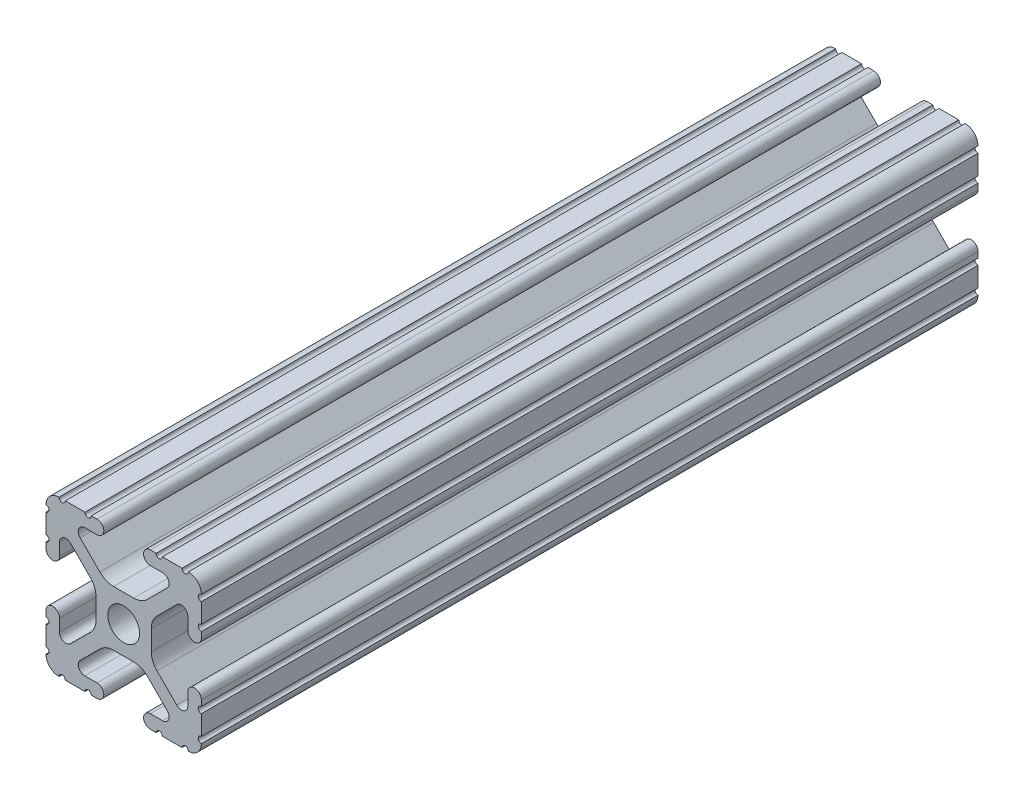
ISO-10303-21;
HEADER;
FILE_DESCRIPTION(('STEP AP214'),'2;1');
FILE_NAME('part.step','',(''),(''),'','','');
FILE_SCHEMA(('AUTOMOTIVE_DESIGN { 1 0 10303 214 1 1 1 1 }'));
ENDSEC;
DATA;
#1=APPLICATION_CONTEXT('core data for automotive mechanical design processes');
#2=APPLICATION_PROTOCOL_DEFINITION('international standard','automotive_design',2000,#1);
#3=PRODUCT_CONTEXT('',#1,'mechanical');
#4=PRODUCT('Part','Part','',(#3));
#5=PRODUCT_RELATED_PRODUCT_CATEGORY('part','',(#4));
#6=PRODUCT_DEFINITION_FORMATION('','',#4);
#7=PRODUCT_DEFINITION_CONTEXT('part definition',#1,'design');
#8=PRODUCT_DEFINITION('design','',#6,#7);
#9=PRODUCT_DEFINITION_SHAPE('','',#8);
#10=(LENGTH_UNIT() NAMED_UNIT(*) SI_UNIT(.MILLI.,.METRE.));
#11=(NAMED_UNIT(*) PLANE_ANGLE_UNIT() SI_UNIT($,.RADIAN.));
#12=(NAMED_UNIT(*) SI_UNIT($,.STERADIAN.) SOLID_ANGLE_UNIT());
#13=UNCERTAINTY_MEASURE_WITH_UNIT(LENGTH_MEASURE(1.E-05),#10,'distance_accuracy_value','');
#14=(GEOMETRIC_REPRESENTATION_CONTEXT(3) GLOBAL_UNCERTAINTY_ASSIGNED_CONTEXT((#13)) GLOBAL_UNIT_ASSIGNED_CONTEXT((#10,
#11,#12)) REPRESENTATION_CONTEXT('',''));
#15=CARTESIAN_POINT('',(0.,0.,0.));
#16=DIRECTION('',(0.,0.,1.));
#17=DIRECTION('',(1.,0.,0.));
#18=AXIS2_PLACEMENT_3D('',#15,#16,#17);
#19=CARTESIAN_POINT('',(10.5918,10.5918,-127.));
#20=DIRECTION('',(0.,0.,1.));
#21=DIRECTION('',(1.,0.,0.));
#22=AXIS2_PLACEMENT_3D('',#19,#20,#21);
#23=CYLINDRICAL_SURFACE('',#22,2.1082);
#24=CARTESIAN_POINT('',(10.5918,10.5918,0.));
#25=DIRECTION('',(0.,0.,1.));
#26=DIRECTION('',(1.,0.,0.));
#27=AXIS2_PLACEMENT_3D('',#24,#25,#26);
#28=CIRCLE('',#27,2.1082);
#29=CARTESIAN_POINT('',(12.7,10.5918,0.));
#30=VERTEX_POINT('',#29);
#31=CARTESIAN_POINT('',(10.5918,12.7,0.));
#32=VERTEX_POINT('',#31);
#33=EDGE_CURVE('E622',#30,#32,#28,.T.);
#34=ORIENTED_EDGE('',*,*,#33,.F.);
#35=DIRECTION('',(0.,0.,1.));
#36=VECTOR('',#35,1.);
#37=CARTESIAN_POINT('',(12.7,10.5918,-127.));
#38=LINE('',#37,#36);
#39=CARTESIAN_POINT('',(12.7,10.5918,-127.));
#40=VERTEX_POINT('',#39);
#41=EDGE_CURVE('E11',#40,#30,#38,.T.);
#42=ORIENTED_EDGE('',*,*,#41,.F.);
#43=CARTESIAN_POINT('',(10.5918,10.5918,-127.));
#44=DIRECTION('',(0.,0.,1.));
#45=DIRECTION('',(1.,0.,0.));
#46=AXIS2_PLACEMENT_3D('',#43,#44,#45);
#47=CIRCLE('',#46,2.1082);
#48=CARTESIAN_POINT('',(10.5918,12.7,-127.));
#49=VERTEX_POINT('',#48);
#50=EDGE_CURVE('E971',#40,#49,#47,.T.);
#51=ORIENTED_EDGE('',*,*,#50,.T.);
#52=DIRECTION('',(0.,0.,1.));
#53=VECTOR('',#52,1.);
#54=CARTESIAN_POINT('',(10.5918,12.7,-127.));
#55=LINE('',#54,#53);
#56=EDGE_CURVE('E42',#49,#32,#55,.T.);
#57=ORIENTED_EDGE('',*,*,#56,.T.);
#58=EDGE_LOOP('',(#34,#42,#51,#57));
#59=FACE_BOUND('',#58,.T.);
#60=ADVANCED_FACE('F39',(#59),#23,.T.);
#61=CARTESIAN_POINT('',(12.7,10.5664,-127.));
#62=DIRECTION('',(1.,0.,0.));
#63=DIRECTION('',(0.,0.,-1.));
#64=AXIS2_PLACEMENT_3D('',#61,#62,#63);
#65=PLANE('',#64);
#66=DIRECTION('',(0.,1.,0.));
#67=VECTOR('',#66,1.);
#68=CARTESIAN_POINT('',(12.7,10.5664,0.));
#69=LINE('',#68,#67);
#70=CARTESIAN_POINT('',(12.7,10.5664,0.));
#71=VERTEX_POINT('',#70);
#72=EDGE_CURVE('E968',#71,#30,#69,.T.);
#73=ORIENTED_EDGE('',*,*,#72,.F.);
#74=DIRECTION('',(0.,0.,1.));
#75=VECTOR('',#74,1.);
#76=CARTESIAN_POINT('',(12.7,10.5664,-127.));
#77=LINE('',#76,#75);
#78=CARTESIAN_POINT('',(12.7,10.5664,-127.));
#79=VERTEX_POINT('',#78);
#80=EDGE_CURVE('E49',#79,#71,#77,.T.);
#81=ORIENTED_EDGE('',*,*,#80,.F.);
#82=DIRECTION('',(0.,1.,0.));
#83=VECTOR('',#82,1.);
#84=CARTESIAN_POINT('',(12.7,10.5664,-127.));
#85=LINE('',#84,#83);
#86=EDGE_CURVE('E608',#79,#40,#85,.T.);
#87=ORIENTED_EDGE('',*,*,#86,.T.);
#88=ORIENTED_EDGE('',*,*,#41,.T.);
#89=EDGE_LOOP('',(#73,#81,#87,#88));
#90=FACE_BOUND('',#89,.T.);
#91=ADVANCED_FACE('F1229',(#90),#65,.T.);
#92=CARTESIAN_POINT('',(12.7,10.0584,-127.));
#93=DIRECTION('',(0.,0.,1.));
#94=DIRECTION('',(1.,0.,0.));
#95=AXIS2_PLACEMENT_3D('',#92,#93,#94);
#96=CYLINDRICAL_SURFACE('',#95,0.508000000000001);
#97=CARTESIAN_POINT('',(12.7,10.0584,0.));
#98=DIRECTION('',(0.,0.,-1.));
#99=DIRECTION('',(1.,0.,0.));
#100=AXIS2_PLACEMENT_3D('',#97,#98,#99);
#101=CIRCLE('',#100,0.508000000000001);
#102=CARTESIAN_POINT('',(12.7,9.55040000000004,0.));
#103=VERTEX_POINT('',#102);
#104=EDGE_CURVE('E594',#103,#71,#101,.T.);
#105=ORIENTED_EDGE('',*,*,#104,.F.);
#106=DIRECTION('',(0.,0.,1.));
#107=VECTOR('',#106,1.);
#108=CARTESIAN_POINT('',(12.7,9.55040000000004,-127.));
#109=LINE('',#108,#107);
#110=CARTESIAN_POINT('',(12.7,9.55040000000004,-127.));
#111=VERTEX_POINT('',#110);
#112=EDGE_CURVE('E589',#111,#103,#109,.T.);
#113=ORIENTED_EDGE('',*,*,#112,.F.);
#114=CARTESIAN_POINT('',(12.7,10.0584,-127.));
#115=DIRECTION('',(0.,0.,-1.));
#116=DIRECTION('',(1.,0.,0.));
#117=AXIS2_PLACEMENT_3D('',#114,#115,#116);
#118=CIRCLE('',#117,0.508000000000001);
#119=EDGE_CURVE('E592',#111,#79,#118,.T.);
#120=ORIENTED_EDGE('',*,*,#119,.T.);
#121=ORIENTED_EDGE('',*,*,#80,.T.);
#122=EDGE_LOOP('',(#105,#113,#120,#121));
#123=FACE_BOUND('',#122,.T.);
#124=ADVANCED_FACE('F591',(#123),#96,.F.);
#125=CARTESIAN_POINT('',(12.7,6.32460000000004,-127.));
#126=DIRECTION('',(1.,0.,0.));
#127=DIRECTION('',(0.,0.,-1.));
#128=AXIS2_PLACEMENT_3D('',#125,#126,#127);
#129=PLANE('',#128);
#130=DIRECTION('',(0.,1.,0.));
#131=VECTOR('',#130,1.);
#132=CARTESIAN_POINT('',(12.7,6.32460000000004,0.));
#133=LINE('',#132,#131);
#134=CARTESIAN_POINT('',(12.7,6.32460000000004,0.));
#135=VERTEX_POINT('',#134);
#136=EDGE_CURVE('E963',#135,#103,#133,.T.);
#137=ORIENTED_EDGE('',*,*,#136,.F.);
#138=DIRECTION('',(0.,0.,1.));
#139=VECTOR('',#138,1.);
#140=CARTESIAN_POINT('',(12.7,6.32460000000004,-127.));
#141=LINE('',#140,#139);
#142=CARTESIAN_POINT('',(12.7,6.32460000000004,-127.));
#143=VERTEX_POINT('',#142);
#144=EDGE_CURVE('E600',#143,#135,#141,.T.);
#145=ORIENTED_EDGE('',*,*,#144,.F.);
#146=DIRECTION('',(0.,1.,0.));
#147=VECTOR('',#146,1.);
#148=CARTESIAN_POINT('',(12.7,6.32460000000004,-127.));
#149=LINE('',#148,#147);
#150=EDGE_CURVE('E606',#143,#111,#149,.T.);
#151=ORIENTED_EDGE('',*,*,#150,.T.);
#152=ORIENTED_EDGE('',*,*,#112,.T.);
#153=EDGE_LOOP('',(#137,#145,#151,#152));
#154=FACE_BOUND('',#153,.T.);
#155=ADVANCED_FACE('F611',(#154),#129,.T.);
#156=CARTESIAN_POINT('',(12.7,5.81660000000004,-127.));
#157=DIRECTION('',(0.,0.,1.));
#158=DIRECTION('',(1.,0.,0.));
#159=AXIS2_PLACEMENT_3D('',#156,#157,#158);
#160=CYLINDRICAL_SURFACE('',#159,0.508);
#161=CARTESIAN_POINT('',(12.7,5.81660000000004,0.));
#162=DIRECTION('',(0.,0.,-1.));
#163=DIRECTION('',(1.,0.,0.));
#164=AXIS2_PLACEMENT_3D('',#161,#162,#163);
#165=CIRCLE('',#164,0.508);
#166=CARTESIAN_POINT('',(12.7,5.30860000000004,0.));
#167=VERTEX_POINT('',#166);
#168=EDGE_CURVE('E959',#167,#135,#165,.T.);
#169=ORIENTED_EDGE('',*,*,#168,.F.);
#170=DIRECTION('',(0.,0.,1.));
#171=VECTOR('',#170,1.);
#172=CARTESIAN_POINT('',(12.7,5.30860000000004,-127.));
#173=LINE('',#172,#171);
#174=CARTESIAN_POINT('',(12.7,5.30860000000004,-127.));
#175=VERTEX_POINT('',#174);
#176=EDGE_CURVE('E977',#175,#167,#173,.T.);
#177=ORIENTED_EDGE('',*,*,#176,.F.);
#178=CARTESIAN_POINT('',(12.7,5.81660000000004,-127.));
#179=DIRECTION('',(0.,0.,-1.));
#180=DIRECTION('',(1.,0.,0.));
#181=AXIS2_PLACEMENT_3D('',#178,#179,#180);
#182=CIRCLE('',#181,0.508);
#183=EDGE_CURVE('E613',#175,#143,#182,.T.);
#184=ORIENTED_EDGE('',*,*,#183,.T.);
#185=ORIENTED_EDGE('',*,*,#144,.T.);
#186=EDGE_LOOP('',(#169,#177,#184,#185));
#187=FACE_BOUND('',#186,.T.);
#188=ADVANCED_FACE('F1242',(#187),#160,.F.);
#189=CARTESIAN_POINT('',(12.7,4.35610000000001,-127.));
#190=DIRECTION('',(1.,0.,0.));
#191=DIRECTION('',(0.,1.,0.));
#192=AXIS2_PLACEMENT_3D('',#189,#190,#191);
#193=PLANE('',#192);
#194=DIRECTION('',(0.,1.,0.));
#195=VECTOR('',#194,1.);
#196=CARTESIAN_POINT('',(12.7,4.35610000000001,0.));
#197=LINE('',#196,#195);
#198=CARTESIAN_POINT('',(12.7,4.35610000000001,0.));
#199=VERTEX_POINT('',#198);
#200=EDGE_CURVE('E955',#199,#167,#197,.T.);
#201=ORIENTED_EDGE('',*,*,#200,.F.);
#202=DIRECTION('',(0.,0.,1.));
#203=VECTOR('',#202,1.);
#204=CARTESIAN_POINT('',(12.7,4.35610000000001,-127.));
#205=LINE('',#204,#203);
#206=CARTESIAN_POINT('',(12.7,4.35610000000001,-127.));
#207=VERTEX_POINT('',#206);
#208=EDGE_CURVE('E980',#207,#199,#205,.T.);
#209=ORIENTED_EDGE('',*,*,#208,.F.);
#210=DIRECTION('',(0.,1.,0.));
#211=VECTOR('',#210,1.);
#212=CARTESIAN_POINT('',(12.7,4.35610000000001,-127.));
#213=LINE('',#212,#211);
#214=EDGE_CURVE('E616',#207,#175,#213,.T.);
#215=ORIENTED_EDGE('',*,*,#214,.T.);
#216=ORIENTED_EDGE('',*,*,#176,.T.);
#217=EDGE_LOOP('',(#201,#209,#215,#216));
#218=FACE_BOUND('',#217,.T.);
#219=ADVANCED_FACE('F1245',(#218),#193,.T.);
#220=CARTESIAN_POINT('',(11.5951,4.35610000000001,-127.));
#221=DIRECTION('',(0.,0.,1.));
#222=DIRECTION('',(1.,0.,0.));
#223=AXIS2_PLACEMENT_3D('',#220,#221,#222);
#224=CYLINDRICAL_SURFACE('',#223,1.1049);
#225=CARTESIAN_POINT('',(11.5951,4.35610000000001,0.));
#226=DIRECTION('',(0.,0.,1.));
#227=DIRECTION('',(1.,0.,0.));
#228=AXIS2_PLACEMENT_3D('',#225,#226,#227);
#229=CIRCLE('',#228,1.1049);
#230=CARTESIAN_POINT('',(10.4902,4.35610000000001,0.));
#231=VERTEX_POINT('',#230);
#232=EDGE_CURVE('E951',#231,#199,#229,.T.);
#233=ORIENTED_EDGE('',*,*,#232,.F.);
#234=DIRECTION('',(0.,0.,1.));
#235=VECTOR('',#234,1.);
#236=CARTESIAN_POINT('',(10.4902,4.35610000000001,-127.));
#237=LINE('',#236,#235);
#238=CARTESIAN_POINT('',(10.4902,4.35610000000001,-127.));
#239=VERTEX_POINT('',#238);
#240=EDGE_CURVE('E983',#239,#231,#237,.T.);
#241=ORIENTED_EDGE('',*,*,#240,.F.);
#242=CARTESIAN_POINT('',(11.5951,4.35610000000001,-127.));
#243=DIRECTION('',(0.,0.,1.));
#244=DIRECTION('',(1.,0.,0.));
#245=AXIS2_PLACEMENT_3D('',#242,#243,#244);
#246=CIRCLE('',#245,1.1049);
#247=EDGE_CURVE('E1924',#239,#207,#246,.T.);
#248=ORIENTED_EDGE('',*,*,#247,.T.);
#249=ORIENTED_EDGE('',*,*,#208,.T.);
#250=EDGE_LOOP('',(#233,#241,#248,#249));
#251=FACE_BOUND('',#250,.T.);
#252=ADVANCED_FACE('F1249',(#251),#224,.T.);
#253=CARTESIAN_POINT('',(10.4902,6.37008378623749,-127.));
#254=DIRECTION('',(-1.,0.,0.));
#255=DIRECTION('',(0.,0.,1.));
#256=AXIS2_PLACEMENT_3D('',#253,#254,#255);
#257=PLANE('',#256);
#258=DIRECTION('',(0.,-1.,0.));
#259=VECTOR('',#258,1.);
#260=CARTESIAN_POINT('',(10.4902,6.37008378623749,0.));
#261=LINE('',#260,#259);
#262=CARTESIAN_POINT('',(10.4902,6.37008378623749,0.));
#263=VERTEX_POINT('',#262);
#264=EDGE_CURVE('E947',#263,#231,#261,.T.);
#265=ORIENTED_EDGE('',*,*,#264,.F.);
#266=DIRECTION('',(0.,0.,1.));
#267=VECTOR('',#266,1.);
#268=CARTESIAN_POINT('',(10.4902,6.37008378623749,-127.));
#269=LINE('',#268,#267);
#270=CARTESIAN_POINT('',(10.4902,6.37008378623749,-127.));
#271=VERTEX_POINT('',#270);
#272=EDGE_CURVE('E986',#271,#263,#269,.T.);
#273=ORIENTED_EDGE('',*,*,#272,.F.);
#274=DIRECTION('',(0.,-1.,0.));
#275=VECTOR('',#274,1.);
#276=CARTESIAN_POINT('',(10.4902,6.37008378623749,-127.));
#277=LINE('',#276,#275);
#278=EDGE_CURVE('E1920',#271,#239,#277,.T.);
#279=ORIENTED_EDGE('',*,*,#278,.T.);
#280=ORIENTED_EDGE('',*,*,#240,.T.);
#281=EDGE_LOOP('',(#265,#273,#279,#280));
#282=FACE_BOUND('',#281,.T.);
#283=ADVANCED_FACE('F1253',(#282),#257,.T.);
#284=CARTESIAN_POINT('',(9.4307837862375,6.37008378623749,-127.));
#285=DIRECTION('',(0.,0.,1.));
#286=DIRECTION('',(1.,0.,0.));
#287=AXIS2_PLACEMENT_3D('',#284,#285,#286);
#288=CYLINDRICAL_SURFACE('',#287,1.0594162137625);
#289=CARTESIAN_POINT('',(9.4307837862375,6.37008378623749,0.));
#290=DIRECTION('',(0.,0.,-1.));
#291=DIRECTION('',(1.,0.,0.));
#292=AXIS2_PLACEMENT_3D('',#289,#290,#291);
#293=CIRCLE('',#292,1.0594162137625);
#294=CARTESIAN_POINT('',(8.68166339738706,7.11920417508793,0.));
#295=VERTEX_POINT('',#294);
#296=EDGE_CURVE('E943',#295,#263,#293,.T.);
#297=ORIENTED_EDGE('',*,*,#296,.F.);
#298=DIRECTION('',(0.,0.,1.));
#299=VECTOR('',#298,1.);
#300=CARTESIAN_POINT('',(8.68166339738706,7.11920417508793,-127.));
#301=LINE('',#300,#299);
#302=CARTESIAN_POINT('',(8.68166339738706,7.11920417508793,-127.));
#303=VERTEX_POINT('',#302);
#304=EDGE_CURVE('E989',#303,#295,#301,.T.);
#305=ORIENTED_EDGE('',*,*,#304,.F.);
#306=CARTESIAN_POINT('',(9.4307837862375,6.37008378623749,-127.));
#307=DIRECTION('',(0.,0.,-1.));
#308=DIRECTION('',(1.,0.,0.));
#309=AXIS2_PLACEMENT_3D('',#306,#307,#308);
#310=CIRCLE('',#309,1.0594162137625);
#311=EDGE_CURVE('E1916',#303,#271,#310,.T.);
#312=ORIENTED_EDGE('',*,*,#311,.T.);
#313=ORIENTED_EDGE('',*,*,#272,.T.);
#314=EDGE_LOOP('',(#297,#305,#312,#313));
#315=FACE_BOUND('',#314,.T.);
#316=ADVANCED_FACE('F1257',(#315),#288,.F.);
#317=CARTESIAN_POINT('',(5.44710311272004,3.88464389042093,-127.));
#318=DIRECTION('',(0.707106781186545,-0.70710678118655,0.));
#319=DIRECTION('',(0.70710678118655,0.707106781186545,0.));
#320=AXIS2_PLACEMENT_3D('',#317,#318,#319);
#321=PLANE('',#320);
#322=DIRECTION('',(0.70710678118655,0.707106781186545,0.));
#323=VECTOR('',#322,1.);
#324=CARTESIAN_POINT('',(5.44710311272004,3.88464389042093,0.));
#325=LINE('',#324,#323);
#326=CARTESIAN_POINT('',(5.44710311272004,3.88464389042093,0.));
#327=VERTEX_POINT('',#326);
#328=EDGE_CURVE('E939',#327,#295,#325,.T.);
#329=ORIENTED_EDGE('',*,*,#328,.F.);
#330=DIRECTION('',(0.,0.,1.));
#331=VECTOR('',#330,1.);
#332=CARTESIAN_POINT('',(5.44710311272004,3.88464389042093,-127.));
#333=LINE('',#332,#331);
#334=CARTESIAN_POINT('',(5.44710311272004,3.88464389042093,-127.));
#335=VERTEX_POINT('',#334);
#336=EDGE_CURVE('E992',#335,#327,#333,.T.);
#337=ORIENTED_EDGE('',*,*,#336,.F.);
#338=DIRECTION('',(0.70710678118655,0.707106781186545,0.));
#339=VECTOR('',#338,1.);
#340=CARTESIAN_POINT('',(5.44710311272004,3.88464389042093,-127.));
#341=LINE('',#340,#339);
#342=EDGE_CURVE('E1912',#335,#303,#341,.T.);
#343=ORIENTED_EDGE('',*,*,#342,.T.);
#344=ORIENTED_EDGE('',*,*,#304,.T.);
#345=EDGE_LOOP('',(#329,#337,#343,#344));
#346=FACE_BOUND('',#345,.T.);
#347=ADVANCED_FACE('F1261',(#346),#321,.T.);
#348=CARTESIAN_POINT('',(7.69216714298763,1.63957986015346,-127.));
#349=DIRECTION('',(0.,0.,1.));
#350=DIRECTION('',(1.,0.,0.));
#351=AXIS2_PLACEMENT_3D('',#348,#349,#350);
#352=CYLINDRICAL_SURFACE('',#351,3.17500000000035);
#353=CARTESIAN_POINT('',(7.69216714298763,1.63957986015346,0.));
#354=DIRECTION('',(0.,0.,-1.));
#355=DIRECTION('',(1.,0.,0.));
#356=AXIS2_PLACEMENT_3D('',#353,#354,#355);
#357=CIRCLE('',#356,3.17500000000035);
#358=CARTESIAN_POINT('',(4.51716714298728,1.63957986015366,0.));
#359=VERTEX_POINT('',#358);
#360=EDGE_CURVE('E935',#359,#327,#357,.T.);
#361=ORIENTED_EDGE('',*,*,#360,.F.);
#362=DIRECTION('',(0.,0.,1.));
#363=VECTOR('',#362,1.);
#364=CARTESIAN_POINT('',(4.51716714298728,1.63957986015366,-127.));
#365=LINE('',#364,#363);
#366=CARTESIAN_POINT('',(4.51716714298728,1.63957986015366,-127.));
#367=VERTEX_POINT('',#366);
#368=EDGE_CURVE('E995',#367,#359,#365,.T.);
#369=ORIENTED_EDGE('',*,*,#368,.F.);
#370=CARTESIAN_POINT('',(7.69216714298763,1.63957986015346,-127.));
#371=DIRECTION('',(0.,0.,-1.));
#372=DIRECTION('',(1.,0.,0.));
#373=AXIS2_PLACEMENT_3D('',#370,#371,#372);
#374=CIRCLE('',#373,3.17500000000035);
#375=EDGE_CURVE('E1908',#367,#335,#374,.T.);
#376=ORIENTED_EDGE('',*,*,#375,.T.);
#377=ORIENTED_EDGE('',*,*,#336,.T.);
#378=EDGE_LOOP('',(#361,#369,#376,#377));
#379=FACE_BOUND('',#378,.T.);
#380=ADVANCED_FACE('F1265',(#379),#352,.F.);
#381=CARTESIAN_POINT('',(4.51716714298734,-1.63957986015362,-127.));
#382=DIRECTION('',(1.,0.,0.));
#383=DIRECTION('',(0.,1.,0.));
#384=AXIS2_PLACEMENT_3D('',#381,#382,#383);
#385=PLANE('',#384);
#386=DIRECTION('',(0.,1.,0.));
#387=VECTOR('',#386,1.);
#388=CARTESIAN_POINT('',(4.51716714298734,-1.63957986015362,0.));
#389=LINE('',#388,#387);
#390=CARTESIAN_POINT('',(4.51716714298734,-1.63957986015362,0.));
#391=VERTEX_POINT('',#390);
#392=EDGE_CURVE('E931',#391,#359,#389,.T.);
#393=ORIENTED_EDGE('',*,*,#392,.F.);
#394=DIRECTION('',(0.,0.,1.));
#395=VECTOR('',#394,1.);
#396=CARTESIAN_POINT('',(4.51716714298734,-1.63957986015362,-127.));
#397=LINE('',#396,#395);
#398=CARTESIAN_POINT('',(4.51716714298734,-1.63957986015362,-127.));
#399=VERTEX_POINT('',#398);
#400=EDGE_CURVE('E998',#399,#391,#397,.T.);
#401=ORIENTED_EDGE('',*,*,#400,.F.);
#402=DIRECTION('',(0.,1.,0.));
#403=VECTOR('',#402,1.);
#404=CARTESIAN_POINT('',(4.51716714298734,-1.63957986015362,-127.));
#405=LINE('',#404,#403);
#406=EDGE_CURVE('E1904',#399,#367,#405,.T.);
#407=ORIENTED_EDGE('',*,*,#406,.T.);
#408=ORIENTED_EDGE('',*,*,#368,.T.);
#409=EDGE_LOOP('',(#393,#401,#407,#408));
#410=FACE_BOUND('',#409,.T.);
#411=ADVANCED_FACE('F1269',(#410),#385,.T.);
#412=CARTESIAN_POINT('',(7.6921671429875,-1.63957986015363,-127.));
#413=DIRECTION('',(0.,0.,1.));
#414=DIRECTION('',(1.,0.,0.));
#415=AXIS2_PLACEMENT_3D('',#412,#413,#414);
#416=CYLINDRICAL_SURFACE('',#415,3.17500000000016);
#417=CARTESIAN_POINT('',(7.6921671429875,-1.63957986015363,0.));
#418=DIRECTION('',(0.,0.,-1.));
#419=DIRECTION('',(1.,0.,0.));
#420=AXIS2_PLACEMENT_3D('',#417,#418,#419);
#421=CIRCLE('',#420,3.17500000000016);
#422=CARTESIAN_POINT('',(5.44710311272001,-3.88464389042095,0.));
#423=VERTEX_POINT('',#422);
#424=EDGE_CURVE('E927',#423,#391,#421,.T.);
#425=ORIENTED_EDGE('',*,*,#424,.F.);
#426=DIRECTION('',(0.,0.,1.));
#427=VECTOR('',#426,1.);
#428=CARTESIAN_POINT('',(5.44710311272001,-3.88464389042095,-127.));
#429=LINE('',#428,#427);
#430=CARTESIAN_POINT('',(5.44710311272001,-3.88464389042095,-127.));
#431=VERTEX_POINT('',#430);
#432=EDGE_CURVE('E1001',#431,#423,#429,.T.);
#433=ORIENTED_EDGE('',*,*,#432,.F.);
#434=CARTESIAN_POINT('',(7.6921671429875,-1.63957986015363,-127.));
#435=DIRECTION('',(0.,0.,-1.));
#436=DIRECTION('',(1.,0.,0.));
#437=AXIS2_PLACEMENT_3D('',#434,#435,#436);
#438=CIRCLE('',#437,3.17500000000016);
#439=EDGE_CURVE('E1900',#431,#399,#438,.T.);
#440=ORIENTED_EDGE('',*,*,#439,.T.);
#441=ORIENTED_EDGE('',*,*,#400,.T.);
#442=EDGE_LOOP('',(#425,#433,#440,#441));
#443=FACE_BOUND('',#442,.T.);
#444=ADVANCED_FACE('F1273',(#443),#416,.F.);
#445=CARTESIAN_POINT('',(8.68166339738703,-7.11920417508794,-127.));
#446=DIRECTION('',(0.707106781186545,0.70710678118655,0.));
#447=DIRECTION('',(-0.70710678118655,0.707106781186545,0.));
#448=AXIS2_PLACEMENT_3D('',#445,#446,#447);
#449=PLANE('',#448);
#450=DIRECTION('',(-0.70710678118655,0.707106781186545,0.));
#451=VECTOR('',#450,1.);
#452=CARTESIAN_POINT('',(8.68166339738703,-7.11920417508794,0.));
#453=LINE('',#452,#451);
#454=CARTESIAN_POINT('',(8.68166339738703,-7.11920417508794,0.));
#455=VERTEX_POINT('',#454);
#456=EDGE_CURVE('E923',#455,#423,#453,.T.);
#457=ORIENTED_EDGE('',*,*,#456,.F.);
#458=DIRECTION('',(0.,0.,1.));
#459=VECTOR('',#458,1.);
#460=CARTESIAN_POINT('',(8.68166339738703,-7.11920417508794,-127.));
#461=LINE('',#460,#459);
#462=CARTESIAN_POINT('',(8.68166339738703,-7.11920417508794,-127.));
#463=VERTEX_POINT('',#462);
#464=EDGE_CURVE('E1004',#463,#455,#461,.T.);
#465=ORIENTED_EDGE('',*,*,#464,.F.);
#466=DIRECTION('',(-0.70710678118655,0.707106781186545,0.));
#467=VECTOR('',#466,1.);
#468=CARTESIAN_POINT('',(8.68166339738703,-7.11920417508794,-127.));
#469=LINE('',#468,#467);
#470=EDGE_CURVE('E1896',#463,#431,#469,.T.);
#471=ORIENTED_EDGE('',*,*,#470,.T.);
#472=ORIENTED_EDGE('',*,*,#432,.T.);
#473=EDGE_LOOP('',(#457,#465,#471,#472));
#474=FACE_BOUND('',#473,.T.);
#475=ADVANCED_FACE('F1277',(#474),#449,.T.);
#476=CARTESIAN_POINT('',(9.43078378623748,-6.37008378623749,-127.));
#477=DIRECTION('',(0.,0.,1.));
#478=DIRECTION('',(1.,0.,0.));
#479=AXIS2_PLACEMENT_3D('',#476,#477,#478);
#480=CYLINDRICAL_SURFACE('',#479,1.05941621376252);
#481=CARTESIAN_POINT('',(9.43078378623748,-6.37008378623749,0.));
#482=DIRECTION('',(0.,0.,-1.));
#483=DIRECTION('',(1.,0.,0.));
#484=AXIS2_PLACEMENT_3D('',#481,#482,#483);
#485=CIRCLE('',#484,1.05941621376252);
#486=CARTESIAN_POINT('',(10.4902,-6.37008378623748,0.));
#487=VERTEX_POINT('',#486);
#488=EDGE_CURVE('E919',#487,#455,#485,.T.);
#489=ORIENTED_EDGE('',*,*,#488,.F.);
#490=DIRECTION('',(0.,0.,1.));
#491=VECTOR('',#490,1.);
#492=CARTESIAN_POINT('',(10.4902,-6.37008378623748,-127.));
#493=LINE('',#492,#491);
#494=CARTESIAN_POINT('',(10.4902,-6.37008378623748,-127.));
#495=VERTEX_POINT('',#494);
#496=EDGE_CURVE('E1007',#495,#487,#493,.T.);
#497=ORIENTED_EDGE('',*,*,#496,.F.);
#498=CARTESIAN_POINT('',(9.43078378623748,-6.37008378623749,-127.));
#499=DIRECTION('',(0.,0.,-1.));
#500=DIRECTION('',(1.,0.,0.));
#501=AXIS2_PLACEMENT_3D('',#498,#499,#500);
#502=CIRCLE('',#501,1.05941621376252);
#503=EDGE_CURVE('E1892',#495,#463,#502,.T.);
#504=ORIENTED_EDGE('',*,*,#503,.T.);
#505=ORIENTED_EDGE('',*,*,#464,.T.);
#506=EDGE_LOOP('',(#489,#497,#504,#505));
#507=FACE_BOUND('',#506,.T.);
#508=ADVANCED_FACE('F1281',(#507),#480,.F.);
#509=CARTESIAN_POINT('',(10.4902,-4.3561,-127.));
#510=DIRECTION('',(-1.,0.,0.));
#511=DIRECTION('',(0.,-1.,0.));
#512=AXIS2_PLACEMENT_3D('',#509,#510,#511);
#513=PLANE('',#512);
#514=DIRECTION('',(0.,-1.,0.));
#515=VECTOR('',#514,1.);
#516=CARTESIAN_POINT('',(10.4902,-4.3561,0.));
#517=LINE('',#516,#515);
#518=CARTESIAN_POINT('',(10.4902,-4.3561,0.));
#519=VERTEX_POINT('',#518);
#520=EDGE_CURVE('E915',#519,#487,#517,.T.);
#521=ORIENTED_EDGE('',*,*,#520,.F.);
#522=DIRECTION('',(0.,0.,1.));
#523=VECTOR('',#522,1.);
#524=CARTESIAN_POINT('',(10.4902,-4.3561,-127.));
#525=LINE('',#524,#523);
#526=CARTESIAN_POINT('',(10.4902,-4.3561,-127.));
#527=VERTEX_POINT('',#526);
#528=EDGE_CURVE('E1010',#527,#519,#525,.T.);
#529=ORIENTED_EDGE('',*,*,#528,.F.);
#530=DIRECTION('',(0.,-1.,0.));
#531=VECTOR('',#530,1.);
#532=CARTESIAN_POINT('',(10.4902,-4.3561,-127.));
#533=LINE('',#532,#531);
#534=EDGE_CURVE('E1888',#527,#495,#533,.T.);
#535=ORIENTED_EDGE('',*,*,#534,.T.);
#536=ORIENTED_EDGE('',*,*,#496,.T.);
#537=EDGE_LOOP('',(#521,#529,#535,#536));
#538=FACE_BOUND('',#537,.T.);
#539=ADVANCED_FACE('F1285',(#538),#513,.T.);
#540=CARTESIAN_POINT('',(11.5951,-4.3561,-127.));
#541=DIRECTION('',(0.,0.,1.));
#542=DIRECTION('',(1.,0.,0.));
#543=AXIS2_PLACEMENT_3D('',#540,#541,#542);
#544=CYLINDRICAL_SURFACE('',#543,1.1049);
#545=CARTESIAN_POINT('',(11.5951,-4.3561,0.));
#546=DIRECTION('',(0.,0.,1.));
#547=DIRECTION('',(1.,0.,0.));
#548=AXIS2_PLACEMENT_3D('',#545,#546,#547);
#549=CIRCLE('',#548,1.1049);
#550=CARTESIAN_POINT('',(12.7,-4.3561,0.));
#551=VERTEX_POINT('',#550);
#552=EDGE_CURVE('E911',#551,#519,#549,.T.);
#553=ORIENTED_EDGE('',*,*,#552,.F.);
#554=DIRECTION('',(0.,0.,1.));
#555=VECTOR('',#554,1.);
#556=CARTESIAN_POINT('',(12.7,-4.3561,-127.));
#557=LINE('',#556,#555);
#558=CARTESIAN_POINT('',(12.7,-4.3561,-127.));
#559=VERTEX_POINT('',#558);
#560=EDGE_CURVE('E1013',#559,#551,#557,.T.);
#561=ORIENTED_EDGE('',*,*,#560,.F.);
#562=CARTESIAN_POINT('',(11.5951,-4.3561,-127.));
#563=DIRECTION('',(0.,0.,1.));
#564=DIRECTION('',(1.,0.,0.));
#565=AXIS2_PLACEMENT_3D('',#562,#563,#564);
#566=CIRCLE('',#565,1.1049);
#567=EDGE_CURVE('E1884',#559,#527,#566,.T.);
#568=ORIENTED_EDGE('',*,*,#567,.T.);
#569=ORIENTED_EDGE('',*,*,#528,.T.);
#570=EDGE_LOOP('',(#553,#561,#568,#569));
#571=FACE_BOUND('',#570,.T.);
#572=ADVANCED_FACE('F1289',(#571),#544,.T.);
#573=CARTESIAN_POINT('',(12.7,-5.30860000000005,-127.));
#574=DIRECTION('',(1.,0.,0.));
#575=DIRECTION('',(0.,1.,0.));
#576=AXIS2_PLACEMENT_3D('',#573,#574,#575);
#577=PLANE('',#576);
#578=DIRECTION('',(0.,1.,0.));
#579=VECTOR('',#578,1.);
#580=CARTESIAN_POINT('',(12.7,-5.30860000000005,0.));
#581=LINE('',#580,#579);
#582=CARTESIAN_POINT('',(12.7,-5.30860000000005,0.));
#583=VERTEX_POINT('',#582);
#584=EDGE_CURVE('E907',#583,#551,#581,.T.);
#585=ORIENTED_EDGE('',*,*,#584,.F.);
#586=DIRECTION('',(0.,0.,1.));
#587=VECTOR('',#586,1.);
#588=CARTESIAN_POINT('',(12.7,-5.30860000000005,-127.));
#589=LINE('',#588,#587);
#590=CARTESIAN_POINT('',(12.7,-5.30860000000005,-127.));
#591=VERTEX_POINT('',#590);
#592=EDGE_CURVE('E1016',#591,#583,#589,.T.);
#593=ORIENTED_EDGE('',*,*,#592,.F.);
#594=DIRECTION('',(0.,1.,0.));
#595=VECTOR('',#594,1.);
#596=CARTESIAN_POINT('',(12.7,-5.30860000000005,-127.));
#597=LINE('',#596,#595);
#598=EDGE_CURVE('E1880',#591,#559,#597,.T.);
#599=ORIENTED_EDGE('',*,*,#598,.T.);
#600=ORIENTED_EDGE('',*,*,#560,.T.);
#601=EDGE_LOOP('',(#585,#593,#599,#600));
#602=FACE_BOUND('',#601,.T.);
#603=ADVANCED_FACE('F1293',(#602),#577,.T.);
#604=CARTESIAN_POINT('',(12.7,-5.81660000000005,-127.));
#605=DIRECTION('',(0.,0.,1.));
#606=DIRECTION('',(1.,0.,0.));
#607=AXIS2_PLACEMENT_3D('',#604,#605,#606);
#608=CYLINDRICAL_SURFACE('',#607,0.508000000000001);
#609=CARTESIAN_POINT('',(12.7,-5.81660000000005,0.));
#610=DIRECTION('',(0.,0.,-1.));
#611=DIRECTION('',(1.,0.,0.));
#612=AXIS2_PLACEMENT_3D('',#609,#610,#611);
#613=CIRCLE('',#612,0.508000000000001);
#614=CARTESIAN_POINT('',(12.7,-6.32460000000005,0.));
#615=VERTEX_POINT('',#614);
#616=EDGE_CURVE('E903',#615,#583,#613,.T.);
#617=ORIENTED_EDGE('',*,*,#616,.F.);
#618=DIRECTION('',(0.,0.,1.));
#619=VECTOR('',#618,1.);
#620=CARTESIAN_POINT('',(12.7,-6.32460000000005,-127.));
#621=LINE('',#620,#619);
#622=CARTESIAN_POINT('',(12.7,-6.32460000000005,-127.));
#623=VERTEX_POINT('',#622);
#624=EDGE_CURVE('E1019',#623,#615,#621,.T.);
#625=ORIENTED_EDGE('',*,*,#624,.F.);
#626=CARTESIAN_POINT('',(12.7,-5.81660000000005,-127.));
#627=DIRECTION('',(0.,0.,-1.));
#628=DIRECTION('',(1.,0.,0.));
#629=AXIS2_PLACEMENT_3D('',#626,#627,#628);
#630=CIRCLE('',#629,0.508000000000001);
#631=EDGE_CURVE('E1876',#623,#591,#630,.T.);
#632=ORIENTED_EDGE('',*,*,#631,.T.);
#633=ORIENTED_EDGE('',*,*,#592,.T.);
#634=EDGE_LOOP('',(#617,#625,#632,#633));
#635=FACE_BOUND('',#634,.T.);
#636=ADVANCED_FACE('F1297',(#635),#608,.F.);
#637=CARTESIAN_POINT('',(12.7,-9.55040000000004,-127.));
#638=DIRECTION('',(1.,0.,0.));
#639=DIRECTION('',(0.,0.,-1.));
#640=AXIS2_PLACEMENT_3D('',#637,#638,#639);
#641=PLANE('',#640);
#642=DIRECTION('',(0.,1.,0.));
#643=VECTOR('',#642,1.);
#644=CARTESIAN_POINT('',(12.7,-9.55040000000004,0.));
#645=LINE('',#644,#643);
#646=CARTESIAN_POINT('',(12.7,-9.55040000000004,0.));
#647=VERTEX_POINT('',#646);
#648=EDGE_CURVE('E899',#647,#615,#645,.T.);
#649=ORIENTED_EDGE('',*,*,#648,.F.);
#650=DIRECTION('',(0.,0.,1.));
#651=VECTOR('',#650,1.);
#652=CARTESIAN_POINT('',(12.7,-9.55040000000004,-127.));
#653=LINE('',#652,#651);
#654=CARTESIAN_POINT('',(12.7,-9.55040000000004,-127.));
#655=VERTEX_POINT('',#654);
#656=EDGE_CURVE('E1022',#655,#647,#653,.T.);
#657=ORIENTED_EDGE('',*,*,#656,.F.);
#658=DIRECTION('',(0.,1.,0.));
#659=VECTOR('',#658,1.);
#660=CARTESIAN_POINT('',(12.7,-9.55040000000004,-127.));
#661=LINE('',#660,#659);
#662=EDGE_CURVE('E1872',#655,#623,#661,.T.);
#663=ORIENTED_EDGE('',*,*,#662,.T.);
#664=ORIENTED_EDGE('',*,*,#624,.T.);
#665=EDGE_LOOP('',(#649,#657,#663,#664));
#666=FACE_BOUND('',#665,.T.);
#667=ADVANCED_FACE('F1301',(#666),#641,.T.);
#668=CARTESIAN_POINT('',(12.7,-10.0584,-127.));
#669=DIRECTION('',(0.,0.,1.));
#670=DIRECTION('',(1.,0.,0.));
#671=AXIS2_PLACEMENT_3D('',#668,#669,#670);
#672=CYLINDRICAL_SURFACE('',#671,0.508);
#673=CARTESIAN_POINT('',(12.7,-10.0584,0.));
#674=DIRECTION('',(0.,0.,-1.));
#675=DIRECTION('',(1.,0.,0.));
#676=AXIS2_PLACEMENT_3D('',#673,#674,#675);
#677=CIRCLE('',#676,0.508);
#678=CARTESIAN_POINT('',(12.7,-10.5664,0.));
#679=VERTEX_POINT('',#678);
#680=EDGE_CURVE('E895',#679,#647,#677,.T.);
#681=ORIENTED_EDGE('',*,*,#680,.F.);
#682=DIRECTION('',(0.,0.,1.));
#683=VECTOR('',#682,1.);
#684=CARTESIAN_POINT('',(12.7,-10.5664,-127.));
#685=LINE('',#684,#683);
#686=CARTESIAN_POINT('',(12.7,-10.5664,-127.));
#687=VERTEX_POINT('',#686);
#688=EDGE_CURVE('E1025',#687,#679,#685,.T.);
#689=ORIENTED_EDGE('',*,*,#688,.F.);
#690=CARTESIAN_POINT('',(12.7,-10.0584,-127.));
#691=DIRECTION('',(0.,0.,-1.));
#692=DIRECTION('',(1.,0.,0.));
#693=AXIS2_PLACEMENT_3D('',#690,#691,#692);
#694=CIRCLE('',#693,0.508);
#695=EDGE_CURVE('E1868',#687,#655,#694,.T.);
#696=ORIENTED_EDGE('',*,*,#695,.T.);
#697=ORIENTED_EDGE('',*,*,#656,.T.);
#698=EDGE_LOOP('',(#681,#689,#696,#697));
#699=FACE_BOUND('',#698,.T.);
#700=ADVANCED_FACE('F1305',(#699),#672,.F.);
#701=CARTESIAN_POINT('',(12.7,-10.5918,-127.));
#702=DIRECTION('',(1.,0.,0.));
#703=DIRECTION('',(0.,0.,-1.));
#704=AXIS2_PLACEMENT_3D('',#701,#702,#703);
#705=PLANE('',#704);
#706=DIRECTION('',(0.,1.,0.));
#707=VECTOR('',#706,1.);
#708=CARTESIAN_POINT('',(12.7,-10.5918,0.));
#709=LINE('',#708,#707);
#710=CARTESIAN_POINT('',(12.7,-10.5918,0.));
#711=VERTEX_POINT('',#710);
#712=EDGE_CURVE('E891',#711,#679,#709,.T.);
#713=ORIENTED_EDGE('',*,*,#712,.F.);
#714=DIRECTION('',(0.,0.,1.));
#715=VECTOR('',#714,1.);
#716=CARTESIAN_POINT('',(12.7,-10.5918,-127.));
#717=LINE('',#716,#715);
#718=CARTESIAN_POINT('',(12.7,-10.5918,-127.));
#719=VERTEX_POINT('',#718);
#720=EDGE_CURVE('E1028',#719,#711,#717,.T.);
#721=ORIENTED_EDGE('',*,*,#720,.F.);
#722=DIRECTION('',(0.,1.,0.));
#723=VECTOR('',#722,1.);
#724=CARTESIAN_POINT('',(12.7,-10.5918,-127.));
#725=LINE('',#724,#723);
#726=EDGE_CURVE('E1864',#719,#687,#725,.T.);
#727=ORIENTED_EDGE('',*,*,#726,.T.);
#728=ORIENTED_EDGE('',*,*,#688,.T.);
#729=EDGE_LOOP('',(#713,#721,#727,#728));
#730=FACE_BOUND('',#729,.T.);
#731=ADVANCED_FACE('F1309',(#730),#705,.T.);
#732=CARTESIAN_POINT('',(10.5918,-10.5918,-127.));
#733=DIRECTION('',(0.,0.,1.));
#734=DIRECTION('',(1.,0.,0.));
#735=AXIS2_PLACEMENT_3D('',#732,#733,#734);
#736=CYLINDRICAL_SURFACE('',#735,2.1082);
#737=CARTESIAN_POINT('',(10.5918,-10.5918,0.));
#738=DIRECTION('',(0.,0.,1.));
#739=DIRECTION('',(1.,0.,0.));
#740=AXIS2_PLACEMENT_3D('',#737,#738,#739);
#741=CIRCLE('',#740,2.1082);
#742=CARTESIAN_POINT('',(10.5918,-12.7,0.));
#743=VERTEX_POINT('',#742);
#744=EDGE_CURVE('E887',#743,#711,#741,.T.);
#745=ORIENTED_EDGE('',*,*,#744,.F.);
#746=DIRECTION('',(0.,0.,1.));
#747=VECTOR('',#746,1.);
#748=CARTESIAN_POINT('',(10.5918,-12.7,-127.));
#749=LINE('',#748,#747);
#750=CARTESIAN_POINT('',(10.5918,-12.7,-127.));
#751=VERTEX_POINT('',#750);
#752=EDGE_CURVE('E1031',#751,#743,#749,.T.);
#753=ORIENTED_EDGE('',*,*,#752,.F.);
#754=CARTESIAN_POINT('',(10.5918,-10.5918,-127.));
#755=DIRECTION('',(0.,0.,1.));
#756=DIRECTION('',(1.,0.,0.));
#757=AXIS2_PLACEMENT_3D('',#754,#755,#756);
#758=CIRCLE('',#757,2.1082);
#759=EDGE_CURVE('E1860',#751,#719,#758,.T.);
#760=ORIENTED_EDGE('',*,*,#759,.T.);
#761=ORIENTED_EDGE('',*,*,#720,.T.);
#762=EDGE_LOOP('',(#745,#753,#760,#761));
#763=FACE_BOUND('',#762,.T.);
#764=ADVANCED_FACE('F1313',(#763),#736,.T.);
#765=CARTESIAN_POINT('',(10.5664,-12.7,-127.));
#766=DIRECTION('',(6.14665798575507E-13,-1.,0.));
#767=DIRECTION('',(1.,6.14665798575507E-13,0.));
#768=AXIS2_PLACEMENT_3D('',#765,#766,#767);
#769=PLANE('',#768);
#770=DIRECTION('',(1.,6.14665798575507E-13,0.));
#771=VECTOR('',#770,1.);
#772=CARTESIAN_POINT('',(10.5664,-12.7,0.));
#773=LINE('',#772,#771);
#774=CARTESIAN_POINT('',(10.5664,-12.7,0.));
#775=VERTEX_POINT('',#774);
#776=EDGE_CURVE('E883',#775,#743,#773,.T.);
#777=ORIENTED_EDGE('',*,*,#776,.F.);
#778=DIRECTION('',(0.,0.,1.));
#779=VECTOR('',#778,1.);
#780=CARTESIAN_POINT('',(10.5664,-12.7,-127.));
#781=LINE('',#780,#779);
#782=CARTESIAN_POINT('',(10.5664,-12.7,-127.));
#783=VERTEX_POINT('',#782);
#784=EDGE_CURVE('E1034',#783,#775,#781,.T.);
#785=ORIENTED_EDGE('',*,*,#784,.F.);
#786=DIRECTION('',(1.,6.14665798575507E-13,0.));
#787=VECTOR('',#786,1.);
#788=CARTESIAN_POINT('',(10.5664,-12.7,-127.));
#789=LINE('',#788,#787);
#790=EDGE_CURVE('E1856',#783,#751,#789,.T.);
#791=ORIENTED_EDGE('',*,*,#790,.T.);
#792=ORIENTED_EDGE('',*,*,#752,.T.);
#793=EDGE_LOOP('',(#777,#785,#791,#792));
#794=FACE_BOUND('',#793,.T.);
#795=ADVANCED_FACE('F1317',(#794),#769,.T.);
#796=CARTESIAN_POINT('',(10.0584,-12.7,-127.));
#797=DIRECTION('',(0.,0.,1.));
#798=DIRECTION('',(1.,0.,0.));
#799=AXIS2_PLACEMENT_3D('',#796,#797,#798);
#800=CYLINDRICAL_SURFACE('',#799,0.508000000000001);
#801=CARTESIAN_POINT('',(10.0584,-12.7,0.));
#802=DIRECTION('',(0.,0.,-1.));
#803=DIRECTION('',(1.,0.,0.));
#804=AXIS2_PLACEMENT_3D('',#801,#802,#803);
#805=CIRCLE('',#804,0.508000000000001);
#806=CARTESIAN_POINT('',(9.55040000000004,-12.7,0.));
#807=VERTEX_POINT('',#806);
#808=EDGE_CURVE('E879',#807,#775,#805,.T.);
#809=ORIENTED_EDGE('',*,*,#808,.F.);
#810=DIRECTION('',(0.,0.,1.));
#811=VECTOR('',#810,1.);
#812=CARTESIAN_POINT('',(9.55040000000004,-12.7,-127.));
#813=LINE('',#812,#811);
#814=CARTESIAN_POINT('',(9.55040000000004,-12.7,-127.));
#815=VERTEX_POINT('',#814);
#816=EDGE_CURVE('E1037',#815,#807,#813,.T.);
#817=ORIENTED_EDGE('',*,*,#816,.F.);
#818=CARTESIAN_POINT('',(10.0584,-12.7,-127.));
#819=DIRECTION('',(0.,0.,-1.));
#820=DIRECTION('',(1.,0.,0.));
#821=AXIS2_PLACEMENT_3D('',#818,#819,#820);
#822=CIRCLE('',#821,0.508000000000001);
#823=EDGE_CURVE('E1852',#815,#783,#822,.T.);
#824=ORIENTED_EDGE('',*,*,#823,.T.);
#825=ORIENTED_EDGE('',*,*,#784,.T.);
#826=EDGE_LOOP('',(#809,#817,#824,#825));
#827=FACE_BOUND('',#826,.T.);
#828=ADVANCED_FACE('F1321',(#827),#800,.F.);
#829=CARTESIAN_POINT('',(6.32460000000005,-12.7,-127.));
#830=DIRECTION('',(0.,-1.,0.));
#831=DIRECTION('',(0.,0.,-1.));
#832=AXIS2_PLACEMENT_3D('',#829,#830,#831);
#833=PLANE('',#832);
#834=DIRECTION('',(1.,0.,0.));
#835=VECTOR('',#834,1.);
#836=CARTESIAN_POINT('',(6.32460000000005,-12.7,0.));
#837=LINE('',#836,#835);
#838=CARTESIAN_POINT('',(6.32460000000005,-12.7,0.));
#839=VERTEX_POINT('',#838);
#840=EDGE_CURVE('E875',#839,#807,#837,.T.);
#841=ORIENTED_EDGE('',*,*,#840,.F.);
#842=DIRECTION('',(0.,0.,1.));
#843=VECTOR('',#842,1.);
#844=CARTESIAN_POINT('',(6.32460000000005,-12.7,-127.));
#845=LINE('',#844,#843);
#846=CARTESIAN_POINT('',(6.32460000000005,-12.7,-127.));
#847=VERTEX_POINT('',#846);
#848=EDGE_CURVE('E1040',#847,#839,#845,.T.);
#849=ORIENTED_EDGE('',*,*,#848,.F.);
#850=DIRECTION('',(1.,0.,0.));
#851=VECTOR('',#850,1.);
#852=CARTESIAN_POINT('',(6.32460000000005,-12.7,-127.));
#853=LINE('',#852,#851);
#854=EDGE_CURVE('E1848',#847,#815,#853,.T.);
#855=ORIENTED_EDGE('',*,*,#854,.T.);
#856=ORIENTED_EDGE('',*,*,#816,.T.);
#857=EDGE_LOOP('',(#841,#849,#855,#856));
#858=FACE_BOUND('',#857,.T.);
#859=ADVANCED_FACE('F1325',(#858),#833,.T.);
#860=CARTESIAN_POINT('',(5.81660000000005,-12.7,-127.));
#861=DIRECTION('',(0.,0.,1.));
#862=DIRECTION('',(1.,0.,0.));
#863=AXIS2_PLACEMENT_3D('',#860,#861,#862);
#864=CYLINDRICAL_SURFACE('',#863,0.508);
#865=CARTESIAN_POINT('',(5.81660000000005,-12.7,0.));
#866=DIRECTION('',(0.,0.,-1.));
#867=DIRECTION('',(1.,0.,0.));
#868=AXIS2_PLACEMENT_3D('',#865,#866,#867);
#869=CIRCLE('',#868,0.508);
#870=CARTESIAN_POINT('',(5.30860000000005,-12.7,0.));
#871=VERTEX_POINT('',#870);
#872=EDGE_CURVE('E871',#871,#839,#869,.T.);
#873=ORIENTED_EDGE('',*,*,#872,.F.);
#874=DIRECTION('',(0.,0.,1.));
#875=VECTOR('',#874,1.);
#876=CARTESIAN_POINT('',(5.30860000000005,-12.7,-127.));
#877=LINE('',#876,#875);
#878=CARTESIAN_POINT('',(5.30860000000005,-12.7,-127.));
#879=VERTEX_POINT('',#878);
#880=EDGE_CURVE('E1043',#879,#871,#877,.T.);
#881=ORIENTED_EDGE('',*,*,#880,.F.);
#882=CARTESIAN_POINT('',(5.81660000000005,-12.7,-127.));
#883=DIRECTION('',(0.,0.,-1.));
#884=DIRECTION('',(1.,0.,0.));
#885=AXIS2_PLACEMENT_3D('',#882,#883,#884);
#886=CIRCLE('',#885,0.508);
#887=EDGE_CURVE('E1844',#879,#847,#886,.T.);
#888=ORIENTED_EDGE('',*,*,#887,.T.);
#889=ORIENTED_EDGE('',*,*,#848,.T.);
#890=EDGE_LOOP('',(#873,#881,#888,#889));
#891=FACE_BOUND('',#890,.T.);
#892=ADVANCED_FACE('F1329',(#891),#864,.F.);
#893=CARTESIAN_POINT('',(4.3561,-12.7,-127.));
#894=DIRECTION('',(0.,-1.,0.));
#895=DIRECTION('',(1.,0.,0.));
#896=AXIS2_PLACEMENT_3D('',#893,#894,#895);
#897=PLANE('',#896);
#898=DIRECTION('',(1.,0.,0.));
#899=VECTOR('',#898,1.);
#900=CARTESIAN_POINT('',(4.3561,-12.7,0.));
#901=LINE('',#900,#899);
#902=CARTESIAN_POINT('',(4.3561,-12.7,0.));
#903=VERTEX_POINT('',#902);
#904=EDGE_CURVE('E867',#903,#871,#901,.T.);
#905=ORIENTED_EDGE('',*,*,#904,.F.);
#906=DIRECTION('',(0.,0.,1.));
#907=VECTOR('',#906,1.);
#908=CARTESIAN_POINT('',(4.3561,-12.7,-127.));
#909=LINE('',#908,#907);
#910=CARTESIAN_POINT('',(4.3561,-12.7,-127.));
#911=VERTEX_POINT('',#910);
#912=EDGE_CURVE('E1046',#911,#903,#909,.T.);
#913=ORIENTED_EDGE('',*,*,#912,.F.);
#914=DIRECTION('',(1.,0.,0.));
#915=VECTOR('',#914,1.);
#916=CARTESIAN_POINT('',(4.3561,-12.7,-127.));
#917=LINE('',#916,#915);
#918=EDGE_CURVE('E1840',#911,#879,#917,.T.);
#919=ORIENTED_EDGE('',*,*,#918,.T.);
#920=ORIENTED_EDGE('',*,*,#880,.T.);
#921=EDGE_LOOP('',(#905,#913,#919,#920));
#922=FACE_BOUND('',#921,.T.);
#923=ADVANCED_FACE('F1333',(#922),#897,.T.);
#924=CARTESIAN_POINT('',(4.35610000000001,-11.5951,-127.));
#925=DIRECTION('',(0.,0.,1.));
#926=DIRECTION('',(1.,0.,0.));
#927=AXIS2_PLACEMENT_3D('',#924,#925,#926);
#928=CYLINDRICAL_SURFACE('',#927,1.1049);
#929=CARTESIAN_POINT('',(4.35610000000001,-11.5951,0.));
#930=DIRECTION('',(0.,0.,1.));
#931=DIRECTION('',(1.,0.,0.));
#932=AXIS2_PLACEMENT_3D('',#929,#930,#931);
#933=CIRCLE('',#932,1.1049);
#934=CARTESIAN_POINT('',(4.3561,-10.4902,0.));
#935=VERTEX_POINT('',#934);
#936=EDGE_CURVE('E863',#935,#903,#933,.T.);
#937=ORIENTED_EDGE('',*,*,#936,.F.);
#938=DIRECTION('',(0.,0.,1.));
#939=VECTOR('',#938,1.);
#940=CARTESIAN_POINT('',(4.3561,-10.4902,-127.));
#941=LINE('',#940,#939);
#942=CARTESIAN_POINT('',(4.3561,-10.4902,-127.));
#943=VERTEX_POINT('',#942);
#944=EDGE_CURVE('E1049',#943,#935,#941,.T.);
#945=ORIENTED_EDGE('',*,*,#944,.F.);
#946=CARTESIAN_POINT('',(4.35610000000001,-11.5951,-127.));
#947=DIRECTION('',(0.,0.,1.));
#948=DIRECTION('',(1.,0.,0.));
#949=AXIS2_PLACEMENT_3D('',#946,#947,#948);
#950=CIRCLE('',#949,1.1049);
#951=EDGE_CURVE('E1836',#943,#911,#950,.T.);
#952=ORIENTED_EDGE('',*,*,#951,.T.);
#953=ORIENTED_EDGE('',*,*,#912,.T.);
#954=EDGE_LOOP('',(#937,#945,#952,#953));
#955=FACE_BOUND('',#954,.T.);
#956=ADVANCED_FACE('F1337',(#955),#928,.T.);
#957=CARTESIAN_POINT('',(6.37008378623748,-10.4902,-127.));
#958=DIRECTION('',(0.,1.,0.));
#959=DIRECTION('',(-1.,0.,0.));
#960=AXIS2_PLACEMENT_3D('',#957,#958,#959);
#961=PLANE('',#960);
#962=DIRECTION('',(-1.,0.,0.));
#963=VECTOR('',#962,1.);
#964=CARTESIAN_POINT('',(6.37008378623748,-10.4902,0.));
#965=LINE('',#964,#963);
#966=CARTESIAN_POINT('',(6.37008378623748,-10.4902,0.));
#967=VERTEX_POINT('',#966);
#968=EDGE_CURVE('E859',#967,#935,#965,.T.);
#969=ORIENTED_EDGE('',*,*,#968,.F.);
#970=DIRECTION('',(0.,0.,1.));
#971=VECTOR('',#970,1.);
#972=CARTESIAN_POINT('',(6.37008378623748,-10.4902,-127.));
#973=LINE('',#972,#971);
#974=CARTESIAN_POINT('',(6.37008378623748,-10.4902,-127.));
#975=VERTEX_POINT('',#974);
#976=EDGE_CURVE('E1052',#975,#967,#973,.T.);
#977=ORIENTED_EDGE('',*,*,#976,.F.);
#978=DIRECTION('',(-1.,0.,0.));
#979=VECTOR('',#978,1.);
#980=CARTESIAN_POINT('',(6.37008378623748,-10.4902,-127.));
#981=LINE('',#980,#979);
#982=EDGE_CURVE('E1832',#975,#943,#981,.T.);
#983=ORIENTED_EDGE('',*,*,#982,.T.);
#984=ORIENTED_EDGE('',*,*,#944,.T.);
#985=EDGE_LOOP('',(#969,#977,#983,#984));
#986=FACE_BOUND('',#985,.T.);
#987=ADVANCED_FACE('F1341',(#986),#961,.T.);
#988=CARTESIAN_POINT('',(6.37008378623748,-9.43078378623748,-127.));
#989=DIRECTION('',(0.,0.,1.));
#990=DIRECTION('',(1.,0.,0.));
#991=AXIS2_PLACEMENT_3D('',#988,#989,#990);
#992=CYLINDRICAL_SURFACE('',#991,1.05941621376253);
#993=CARTESIAN_POINT('',(6.37008378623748,-9.43078378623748,0.));
#994=DIRECTION('',(0.,0.,-1.));
#995=DIRECTION('',(1.,0.,0.));
#996=AXIS2_PLACEMENT_3D('',#993,#994,#995);
#997=CIRCLE('',#996,1.05941621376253);
#998=CARTESIAN_POINT('',(7.11920417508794,-8.68166339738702,0.));
#999=VERTEX_POINT('',#998);
#1000=EDGE_CURVE('E855',#999,#967,#997,.T.);
#1001=ORIENTED_EDGE('',*,*,#1000,.F.);
#1002=DIRECTION('',(0.,0.,1.));
#1003=VECTOR('',#1002,1.);
#1004=CARTESIAN_POINT('',(7.11920417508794,-8.68166339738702,-127.));
#1005=LINE('',#1004,#1003);
#1006=CARTESIAN_POINT('',(7.11920417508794,-8.68166339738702,-127.));
#1007=VERTEX_POINT('',#1006);
#1008=EDGE_CURVE('E1055',#1007,#999,#1005,.T.);
#1009=ORIENTED_EDGE('',*,*,#1008,.F.);
#1010=CARTESIAN_POINT('',(6.37008378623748,-9.43078378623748,-127.));
#1011=DIRECTION('',(0.,0.,-1.));
#1012=DIRECTION('',(1.,0.,0.));
#1013=AXIS2_PLACEMENT_3D('',#1010,#1011,#1012);
#1014=CIRCLE('',#1013,1.05941621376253);
#1015=EDGE_CURVE('E1828',#1007,#975,#1014,.T.);
#1016=ORIENTED_EDGE('',*,*,#1015,.T.);
#1017=ORIENTED_EDGE('',*,*,#976,.T.);
#1018=EDGE_LOOP('',(#1001,#1009,#1016,#1017));
#1019=FACE_BOUND('',#1018,.T.);
#1020=ADVANCED_FACE('F1345',(#1019),#992,.F.);
#1021=CARTESIAN_POINT('',(3.88464389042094,-5.44710311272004,-127.));
#1022=DIRECTION('',(-0.707106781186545,-0.70710678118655,0.));
#1023=DIRECTION('',(0.70710678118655,-0.707106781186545,0.));
#1024=AXIS2_PLACEMENT_3D('',#1021,#1022,#1023);
#1025=PLANE('',#1024);
#1026=DIRECTION('',(0.70710678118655,-0.707106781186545,0.));
#1027=VECTOR('',#1026,1.);
#1028=CARTESIAN_POINT('',(3.88464389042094,-5.44710311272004,0.));
#1029=LINE('',#1028,#1027);
#1030=CARTESIAN_POINT('',(3.88464389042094,-5.44710311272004,0.));
#1031=VERTEX_POINT('',#1030);
#1032=EDGE_CURVE('E851',#1031,#999,#1029,.T.);
#1033=ORIENTED_EDGE('',*,*,#1032,.F.);
#1034=DIRECTION('',(0.,0.,1.));
#1035=VECTOR('',#1034,1.);
#1036=CARTESIAN_POINT('',(3.88464389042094,-5.44710311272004,-127.));
#1037=LINE('',#1036,#1035);
#1038=CARTESIAN_POINT('',(3.88464389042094,-5.44710311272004,-127.));
#1039=VERTEX_POINT('',#1038);
#1040=EDGE_CURVE('E1058',#1039,#1031,#1037,.T.);
#1041=ORIENTED_EDGE('',*,*,#1040,.F.);
#1042=DIRECTION('',(0.70710678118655,-0.707106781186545,0.));
#1043=VECTOR('',#1042,1.);
#1044=CARTESIAN_POINT('',(3.88464389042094,-5.44710311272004,-127.));
#1045=LINE('',#1044,#1043);
#1046=EDGE_CURVE('E1824',#1039,#1007,#1045,.T.);
#1047=ORIENTED_EDGE('',*,*,#1046,.T.);
#1048=ORIENTED_EDGE('',*,*,#1008,.T.);
#1049=EDGE_LOOP('',(#1033,#1041,#1047,#1048));
#1050=FACE_BOUND('',#1049,.T.);
#1051=ADVANCED_FACE('F1349',(#1050),#1025,.T.);
#1052=CARTESIAN_POINT('',(1.63957986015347,-7.69216714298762,-127.));
#1053=DIRECTION('',(0.,0.,1.));
#1054=DIRECTION('',(1.,0.,0.));
#1055=AXIS2_PLACEMENT_3D('',#1052,#1053,#1054);
#1056=CYLINDRICAL_SURFACE('',#1055,3.17500000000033);
#1057=CARTESIAN_POINT('',(1.63957986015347,-7.69216714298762,0.));
#1058=DIRECTION('',(0.,0.,-1.));
#1059=DIRECTION('',(1.,0.,0.));
#1060=AXIS2_PLACEMENT_3D('',#1057,#1058,#1059);
#1061=CIRCLE('',#1060,3.17500000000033);
#1062=CARTESIAN_POINT('',(1.63957986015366,-4.51716714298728,0.));
#1063=VERTEX_POINT('',#1062);
#1064=EDGE_CURVE('E847',#1063,#1031,#1061,.T.);
#1065=ORIENTED_EDGE('',*,*,#1064,.F.);
#1066=DIRECTION('',(0.,0.,1.));
#1067=VECTOR('',#1066,1.);
#1068=CARTESIAN_POINT('',(1.63957986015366,-4.51716714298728,-127.));
#1069=LINE('',#1068,#1067);
#1070=CARTESIAN_POINT('',(1.63957986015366,-4.51716714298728,-127.));
#1071=VERTEX_POINT('',#1070);
#1072=EDGE_CURVE('E1061',#1071,#1063,#1069,.T.);
#1073=ORIENTED_EDGE('',*,*,#1072,.F.);
#1074=CARTESIAN_POINT('',(1.63957986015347,-7.69216714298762,-127.));
#1075=DIRECTION('',(0.,0.,-1.));
#1076=DIRECTION('',(1.,0.,0.));
#1077=AXIS2_PLACEMENT_3D('',#1074,#1075,#1076);
#1078=CIRCLE('',#1077,3.17500000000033);
#1079=EDGE_CURVE('E1820',#1071,#1039,#1078,.T.);
#1080=ORIENTED_EDGE('',*,*,#1079,.T.);
#1081=ORIENTED_EDGE('',*,*,#1040,.T.);
#1082=EDGE_LOOP('',(#1065,#1073,#1080,#1081));
#1083=FACE_BOUND('',#1082,.T.);
#1084=ADVANCED_FACE('F1353',(#1083),#1056,.F.);
#1085=CARTESIAN_POINT('',(-1.63957986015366,-4.51716714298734,-127.));
#1086=DIRECTION('',(0.,-1.,0.));
#1087=DIRECTION('',(1.,0.,0.));
#1088=AXIS2_PLACEMENT_3D('',#1085,#1086,#1087);
#1089=PLANE('',#1088);
#1090=DIRECTION('',(1.,0.,0.));
#1091=VECTOR('',#1090,1.);
#1092=CARTESIAN_POINT('',(-1.63957986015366,-4.51716714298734,0.));
#1093=LINE('',#1092,#1091);
#1094=CARTESIAN_POINT('',(-1.63957986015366,-4.51716714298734,0.));
#1095=VERTEX_POINT('',#1094);
#1096=EDGE_CURVE('E843',#1095,#1063,#1093,.T.);
#1097=ORIENTED_EDGE('',*,*,#1096,.F.);
#1098=DIRECTION('',(0.,0.,1.));
#1099=VECTOR('',#1098,1.);
#1100=CARTESIAN_POINT('',(-1.63957986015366,-4.51716714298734,-127.));
#1101=LINE('',#1100,#1099);
#1102=CARTESIAN_POINT('',(-1.63957986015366,-4.51716714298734,-127.));
#1103=VERTEX_POINT('',#1102);
#1104=EDGE_CURVE('E1064',#1103,#1095,#1101,.T.);
#1105=ORIENTED_EDGE('',*,*,#1104,.F.);
#1106=DIRECTION('',(1.,0.,0.));
#1107=VECTOR('',#1106,1.);
#1108=CARTESIAN_POINT('',(-1.63957986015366,-4.51716714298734,-127.));
#1109=LINE('',#1108,#1107);
#1110=EDGE_CURVE('E1816',#1103,#1071,#1109,.T.);
#1111=ORIENTED_EDGE('',*,*,#1110,.T.);
#1112=ORIENTED_EDGE('',*,*,#1072,.T.);
#1113=EDGE_LOOP('',(#1097,#1105,#1111,#1112));
#1114=FACE_BOUND('',#1113,.T.);
#1115=ADVANCED_FACE('F1357',(#1114),#1089,.T.);
#1116=CARTESIAN_POINT('',(-1.63957986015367,-7.69216714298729,-127.));
#1117=DIRECTION('',(0.,0.,1.));
#1118=DIRECTION('',(1.,0.,0.));
#1119=AXIS2_PLACEMENT_3D('',#1116,#1117,#1118);
#1120=CYLINDRICAL_SURFACE('',#1119,3.17499999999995);
#1121=CARTESIAN_POINT('',(-1.63957986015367,-7.69216714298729,0.));
#1122=DIRECTION('',(0.,0.,-1.));
#1123=DIRECTION('',(1.,0.,0.));
#1124=AXIS2_PLACEMENT_3D('',#1121,#1122,#1123);
#1125=CIRCLE('',#1124,3.17499999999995);
#1126=CARTESIAN_POINT('',(-3.8846438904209,-5.44710311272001,0.));
#1127=VERTEX_POINT('',#1126);
#1128=EDGE_CURVE('E839',#1127,#1095,#1125,.T.);
#1129=ORIENTED_EDGE('',*,*,#1128,.F.);
#1130=DIRECTION('',(0.,0.,1.));
#1131=VECTOR('',#1130,1.);
#1132=CARTESIAN_POINT('',(-3.8846438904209,-5.44710311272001,-127.));
#1133=LINE('',#1132,#1131);
#1134=CARTESIAN_POINT('',(-3.8846438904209,-5.44710311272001,-127.));
#1135=VERTEX_POINT('',#1134);
#1136=EDGE_CURVE('E1067',#1135,#1127,#1133,.T.);
#1137=ORIENTED_EDGE('',*,*,#1136,.F.);
#1138=CARTESIAN_POINT('',(-1.63957986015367,-7.69216714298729,-127.));
#1139=DIRECTION('',(0.,0.,-1.));
#1140=DIRECTION('',(1.,0.,0.));
#1141=AXIS2_PLACEMENT_3D('',#1138,#1139,#1140);
#1142=CIRCLE('',#1141,3.17499999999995);
#1143=EDGE_CURVE('E1812',#1135,#1103,#1142,.T.);
#1144=ORIENTED_EDGE('',*,*,#1143,.T.);
#1145=ORIENTED_EDGE('',*,*,#1104,.T.);
#1146=EDGE_LOOP('',(#1129,#1137,#1144,#1145));
#1147=FACE_BOUND('',#1146,.T.);
#1148=ADVANCED_FACE('F1361',(#1147),#1120,.F.);
#1149=CARTESIAN_POINT('',(-7.11920417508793,-8.68166339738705,-127.));
#1150=DIRECTION('',(0.707106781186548,-0.707106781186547,0.));
#1151=DIRECTION('',(0.707106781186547,0.707106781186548,0.));
#1152=AXIS2_PLACEMENT_3D('',#1149,#1150,#1151);
#1153=PLANE('',#1152);
#1154=DIRECTION('',(0.707106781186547,0.707106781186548,0.));
#1155=VECTOR('',#1154,1.);
#1156=CARTESIAN_POINT('',(-7.11920417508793,-8.68166339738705,0.));
#1157=LINE('',#1156,#1155);
#1158=CARTESIAN_POINT('',(-7.11920417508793,-8.68166339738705,0.));
#1159=VERTEX_POINT('',#1158);
#1160=EDGE_CURVE('E835',#1159,#1127,#1157,.T.);
#1161=ORIENTED_EDGE('',*,*,#1160,.F.);
#1162=DIRECTION('',(0.,0.,1.));
#1163=VECTOR('',#1162,1.);
#1164=CARTESIAN_POINT('',(-7.11920417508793,-8.68166339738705,-127.));
#1165=LINE('',#1164,#1163);
#1166=CARTESIAN_POINT('',(-7.11920417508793,-8.68166339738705,-127.));
#1167=VERTEX_POINT('',#1166);
#1168=EDGE_CURVE('E1070',#1167,#1159,#1165,.T.);
#1169=ORIENTED_EDGE('',*,*,#1168,.F.);
#1170=DIRECTION('',(0.707106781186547,0.707106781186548,0.));
#1171=VECTOR('',#1170,1.);
#1172=CARTESIAN_POINT('',(-7.11920417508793,-8.68166339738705,-127.));
#1173=LINE('',#1172,#1171);
#1174=EDGE_CURVE('E1808',#1167,#1135,#1173,.T.);
#1175=ORIENTED_EDGE('',*,*,#1174,.T.);
#1176=ORIENTED_EDGE('',*,*,#1136,.T.);
#1177=EDGE_LOOP('',(#1161,#1169,#1175,#1176));
#1178=FACE_BOUND('',#1177,.T.);
#1179=ADVANCED_FACE('F1365',(#1178),#1153,.T.);
#1180=CARTESIAN_POINT('',(-6.37008378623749,-9.43078378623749,-127.));
#1181=DIRECTION('',(0.,0.,1.));
#1182=DIRECTION('',(1.,0.,0.));
#1183=AXIS2_PLACEMENT_3D('',#1180,#1181,#1182);
#1184=CYLINDRICAL_SURFACE('',#1183,1.0594162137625);
#1185=CARTESIAN_POINT('',(-6.37008378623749,-9.43078378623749,0.));
#1186=DIRECTION('',(0.,0.,-1.));
#1187=DIRECTION('',(1.,0.,0.));
#1188=AXIS2_PLACEMENT_3D('',#1185,#1186,#1187);
#1189=CIRCLE('',#1188,1.0594162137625);
#1190=CARTESIAN_POINT('',(-6.37008378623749,-10.4902,0.));
#1191=VERTEX_POINT('',#1190);
#1192=EDGE_CURVE('E831',#1191,#1159,#1189,.T.);
#1193=ORIENTED_EDGE('',*,*,#1192,.F.);
#1194=DIRECTION('',(0.,0.,1.));
#1195=VECTOR('',#1194,1.);
#1196=CARTESIAN_POINT('',(-6.37008378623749,-10.4902,-127.));
#1197=LINE('',#1196,#1195);
#1198=CARTESIAN_POINT('',(-6.37008378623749,-10.4902,-127.));
#1199=VERTEX_POINT('',#1198);
#1200=EDGE_CURVE('E1073',#1199,#1191,#1197,.T.);
#1201=ORIENTED_EDGE('',*,*,#1200,.F.);
#1202=CARTESIAN_POINT('',(-6.37008378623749,-9.43078378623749,-127.));
#1203=DIRECTION('',(0.,0.,-1.));
#1204=DIRECTION('',(1.,0.,0.));
#1205=AXIS2_PLACEMENT_3D('',#1202,#1203,#1204);
#1206=CIRCLE('',#1205,1.0594162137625);
#1207=EDGE_CURVE('E1804',#1199,#1167,#1206,.T.);
#1208=ORIENTED_EDGE('',*,*,#1207,.T.);
#1209=ORIENTED_EDGE('',*,*,#1168,.T.);
#1210=EDGE_LOOP('',(#1193,#1201,#1208,#1209));
#1211=FACE_BOUND('',#1210,.T.);
#1212=ADVANCED_FACE('F1369',(#1211),#1184,.F.);
#1213=CARTESIAN_POINT('',(-4.35610000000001,-10.4902,-127.));
#1214=DIRECTION('',(0.,1.,0.));
#1215=DIRECTION('',(-1.,0.,0.));
#1216=AXIS2_PLACEMENT_3D('',#1213,#1214,#1215);
#1217=PLANE('',#1216);
#1218=DIRECTION('',(-1.,0.,0.));
#1219=VECTOR('',#1218,1.);
#1220=CARTESIAN_POINT('',(-4.35610000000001,-10.4902,0.));
#1221=LINE('',#1220,#1219);
#1222=CARTESIAN_POINT('',(-4.35610000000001,-10.4902,0.));
#1223=VERTEX_POINT('',#1222);
#1224=EDGE_CURVE('E827',#1223,#1191,#1221,.T.);
#1225=ORIENTED_EDGE('',*,*,#1224,.F.);
#1226=DIRECTION('',(0.,0.,1.));
#1227=VECTOR('',#1226,1.);
#1228=CARTESIAN_POINT('',(-4.35610000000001,-10.4902,-127.));
#1229=LINE('',#1228,#1227);
#1230=CARTESIAN_POINT('',(-4.35610000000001,-10.4902,-127.));
#1231=VERTEX_POINT('',#1230);
#1232=EDGE_CURVE('E1076',#1231,#1223,#1229,.T.);
#1233=ORIENTED_EDGE('',*,*,#1232,.F.);
#1234=DIRECTION('',(-1.,0.,0.));
#1235=VECTOR('',#1234,1.);
#1236=CARTESIAN_POINT('',(-4.35610000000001,-10.4902,-127.));
#1237=LINE('',#1236,#1235);
#1238=EDGE_CURVE('E1800',#1231,#1199,#1237,.T.);
#1239=ORIENTED_EDGE('',*,*,#1238,.T.);
#1240=ORIENTED_EDGE('',*,*,#1200,.T.);
#1241=EDGE_LOOP('',(#1225,#1233,#1239,#1240));
#1242=FACE_BOUND('',#1241,.T.);
#1243=ADVANCED_FACE('F1373',(#1242),#1217,.T.);
#1244=CARTESIAN_POINT('',(-4.35610000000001,-11.5951,-127.));
#1245=DIRECTION('',(0.,0.,1.));
#1246=DIRECTION('',(1.,0.,0.));
#1247=AXIS2_PLACEMENT_3D('',#1244,#1245,#1246);
#1248=CYLINDRICAL_SURFACE('',#1247,1.1049);
#1249=CARTESIAN_POINT('',(-4.35610000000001,-11.5951,0.));
#1250=DIRECTION('',(0.,0.,1.));
#1251=DIRECTION('',(1.,0.,0.));
#1252=AXIS2_PLACEMENT_3D('',#1249,#1250,#1251);
#1253=CIRCLE('',#1252,1.1049);
#1254=CARTESIAN_POINT('',(-4.35610000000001,-12.7,0.));
#1255=VERTEX_POINT('',#1254);
#1256=EDGE_CURVE('E823',#1255,#1223,#1253,.T.);
#1257=ORIENTED_EDGE('',*,*,#1256,.F.);
#1258=DIRECTION('',(0.,0.,1.));
#1259=VECTOR('',#1258,1.);
#1260=CARTESIAN_POINT('',(-4.35610000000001,-12.7,-127.));
#1261=LINE('',#1260,#1259);
#1262=CARTESIAN_POINT('',(-4.35610000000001,-12.7,-127.));
#1263=VERTEX_POINT('',#1262);
#1264=EDGE_CURVE('E1079',#1263,#1255,#1261,.T.);
#1265=ORIENTED_EDGE('',*,*,#1264,.F.);
#1266=CARTESIAN_POINT('',(-4.35610000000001,-11.5951,-127.));
#1267=DIRECTION('',(0.,0.,1.));
#1268=DIRECTION('',(1.,0.,0.));
#1269=AXIS2_PLACEMENT_3D('',#1266,#1267,#1268);
#1270=CIRCLE('',#1269,1.1049);
#1271=EDGE_CURVE('E1796',#1263,#1231,#1270,.T.);
#1272=ORIENTED_EDGE('',*,*,#1271,.T.);
#1273=ORIENTED_EDGE('',*,*,#1232,.T.);
#1274=EDGE_LOOP('',(#1257,#1265,#1272,#1273));
#1275=FACE_BOUND('',#1274,.T.);
#1276=ADVANCED_FACE('F1377',(#1275),#1248,.T.);
#1277=CARTESIAN_POINT('',(-5.30860000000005,-12.7,-127.));
#1278=DIRECTION('',(0.,-1.,0.));
#1279=DIRECTION('',(0.,0.,-1.));
#1280=AXIS2_PLACEMENT_3D('',#1277,#1278,#1279);
#1281=PLANE('',#1280);
#1282=DIRECTION('',(1.,0.,0.));
#1283=VECTOR('',#1282,1.);
#1284=CARTESIAN_POINT('',(-5.30860000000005,-12.7,0.));
#1285=LINE('',#1284,#1283);
#1286=CARTESIAN_POINT('',(-5.30860000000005,-12.7,0.));
#1287=VERTEX_POINT('',#1286);
#1288=EDGE_CURVE('E819',#1287,#1255,#1285,.T.);
#1289=ORIENTED_EDGE('',*,*,#1288,.F.);
#1290=DIRECTION('',(0.,0.,1.));
#1291=VECTOR('',#1290,1.);
#1292=CARTESIAN_POINT('',(-5.30860000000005,-12.7,-127.));
#1293=LINE('',#1292,#1291);
#1294=CARTESIAN_POINT('',(-5.30860000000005,-12.7,-127.));
#1295=VERTEX_POINT('',#1294);
#1296=EDGE_CURVE('E1082',#1295,#1287,#1293,.T.);
#1297=ORIENTED_EDGE('',*,*,#1296,.F.);
#1298=DIRECTION('',(1.,0.,0.));
#1299=VECTOR('',#1298,1.);
#1300=CARTESIAN_POINT('',(-5.30860000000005,-12.7,-127.));
#1301=LINE('',#1300,#1299);
#1302=EDGE_CURVE('E1792',#1295,#1263,#1301,.T.);
#1303=ORIENTED_EDGE('',*,*,#1302,.T.);
#1304=ORIENTED_EDGE('',*,*,#1264,.T.);
#1305=EDGE_LOOP('',(#1289,#1297,#1303,#1304));
#1306=FACE_BOUND('',#1305,.T.);
#1307=ADVANCED_FACE('F1381',(#1306),#1281,.T.);
#1308=CARTESIAN_POINT('',(-5.81660000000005,-12.7,-127.));
#1309=DIRECTION('',(0.,0.,1.));
#1310=DIRECTION('',(1.,0.,0.));
#1311=AXIS2_PLACEMENT_3D('',#1308,#1309,#1310);
#1312=CYLINDRICAL_SURFACE('',#1311,0.508);
#1313=CARTESIAN_POINT('',(-5.81660000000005,-12.7,0.));
#1314=DIRECTION('',(0.,0.,-1.));
#1315=DIRECTION('',(1.,0.,0.));
#1316=AXIS2_PLACEMENT_3D('',#1313,#1314,#1315);
#1317=CIRCLE('',#1316,0.508);
#1318=CARTESIAN_POINT('',(-6.32460000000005,-12.7,0.));
#1319=VERTEX_POINT('',#1318);
#1320=EDGE_CURVE('E815',#1319,#1287,#1317,.T.);
#1321=ORIENTED_EDGE('',*,*,#1320,.F.);
#1322=DIRECTION('',(0.,0.,1.));
#1323=VECTOR('',#1322,1.);
#1324=CARTESIAN_POINT('',(-6.32460000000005,-12.7,-127.));
#1325=LINE('',#1324,#1323);
#1326=CARTESIAN_POINT('',(-6.32460000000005,-12.7,-127.));
#1327=VERTEX_POINT('',#1326);
#1328=EDGE_CURVE('E1085',#1327,#1319,#1325,.T.);
#1329=ORIENTED_EDGE('',*,*,#1328,.F.);
#1330=CARTESIAN_POINT('',(-5.81660000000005,-12.7,-127.));
#1331=DIRECTION('',(0.,0.,-1.));
#1332=DIRECTION('',(1.,0.,0.));
#1333=AXIS2_PLACEMENT_3D('',#1330,#1331,#1332);
#1334=CIRCLE('',#1333,0.508);
#1335=EDGE_CURVE('E1788',#1327,#1295,#1334,.T.);
#1336=ORIENTED_EDGE('',*,*,#1335,.T.);
#1337=ORIENTED_EDGE('',*,*,#1296,.T.);
#1338=EDGE_LOOP('',(#1321,#1329,#1336,#1337));
#1339=FACE_BOUND('',#1338,.T.);
#1340=ADVANCED_FACE('F1385',(#1339),#1312,.F.);
#1341=CARTESIAN_POINT('',(-9.55040000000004,-12.7,-127.));
#1342=DIRECTION('',(0.,-1.,0.));
#1343=DIRECTION('',(0.,0.,-1.));
#1344=AXIS2_PLACEMENT_3D('',#1341,#1342,#1343);
#1345=PLANE('',#1344);
#1346=DIRECTION('',(1.,0.,0.));
#1347=VECTOR('',#1346,1.);
#1348=CARTESIAN_POINT('',(-9.55040000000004,-12.7,0.));
#1349=LINE('',#1348,#1347);
#1350=CARTESIAN_POINT('',(-9.55040000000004,-12.7,0.));
#1351=VERTEX_POINT('',#1350);
#1352=EDGE_CURVE('E811',#1351,#1319,#1349,.T.);
#1353=ORIENTED_EDGE('',*,*,#1352,.F.);
#1354=DIRECTION('',(0.,0.,1.));
#1355=VECTOR('',#1354,1.);
#1356=CARTESIAN_POINT('',(-9.55040000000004,-12.7,-127.));
#1357=LINE('',#1356,#1355);
#1358=CARTESIAN_POINT('',(-9.55040000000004,-12.7,-127.));
#1359=VERTEX_POINT('',#1358);
#1360=EDGE_CURVE('E1088',#1359,#1351,#1357,.T.);
#1361=ORIENTED_EDGE('',*,*,#1360,.F.);
#1362=DIRECTION('',(1.,0.,0.));
#1363=VECTOR('',#1362,1.);
#1364=CARTESIAN_POINT('',(-9.55040000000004,-12.7,-127.));
#1365=LINE('',#1364,#1363);
#1366=EDGE_CURVE('E1784',#1359,#1327,#1365,.T.);
#1367=ORIENTED_EDGE('',*,*,#1366,.T.);
#1368=ORIENTED_EDGE('',*,*,#1328,.T.);
#1369=EDGE_LOOP('',(#1353,#1361,#1367,#1368));
#1370=FACE_BOUND('',#1369,.T.);
#1371=ADVANCED_FACE('F1389',(#1370),#1345,.T.);
#1372=CARTESIAN_POINT('',(-10.0584,-12.7,-127.));
#1373=DIRECTION('',(0.,0.,1.));
#1374=DIRECTION('',(1.,0.,0.));
#1375=AXIS2_PLACEMENT_3D('',#1372,#1373,#1374);
#1376=CYLINDRICAL_SURFACE('',#1375,0.508000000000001);
#1377=CARTESIAN_POINT('',(-10.0584,-12.7,0.));
#1378=DIRECTION('',(0.,0.,-1.));
#1379=DIRECTION('',(1.,0.,0.));
#1380=AXIS2_PLACEMENT_3D('',#1377,#1378,#1379);
#1381=CIRCLE('',#1380,0.508000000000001);
#1382=CARTESIAN_POINT('',(-10.5664,-12.7,0.));
#1383=VERTEX_POINT('',#1382);
#1384=EDGE_CURVE('E807',#1383,#1351,#1381,.T.);
#1385=ORIENTED_EDGE('',*,*,#1384,.F.);
#1386=DIRECTION('',(0.,0.,1.));
#1387=VECTOR('',#1386,1.);
#1388=CARTESIAN_POINT('',(-10.5664,-12.7,-127.));
#1389=LINE('',#1388,#1387);
#1390=CARTESIAN_POINT('',(-10.5664,-12.7,-127.));
#1391=VERTEX_POINT('',#1390);
#1392=EDGE_CURVE('E1091',#1391,#1383,#1389,.T.);
#1393=ORIENTED_EDGE('',*,*,#1392,.F.);
#1394=CARTESIAN_POINT('',(-10.0584,-12.7,-127.));
#1395=DIRECTION('',(0.,0.,-1.));
#1396=DIRECTION('',(1.,0.,0.));
#1397=AXIS2_PLACEMENT_3D('',#1394,#1395,#1396);
#1398=CIRCLE('',#1397,0.508000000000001);
#1399=EDGE_CURVE('E1780',#1391,#1359,#1398,.T.);
#1400=ORIENTED_EDGE('',*,*,#1399,.T.);
#1401=ORIENTED_EDGE('',*,*,#1360,.T.);
#1402=EDGE_LOOP('',(#1385,#1393,#1400,#1401));
#1403=FACE_BOUND('',#1402,.T.);
#1404=ADVANCED_FACE('F1393',(#1403),#1376,.F.);
#1405=CARTESIAN_POINT('',(-10.5918,-12.7,-127.));
#1406=DIRECTION('',(-1.36592399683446E-13,-1.,0.));
#1407=DIRECTION('',(1.,-1.36592399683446E-13,0.));
#1408=AXIS2_PLACEMENT_3D('',#1405,#1406,#1407);
#1409=PLANE('',#1408);
#1410=DIRECTION('',(1.,-1.36592399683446E-13,0.));
#1411=VECTOR('',#1410,1.);
#1412=CARTESIAN_POINT('',(-10.5918,-12.7,0.));
#1413=LINE('',#1412,#1411);
#1414=CARTESIAN_POINT('',(-10.5918,-12.7,0.));
#1415=VERTEX_POINT('',#1414);
#1416=EDGE_CURVE('E803',#1415,#1383,#1413,.T.);
#1417=ORIENTED_EDGE('',*,*,#1416,.F.);
#1418=DIRECTION('',(0.,0.,1.));
#1419=VECTOR('',#1418,1.);
#1420=CARTESIAN_POINT('',(-10.5918,-12.7,-127.));
#1421=LINE('',#1420,#1419);
#1422=CARTESIAN_POINT('',(-10.5918,-12.7,-127.));
#1423=VERTEX_POINT('',#1422);
#1424=EDGE_CURVE('E1094',#1423,#1415,#1421,.T.);
#1425=ORIENTED_EDGE('',*,*,#1424,.F.);
#1426=DIRECTION('',(1.,-1.36592399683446E-13,0.));
#1427=VECTOR('',#1426,1.);
#1428=CARTESIAN_POINT('',(-10.5918,-12.7,-127.));
#1429=LINE('',#1428,#1427);
#1430=EDGE_CURVE('E1776',#1423,#1391,#1429,.T.);
#1431=ORIENTED_EDGE('',*,*,#1430,.T.);
#1432=ORIENTED_EDGE('',*,*,#1392,.T.);
#1433=EDGE_LOOP('',(#1417,#1425,#1431,#1432));
#1434=FACE_BOUND('',#1433,.T.);
#1435=ADVANCED_FACE('F1397',(#1434),#1409,.T.);
#1436=CARTESIAN_POINT('',(-10.5918,-10.5918,-127.));
#1437=DIRECTION('',(0.,0.,1.));
#1438=DIRECTION('',(1.,0.,0.));
#1439=AXIS2_PLACEMENT_3D('',#1436,#1437,#1438);
#1440=CYLINDRICAL_SURFACE('',#1439,2.1082);
#1441=CARTESIAN_POINT('',(-10.5918,-10.5918,0.));
#1442=DIRECTION('',(0.,0.,1.));
#1443=DIRECTION('',(1.,0.,0.));
#1444=AXIS2_PLACEMENT_3D('',#1441,#1442,#1443);
#1445=CIRCLE('',#1444,2.1082);
#1446=CARTESIAN_POINT('',(-12.7,-10.5918,0.));
#1447=VERTEX_POINT('',#1446);
#1448=EDGE_CURVE('E799',#1447,#1415,#1445,.T.);
#1449=ORIENTED_EDGE('',*,*,#1448,.F.);
#1450=DIRECTION('',(0.,0.,1.));
#1451=VECTOR('',#1450,1.);
#1452=CARTESIAN_POINT('',(-12.7,-10.5918,-127.));
#1453=LINE('',#1452,#1451);
#1454=CARTESIAN_POINT('',(-12.7,-10.5918,-127.));
#1455=VERTEX_POINT('',#1454);
#1456=EDGE_CURVE('E1097',#1455,#1447,#1453,.T.);
#1457=ORIENTED_EDGE('',*,*,#1456,.F.);
#1458=CARTESIAN_POINT('',(-10.5918,-10.5918,-127.));
#1459=DIRECTION('',(0.,0.,1.));
#1460=DIRECTION('',(1.,0.,0.));
#1461=AXIS2_PLACEMENT_3D('',#1458,#1459,#1460);
#1462=CIRCLE('',#1461,2.1082);
#1463=EDGE_CURVE('E1772',#1455,#1423,#1462,.T.);
#1464=ORIENTED_EDGE('',*,*,#1463,.T.);
#1465=ORIENTED_EDGE('',*,*,#1424,.T.);
#1466=EDGE_LOOP('',(#1449,#1457,#1464,#1465));
#1467=FACE_BOUND('',#1466,.T.);
#1468=ADVANCED_FACE('F1401',(#1467),#1440,.T.);
#1469=CARTESIAN_POINT('',(-12.7,-10.5664,-127.));
#1470=DIRECTION('',(-1.,0.,0.));
#1471=DIRECTION('',(0.,0.,1.));
#1472=AXIS2_PLACEMENT_3D('',#1469,#1470,#1471);
#1473=PLANE('',#1472);
#1474=DIRECTION('',(0.,-1.,0.));
#1475=VECTOR('',#1474,1.);
#1476=CARTESIAN_POINT('',(-12.7,-10.5664,0.));
#1477=LINE('',#1476,#1475);
#1478=CARTESIAN_POINT('',(-12.7,-10.5664,0.));
#1479=VERTEX_POINT('',#1478);
#1480=EDGE_CURVE('E795',#1479,#1447,#1477,.T.);
#1481=ORIENTED_EDGE('',*,*,#1480,.F.);
#1482=DIRECTION('',(0.,0.,1.));
#1483=VECTOR('',#1482,1.);
#1484=CARTESIAN_POINT('',(-12.7,-10.5664,-127.));
#1485=LINE('',#1484,#1483);
#1486=CARTESIAN_POINT('',(-12.7,-10.5664,-127.));
#1487=VERTEX_POINT('',#1486);
#1488=EDGE_CURVE('E1100',#1487,#1479,#1485,.T.);
#1489=ORIENTED_EDGE('',*,*,#1488,.F.);
#1490=DIRECTION('',(0.,-1.,0.));
#1491=VECTOR('',#1490,1.);
#1492=CARTESIAN_POINT('',(-12.7,-10.5664,-127.));
#1493=LINE('',#1492,#1491);
#1494=EDGE_CURVE('E1768',#1487,#1455,#1493,.T.);
#1495=ORIENTED_EDGE('',*,*,#1494,.T.);
#1496=ORIENTED_EDGE('',*,*,#1456,.T.);
#1497=EDGE_LOOP('',(#1481,#1489,#1495,#1496));
#1498=FACE_BOUND('',#1497,.T.);
#1499=ADVANCED_FACE('F1405',(#1498),#1473,.T.);
#1500=CARTESIAN_POINT('',(-12.7,-10.0584,-127.));
#1501=DIRECTION('',(0.,0.,1.));
#1502=DIRECTION('',(1.,0.,0.));
#1503=AXIS2_PLACEMENT_3D('',#1500,#1501,#1502);
#1504=CYLINDRICAL_SURFACE('',#1503,0.508000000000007);
#1505=CARTESIAN_POINT('',(-12.7,-10.0584,0.));
#1506=DIRECTION('',(0.,0.,-1.));
#1507=DIRECTION('',(1.,0.,0.));
#1508=AXIS2_PLACEMENT_3D('',#1505,#1506,#1507);
#1509=CIRCLE('',#1508,0.508000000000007);
#1510=CARTESIAN_POINT('',(-12.7,-9.55040000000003,0.));
#1511=VERTEX_POINT('',#1510);
#1512=EDGE_CURVE('E791',#1511,#1479,#1509,.T.);
#1513=ORIENTED_EDGE('',*,*,#1512,.F.);
#1514=DIRECTION('',(0.,0.,1.));
#1515=VECTOR('',#1514,1.);
#1516=CARTESIAN_POINT('',(-12.7,-9.55040000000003,-127.));
#1517=LINE('',#1516,#1515);
#1518=CARTESIAN_POINT('',(-12.7,-9.55040000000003,-127.));
#1519=VERTEX_POINT('',#1518);
#1520=EDGE_CURVE('E1103',#1519,#1511,#1517,.T.);
#1521=ORIENTED_EDGE('',*,*,#1520,.F.);
#1522=CARTESIAN_POINT('',(-12.7,-10.0584,-127.));
#1523=DIRECTION('',(0.,0.,-1.));
#1524=DIRECTION('',(1.,0.,0.));
#1525=AXIS2_PLACEMENT_3D('',#1522,#1523,#1524);
#1526=CIRCLE('',#1525,0.508000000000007);
#1527=EDGE_CURVE('E1764',#1519,#1487,#1526,.T.);
#1528=ORIENTED_EDGE('',*,*,#1527,.T.);
#1529=ORIENTED_EDGE('',*,*,#1488,.T.);
#1530=EDGE_LOOP('',(#1513,#1521,#1528,#1529));
#1531=FACE_BOUND('',#1530,.T.);
#1532=ADVANCED_FACE('F1409',(#1531),#1504,.F.);
#1533=CARTESIAN_POINT('',(-12.7,-6.32460000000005,-127.));
#1534=DIRECTION('',(-1.,0.,0.));
#1535=DIRECTION('',(0.,0.,1.));
#1536=AXIS2_PLACEMENT_3D('',#1533,#1534,#1535);
#1537=PLANE('',#1536);
#1538=DIRECTION('',(0.,-1.,0.));
#1539=VECTOR('',#1538,1.);
#1540=CARTESIAN_POINT('',(-12.7,-6.32460000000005,0.));
#1541=LINE('',#1540,#1539);
#1542=CARTESIAN_POINT('',(-12.7,-6.32460000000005,0.));
#1543=VERTEX_POINT('',#1542);
#1544=EDGE_CURVE('E787',#1543,#1511,#1541,.T.);
#1545=ORIENTED_EDGE('',*,*,#1544,.F.);
#1546=DIRECTION('',(0.,0.,1.));
#1547=VECTOR('',#1546,1.);
#1548=CARTESIAN_POINT('',(-12.7,-6.32460000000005,-127.));
#1549=LINE('',#1548,#1547);
#1550=CARTESIAN_POINT('',(-12.7,-6.32460000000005,-127.));
#1551=VERTEX_POINT('',#1550);
#1552=EDGE_CURVE('E1106',#1551,#1543,#1549,.T.);
#1553=ORIENTED_EDGE('',*,*,#1552,.F.);
#1554=DIRECTION('',(0.,-1.,0.));
#1555=VECTOR('',#1554,1.);
#1556=CARTESIAN_POINT('',(-12.7,-6.32460000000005,-127.));
#1557=LINE('',#1556,#1555);
#1558=EDGE_CURVE('E1760',#1551,#1519,#1557,.T.);
#1559=ORIENTED_EDGE('',*,*,#1558,.T.);
#1560=ORIENTED_EDGE('',*,*,#1520,.T.);
#1561=EDGE_LOOP('',(#1545,#1553,#1559,#1560));
#1562=FACE_BOUND('',#1561,.T.);
#1563=ADVANCED_FACE('F1413',(#1562),#1537,.T.);
#1564=CARTESIAN_POINT('',(-12.7,-5.81660000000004,-127.));
#1565=DIRECTION('',(0.,0.,1.));
#1566=DIRECTION('',(1.,0.,0.));
#1567=AXIS2_PLACEMENT_3D('',#1564,#1565,#1566);
#1568=CYLINDRICAL_SURFACE('',#1567,0.508000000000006);
#1569=CARTESIAN_POINT('',(-12.7,-5.81660000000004,0.));
#1570=DIRECTION('',(0.,0.,-1.));
#1571=DIRECTION('',(1.,0.,0.));
#1572=AXIS2_PLACEMENT_3D('',#1569,#1570,#1571);
#1573=CIRCLE('',#1572,0.508000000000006);
#1574=CARTESIAN_POINT('',(-12.7,-5.30860000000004,0.));
#1575=VERTEX_POINT('',#1574);
#1576=EDGE_CURVE('E783',#1575,#1543,#1573,.T.);
#1577=ORIENTED_EDGE('',*,*,#1576,.F.);
#1578=DIRECTION('',(0.,0.,1.));
#1579=VECTOR('',#1578,1.);
#1580=CARTESIAN_POINT('',(-12.7,-5.30860000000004,-127.));
#1581=LINE('',#1580,#1579);
#1582=CARTESIAN_POINT('',(-12.7,-5.30860000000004,-127.));
#1583=VERTEX_POINT('',#1582);
#1584=EDGE_CURVE('E1109',#1583,#1575,#1581,.T.);
#1585=ORIENTED_EDGE('',*,*,#1584,.F.);
#1586=CARTESIAN_POINT('',(-12.7,-5.81660000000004,-127.));
#1587=DIRECTION('',(0.,0.,-1.));
#1588=DIRECTION('',(1.,0.,0.));
#1589=AXIS2_PLACEMENT_3D('',#1586,#1587,#1588);
#1590=CIRCLE('',#1589,0.508000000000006);
#1591=EDGE_CURVE('E1756',#1583,#1551,#1590,.T.);
#1592=ORIENTED_EDGE('',*,*,#1591,.T.);
#1593=ORIENTED_EDGE('',*,*,#1552,.T.);
#1594=EDGE_LOOP('',(#1577,#1585,#1592,#1593));
#1595=FACE_BOUND('',#1594,.T.);
#1596=ADVANCED_FACE('F1417',(#1595),#1568,.F.);
#1597=CARTESIAN_POINT('',(-12.7,-4.3561,-127.));
#1598=DIRECTION('',(-1.,0.,0.));
#1599=DIRECTION('',(0.,-1.,0.));
#1600=AXIS2_PLACEMENT_3D('',#1597,#1598,#1599);
#1601=PLANE('',#1600);
#1602=DIRECTION('',(0.,-1.,0.));
#1603=VECTOR('',#1602,1.);
#1604=CARTESIAN_POINT('',(-12.7,-4.3561,0.));
#1605=LINE('',#1604,#1603);
#1606=CARTESIAN_POINT('',(-12.7,-4.3561,0.));
#1607=VERTEX_POINT('',#1606);
#1608=EDGE_CURVE('E779',#1607,#1575,#1605,.T.);
#1609=ORIENTED_EDGE('',*,*,#1608,.F.);
#1610=DIRECTION('',(0.,0.,1.));
#1611=VECTOR('',#1610,1.);
#1612=CARTESIAN_POINT('',(-12.7,-4.3561,-127.));
#1613=LINE('',#1612,#1611);
#1614=CARTESIAN_POINT('',(-12.7,-4.3561,-127.));
#1615=VERTEX_POINT('',#1614);
#1616=EDGE_CURVE('E1112',#1615,#1607,#1613,.T.);
#1617=ORIENTED_EDGE('',*,*,#1616,.F.);
#1618=DIRECTION('',(0.,-1.,0.));
#1619=VECTOR('',#1618,1.);
#1620=CARTESIAN_POINT('',(-12.7,-4.3561,-127.));
#1621=LINE('',#1620,#1619);
#1622=EDGE_CURVE('E1752',#1615,#1583,#1621,.T.);
#1623=ORIENTED_EDGE('',*,*,#1622,.T.);
#1624=ORIENTED_EDGE('',*,*,#1584,.T.);
#1625=EDGE_LOOP('',(#1609,#1617,#1623,#1624));
#1626=FACE_BOUND('',#1625,.T.);
#1627=ADVANCED_FACE('F1421',(#1626),#1601,.T.);
#1628=CARTESIAN_POINT('',(-11.5951,-4.3561,-127.));
#1629=DIRECTION('',(0.,0.,1.));
#1630=DIRECTION('',(1.,0.,0.));
#1631=AXIS2_PLACEMENT_3D('',#1628,#1629,#1630);
#1632=CYLINDRICAL_SURFACE('',#1631,1.10490000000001);
#1633=CARTESIAN_POINT('',(-11.5951,-4.3561,0.));
#1634=DIRECTION('',(0.,0.,1.));
#1635=DIRECTION('',(1.,0.,0.));
#1636=AXIS2_PLACEMENT_3D('',#1633,#1634,#1635);
#1637=CIRCLE('',#1636,1.10490000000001);
#1638=CARTESIAN_POINT('',(-10.4902,-4.3561,0.));
#1639=VERTEX_POINT('',#1638);
#1640=EDGE_CURVE('E775',#1639,#1607,#1637,.T.);
#1641=ORIENTED_EDGE('',*,*,#1640,.F.);
#1642=DIRECTION('',(0.,0.,1.));
#1643=VECTOR('',#1642,1.);
#1644=CARTESIAN_POINT('',(-10.4902,-4.3561,-127.));
#1645=LINE('',#1644,#1643);
#1646=CARTESIAN_POINT('',(-10.4902,-4.3561,-127.));
#1647=VERTEX_POINT('',#1646);
#1648=EDGE_CURVE('E1115',#1647,#1639,#1645,.T.);
#1649=ORIENTED_EDGE('',*,*,#1648,.F.);
#1650=CARTESIAN_POINT('',(-11.5951,-4.3561,-127.));
#1651=DIRECTION('',(0.,0.,1.));
#1652=DIRECTION('',(1.,0.,0.));
#1653=AXIS2_PLACEMENT_3D('',#1650,#1651,#1652);
#1654=CIRCLE('',#1653,1.10490000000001);
#1655=EDGE_CURVE('E1748',#1647,#1615,#1654,.T.);
#1656=ORIENTED_EDGE('',*,*,#1655,.T.);
#1657=ORIENTED_EDGE('',*,*,#1616,.T.);
#1658=EDGE_LOOP('',(#1641,#1649,#1656,#1657));
#1659=FACE_BOUND('',#1658,.T.);
#1660=ADVANCED_FACE('F1425',(#1659),#1632,.T.);
#1661=CARTESIAN_POINT('',(-10.4902,-6.37008378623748,-127.));
#1662=DIRECTION('',(1.,0.,0.));
#1663=DIRECTION('',(0.,1.,0.));
#1664=AXIS2_PLACEMENT_3D('',#1661,#1662,#1663);
#1665=PLANE('',#1664);
#1666=DIRECTION('',(0.,1.,0.));
#1667=VECTOR('',#1666,1.);
#1668=CARTESIAN_POINT('',(-10.4902,-6.37008378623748,0.));
#1669=LINE('',#1668,#1667);
#1670=CARTESIAN_POINT('',(-10.4902,-6.37008378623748,0.));
#1671=VERTEX_POINT('',#1670);
#1672=EDGE_CURVE('E771',#1671,#1639,#1669,.T.);
#1673=ORIENTED_EDGE('',*,*,#1672,.F.);
#1674=DIRECTION('',(0.,0.,1.));
#1675=VECTOR('',#1674,1.);
#1676=CARTESIAN_POINT('',(-10.4902,-6.37008378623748,-127.));
#1677=LINE('',#1676,#1675);
#1678=CARTESIAN_POINT('',(-10.4902,-6.37008378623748,-127.));
#1679=VERTEX_POINT('',#1678);
#1680=EDGE_CURVE('E1118',#1679,#1671,#1677,.T.);
#1681=ORIENTED_EDGE('',*,*,#1680,.F.);
#1682=DIRECTION('',(0.,1.,0.));
#1683=VECTOR('',#1682,1.);
#1684=CARTESIAN_POINT('',(-10.4902,-6.37008378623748,-127.));
#1685=LINE('',#1684,#1683);
#1686=EDGE_CURVE('E1744',#1679,#1647,#1685,.T.);
#1687=ORIENTED_EDGE('',*,*,#1686,.T.);
#1688=ORIENTED_EDGE('',*,*,#1648,.T.);
#1689=EDGE_LOOP('',(#1673,#1681,#1687,#1688));
#1690=FACE_BOUND('',#1689,.T.);
#1691=ADVANCED_FACE('F1429',(#1690),#1665,.T.);
#1692=CARTESIAN_POINT('',(-9.4307837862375,-6.37008378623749,-127.));
#1693=DIRECTION('',(0.,0.,1.));
#1694=DIRECTION('',(1.,0.,0.));
#1695=AXIS2_PLACEMENT_3D('',#1692,#1693,#1694);
#1696=CYLINDRICAL_SURFACE('',#1695,1.0594162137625);
#1697=CARTESIAN_POINT('',(-9.4307837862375,-6.37008378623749,0.));
#1698=DIRECTION('',(0.,0.,-1.));
#1699=DIRECTION('',(1.,0.,0.));
#1700=AXIS2_PLACEMENT_3D('',#1697,#1698,#1699);
#1701=CIRCLE('',#1700,1.0594162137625);
#1702=CARTESIAN_POINT('',(-8.68166339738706,-7.11920417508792,0.));
#1703=VERTEX_POINT('',#1702);
#1704=EDGE_CURVE('E767',#1703,#1671,#1701,.T.);
#1705=ORIENTED_EDGE('',*,*,#1704,.F.);
#1706=DIRECTION('',(0.,0.,1.));
#1707=VECTOR('',#1706,1.);
#1708=CARTESIAN_POINT('',(-8.68166339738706,-7.11920417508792,-127.));
#1709=LINE('',#1708,#1707);
#1710=CARTESIAN_POINT('',(-8.68166339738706,-7.11920417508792,-127.));
#1711=VERTEX_POINT('',#1710);
#1712=EDGE_CURVE('E1121',#1711,#1703,#1709,.T.);
#1713=ORIENTED_EDGE('',*,*,#1712,.F.);
#1714=CARTESIAN_POINT('',(-9.4307837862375,-6.37008378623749,-127.));
#1715=DIRECTION('',(0.,0.,-1.));
#1716=DIRECTION('',(1.,0.,0.));
#1717=AXIS2_PLACEMENT_3D('',#1714,#1715,#1716);
#1718=CIRCLE('',#1717,1.0594162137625);
#1719=EDGE_CURVE('E1740',#1711,#1679,#1718,.T.);
#1720=ORIENTED_EDGE('',*,*,#1719,.T.);
#1721=ORIENTED_EDGE('',*,*,#1680,.T.);
#1722=EDGE_LOOP('',(#1705,#1713,#1720,#1721));
#1723=FACE_BOUND('',#1722,.T.);
#1724=ADVANCED_FACE('F1433',(#1723),#1696,.F.);
#1725=CARTESIAN_POINT('',(-5.44710311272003,-3.88464389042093,-127.));
#1726=DIRECTION('',(-0.707106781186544,0.707106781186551,0.));
#1727=DIRECTION('',(-0.707106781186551,-0.707106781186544,0.));
#1728=AXIS2_PLACEMENT_3D('',#1725,#1726,#1727);
#1729=PLANE('',#1728);
#1730=DIRECTION('',(-0.707106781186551,-0.707106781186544,0.));
#1731=VECTOR('',#1730,1.);
#1732=CARTESIAN_POINT('',(-5.44710311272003,-3.88464389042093,0.));
#1733=LINE('',#1732,#1731);
#1734=CARTESIAN_POINT('',(-5.44710311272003,-3.88464389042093,0.));
#1735=VERTEX_POINT('',#1734);
#1736=EDGE_CURVE('E763',#1735,#1703,#1733,.T.);
#1737=ORIENTED_EDGE('',*,*,#1736,.F.);
#1738=DIRECTION('',(0.,0.,1.));
#1739=VECTOR('',#1738,1.);
#1740=CARTESIAN_POINT('',(-5.44710311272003,-3.88464389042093,-127.));
#1741=LINE('',#1740,#1739);
#1742=CARTESIAN_POINT('',(-5.44710311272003,-3.88464389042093,-127.));
#1743=VERTEX_POINT('',#1742);
#1744=EDGE_CURVE('E1124',#1743,#1735,#1741,.T.);
#1745=ORIENTED_EDGE('',*,*,#1744,.F.);
#1746=DIRECTION('',(-0.707106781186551,-0.707106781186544,0.));
#1747=VECTOR('',#1746,1.);
#1748=CARTESIAN_POINT('',(-5.44710311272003,-3.88464389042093,-127.));
#1749=LINE('',#1748,#1747);
#1750=EDGE_CURVE('E1736',#1743,#1711,#1749,.T.);
#1751=ORIENTED_EDGE('',*,*,#1750,.T.);
#1752=ORIENTED_EDGE('',*,*,#1712,.T.);
#1753=EDGE_LOOP('',(#1737,#1745,#1751,#1752));
#1754=FACE_BOUND('',#1753,.T.);
#1755=ADVANCED_FACE('F1437',(#1754),#1729,.T.);
#1756=CARTESIAN_POINT('',(-7.69216714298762,-1.63957986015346,-127.));
#1757=DIRECTION('',(0.,0.,1.));
#1758=DIRECTION('',(1.,0.,0.));
#1759=AXIS2_PLACEMENT_3D('',#1756,#1757,#1758);
#1760=CYLINDRICAL_SURFACE('',#1759,3.17500000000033);
#1761=CARTESIAN_POINT('',(-7.69216714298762,-1.63957986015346,0.));
#1762=DIRECTION('',(0.,0.,-1.));
#1763=DIRECTION('',(1.,0.,0.));
#1764=AXIS2_PLACEMENT_3D('',#1761,#1762,#1763);
#1765=CIRCLE('',#1764,3.17500000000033);
#1766=CARTESIAN_POINT('',(-4.51716714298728,-1.63957986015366,0.));
#1767=VERTEX_POINT('',#1766);
#1768=EDGE_CURVE('E759',#1767,#1735,#1765,.T.);
#1769=ORIENTED_EDGE('',*,*,#1768,.F.);
#1770=DIRECTION('',(0.,0.,1.));
#1771=VECTOR('',#1770,1.);
#1772=CARTESIAN_POINT('',(-4.51716714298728,-1.63957986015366,-127.));
#1773=LINE('',#1772,#1771);
#1774=CARTESIAN_POINT('',(-4.51716714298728,-1.63957986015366,-127.));
#1775=VERTEX_POINT('',#1774);
#1776=EDGE_CURVE('E1127',#1775,#1767,#1773,.T.);
#1777=ORIENTED_EDGE('',*,*,#1776,.F.);
#1778=CARTESIAN_POINT('',(-7.69216714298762,-1.63957986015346,-127.));
#1779=DIRECTION('',(0.,0.,-1.));
#1780=DIRECTION('',(1.,0.,0.));
#1781=AXIS2_PLACEMENT_3D('',#1778,#1779,#1780);
#1782=CIRCLE('',#1781,3.17500000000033);
#1783=EDGE_CURVE('E1732',#1775,#1743,#1782,.T.);
#1784=ORIENTED_EDGE('',*,*,#1783,.T.);
#1785=ORIENTED_EDGE('',*,*,#1744,.T.);
#1786=EDGE_LOOP('',(#1769,#1777,#1784,#1785));
#1787=FACE_BOUND('',#1786,.T.);
#1788=ADVANCED_FACE('F1441',(#1787),#1760,.F.);
#1789=CARTESIAN_POINT('',(-4.51716714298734,1.63957986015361,-127.));
#1790=DIRECTION('',(-1.,0.,0.));
#1791=DIRECTION('',(0.,-1.,0.));
#1792=AXIS2_PLACEMENT_3D('',#1789,#1790,#1791);
#1793=PLANE('',#1792);
#1794=DIRECTION('',(0.,-1.,0.));
#1795=VECTOR('',#1794,1.);
#1796=CARTESIAN_POINT('',(-4.51716714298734,1.63957986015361,0.));
#1797=LINE('',#1796,#1795);
#1798=CARTESIAN_POINT('',(-4.51716714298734,1.63957986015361,0.));
#1799=VERTEX_POINT('',#1798);
#1800=EDGE_CURVE('E755',#1799,#1767,#1797,.T.);
#1801=ORIENTED_EDGE('',*,*,#1800,.F.);
#1802=DIRECTION('',(0.,0.,1.));
#1803=VECTOR('',#1802,1.);
#1804=CARTESIAN_POINT('',(-4.51716714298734,1.63957986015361,-127.));
#1805=LINE('',#1804,#1803);
#1806=CARTESIAN_POINT('',(-4.51716714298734,1.63957986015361,-127.));
#1807=VERTEX_POINT('',#1806);
#1808=EDGE_CURVE('E1130',#1807,#1799,#1805,.T.);
#1809=ORIENTED_EDGE('',*,*,#1808,.F.);
#1810=DIRECTION('',(0.,-1.,0.));
#1811=VECTOR('',#1810,1.);
#1812=CARTESIAN_POINT('',(-4.51716714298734,1.63957986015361,-127.));
#1813=LINE('',#1812,#1811);
#1814=EDGE_CURVE('E1728',#1807,#1775,#1813,.T.);
#1815=ORIENTED_EDGE('',*,*,#1814,.T.);
#1816=ORIENTED_EDGE('',*,*,#1776,.T.);
#1817=EDGE_LOOP('',(#1801,#1809,#1815,#1816));
#1818=FACE_BOUND('',#1817,.T.);
#1819=ADVANCED_FACE('F1445',(#1818),#1793,.T.);
#1820=CARTESIAN_POINT('',(-7.69216714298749,1.63957986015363,-127.));
#1821=DIRECTION('',(0.,0.,1.));
#1822=DIRECTION('',(1.,0.,0.));
#1823=AXIS2_PLACEMENT_3D('',#1820,#1821,#1822);
#1824=CYLINDRICAL_SURFACE('',#1823,3.17500000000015);
#1825=CARTESIAN_POINT('',(-7.69216714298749,1.63957986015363,0.));
#1826=DIRECTION('',(0.,0.,-1.));
#1827=DIRECTION('',(1.,0.,0.));
#1828=AXIS2_PLACEMENT_3D('',#1825,#1826,#1827);
#1829=CIRCLE('',#1828,3.17500000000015);
#1830=CARTESIAN_POINT('',(-5.44710311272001,3.88464389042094,0.));
#1831=VERTEX_POINT('',#1830);
#1832=EDGE_CURVE('E751',#1831,#1799,#1829,.T.);
#1833=ORIENTED_EDGE('',*,*,#1832,.F.);
#1834=DIRECTION('',(0.,0.,1.));
#1835=VECTOR('',#1834,1.);
#1836=CARTESIAN_POINT('',(-5.44710311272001,3.88464389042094,-127.));
#1837=LINE('',#1836,#1835);
#1838=CARTESIAN_POINT('',(-5.44710311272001,3.88464389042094,-127.));
#1839=VERTEX_POINT('',#1838);
#1840=EDGE_CURVE('E1133',#1839,#1831,#1837,.T.);
#1841=ORIENTED_EDGE('',*,*,#1840,.F.);
#1842=CARTESIAN_POINT('',(-7.69216714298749,1.63957986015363,-127.));
#1843=DIRECTION('',(0.,0.,-1.));
#1844=DIRECTION('',(1.,0.,0.));
#1845=AXIS2_PLACEMENT_3D('',#1842,#1843,#1844);
#1846=CIRCLE('',#1845,3.17500000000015);
#1847=EDGE_CURVE('E1724',#1839,#1807,#1846,.T.);
#1848=ORIENTED_EDGE('',*,*,#1847,.T.);
#1849=ORIENTED_EDGE('',*,*,#1808,.T.);
#1850=EDGE_LOOP('',(#1833,#1841,#1848,#1849));
#1851=FACE_BOUND('',#1850,.T.);
#1852=ADVANCED_FACE('F1449',(#1851),#1824,.F.);
#1853=CARTESIAN_POINT('',(-8.68166339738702,7.11920417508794,-127.));
#1854=DIRECTION('',(-0.707106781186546,-0.707106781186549,0.));
#1855=DIRECTION('',(0.707106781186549,-0.707106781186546,0.));
#1856=AXIS2_PLACEMENT_3D('',#1853,#1854,#1855);
#1857=PLANE('',#1856);
#1858=DIRECTION('',(0.707106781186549,-0.707106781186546,0.));
#1859=VECTOR('',#1858,1.);
#1860=CARTESIAN_POINT('',(-8.68166339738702,7.11920417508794,0.));
#1861=LINE('',#1860,#1859);
#1862=CARTESIAN_POINT('',(-8.68166339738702,7.11920417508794,0.));
#1863=VERTEX_POINT('',#1862);
#1864=EDGE_CURVE('E747',#1863,#1831,#1861,.T.);
#1865=ORIENTED_EDGE('',*,*,#1864,.F.);
#1866=DIRECTION('',(0.,0.,1.));
#1867=VECTOR('',#1866,1.);
#1868=CARTESIAN_POINT('',(-8.68166339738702,7.11920417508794,-127.));
#1869=LINE('',#1868,#1867);
#1870=CARTESIAN_POINT('',(-8.68166339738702,7.11920417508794,-127.));
#1871=VERTEX_POINT('',#1870);
#1872=EDGE_CURVE('E1136',#1871,#1863,#1869,.T.);
#1873=ORIENTED_EDGE('',*,*,#1872,.F.);
#1874=DIRECTION('',(0.707106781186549,-0.707106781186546,0.));
#1875=VECTOR('',#1874,1.);
#1876=CARTESIAN_POINT('',(-8.68166339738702,7.11920417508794,-127.));
#1877=LINE('',#1876,#1875);
#1878=EDGE_CURVE('E1720',#1871,#1839,#1877,.T.);
#1879=ORIENTED_EDGE('',*,*,#1878,.T.);
#1880=ORIENTED_EDGE('',*,*,#1840,.T.);
#1881=EDGE_LOOP('',(#1865,#1873,#1879,#1880));
#1882=FACE_BOUND('',#1881,.T.);
#1883=ADVANCED_FACE('F1453',(#1882),#1857,.T.);
#1884=CARTESIAN_POINT('',(-9.43078378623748,6.37008378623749,-127.));
#1885=DIRECTION('',(0.,0.,1.));
#1886=DIRECTION('',(1.,0.,0.));
#1887=AXIS2_PLACEMENT_3D('',#1884,#1885,#1886);
#1888=CYLINDRICAL_SURFACE('',#1887,1.05941621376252);
#1889=CARTESIAN_POINT('',(-9.43078378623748,6.37008378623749,0.));
#1890=DIRECTION('',(0.,0.,-1.));
#1891=DIRECTION('',(1.,0.,0.));
#1892=AXIS2_PLACEMENT_3D('',#1889,#1890,#1891);
#1893=CIRCLE('',#1892,1.05941621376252);
#1894=CARTESIAN_POINT('',(-10.4902,6.37008378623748,0.));
#1895=VERTEX_POINT('',#1894);
#1896=EDGE_CURVE('E743',#1895,#1863,#1893,.T.);
#1897=ORIENTED_EDGE('',*,*,#1896,.F.);
#1898=DIRECTION('',(0.,0.,1.));
#1899=VECTOR('',#1898,1.);
#1900=CARTESIAN_POINT('',(-10.4902,6.37008378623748,-127.));
#1901=LINE('',#1900,#1899);
#1902=CARTESIAN_POINT('',(-10.4902,6.37008378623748,-127.));
#1903=VERTEX_POINT('',#1902);
#1904=EDGE_CURVE('E1139',#1903,#1895,#1901,.T.);
#1905=ORIENTED_EDGE('',*,*,#1904,.F.);
#1906=CARTESIAN_POINT('',(-9.43078378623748,6.37008378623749,-127.));
#1907=DIRECTION('',(0.,0.,-1.));
#1908=DIRECTION('',(1.,0.,0.));
#1909=AXIS2_PLACEMENT_3D('',#1906,#1907,#1908);
#1910=CIRCLE('',#1909,1.05941621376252);
#1911=EDGE_CURVE('E1716',#1903,#1871,#1910,.T.);
#1912=ORIENTED_EDGE('',*,*,#1911,.T.);
#1913=ORIENTED_EDGE('',*,*,#1872,.T.);
#1914=EDGE_LOOP('',(#1897,#1905,#1912,#1913));
#1915=FACE_BOUND('',#1914,.T.);
#1916=ADVANCED_FACE('F1457',(#1915),#1888,.F.);
#1917=CARTESIAN_POINT('',(-10.4902,4.3561,-127.));
#1918=DIRECTION('',(1.,0.,0.));
#1919=DIRECTION('',(0.,1.,0.));
#1920=AXIS2_PLACEMENT_3D('',#1917,#1918,#1919);
#1921=PLANE('',#1920);
#1922=DIRECTION('',(0.,1.,0.));
#1923=VECTOR('',#1922,1.);
#1924=CARTESIAN_POINT('',(-10.4902,4.3561,0.));
#1925=LINE('',#1924,#1923);
#1926=CARTESIAN_POINT('',(-10.4902,4.3561,0.));
#1927=VERTEX_POINT('',#1926);
#1928=EDGE_CURVE('E739',#1927,#1895,#1925,.T.);
#1929=ORIENTED_EDGE('',*,*,#1928,.F.);
#1930=DIRECTION('',(0.,0.,1.));
#1931=VECTOR('',#1930,1.);
#1932=CARTESIAN_POINT('',(-10.4902,4.3561,-127.));
#1933=LINE('',#1932,#1931);
#1934=CARTESIAN_POINT('',(-10.4902,4.3561,-127.));
#1935=VERTEX_POINT('',#1934);
#1936=EDGE_CURVE('E1142',#1935,#1927,#1933,.T.);
#1937=ORIENTED_EDGE('',*,*,#1936,.F.);
#1938=DIRECTION('',(0.,1.,0.));
#1939=VECTOR('',#1938,1.);
#1940=CARTESIAN_POINT('',(-10.4902,4.3561,-127.));
#1941=LINE('',#1940,#1939);
#1942=EDGE_CURVE('E1712',#1935,#1903,#1941,.T.);
#1943=ORIENTED_EDGE('',*,*,#1942,.T.);
#1944=ORIENTED_EDGE('',*,*,#1904,.T.);
#1945=EDGE_LOOP('',(#1929,#1937,#1943,#1944));
#1946=FACE_BOUND('',#1945,.T.);
#1947=ADVANCED_FACE('F1461',(#1946),#1921,.T.);
#1948=CARTESIAN_POINT('',(-11.5951,4.3561,-127.));
#1949=DIRECTION('',(0.,0.,1.));
#1950=DIRECTION('',(1.,0.,0.));
#1951=AXIS2_PLACEMENT_3D('',#1948,#1949,#1950);
#1952=CYLINDRICAL_SURFACE('',#1951,1.1049);
#1953=CARTESIAN_POINT('',(-11.5951,4.3561,0.));
#1954=DIRECTION('',(0.,0.,1.));
#1955=DIRECTION('',(1.,0.,0.));
#1956=AXIS2_PLACEMENT_3D('',#1953,#1954,#1955);
#1957=CIRCLE('',#1956,1.1049);
#1958=CARTESIAN_POINT('',(-12.7,4.3561,0.));
#1959=VERTEX_POINT('',#1958);
#1960=EDGE_CURVE('E735',#1959,#1927,#1957,.T.);
#1961=ORIENTED_EDGE('',*,*,#1960,.F.);
#1962=DIRECTION('',(0.,0.,1.));
#1963=VECTOR('',#1962,1.);
#1964=CARTESIAN_POINT('',(-12.7,4.3561,-127.));
#1965=LINE('',#1964,#1963);
#1966=CARTESIAN_POINT('',(-12.7,4.3561,-127.));
#1967=VERTEX_POINT('',#1966);
#1968=EDGE_CURVE('E1145',#1967,#1959,#1965,.T.);
#1969=ORIENTED_EDGE('',*,*,#1968,.F.);
#1970=CARTESIAN_POINT('',(-11.5951,4.3561,-127.));
#1971=DIRECTION('',(0.,0.,1.));
#1972=DIRECTION('',(1.,0.,0.));
#1973=AXIS2_PLACEMENT_3D('',#1970,#1971,#1972);
#1974=CIRCLE('',#1973,1.1049);
#1975=EDGE_CURVE('E1708',#1967,#1935,#1974,.T.);
#1976=ORIENTED_EDGE('',*,*,#1975,.T.);
#1977=ORIENTED_EDGE('',*,*,#1936,.T.);
#1978=EDGE_LOOP('',(#1961,#1969,#1976,#1977));
#1979=FACE_BOUND('',#1978,.T.);
#1980=ADVANCED_FACE('F1465',(#1979),#1952,.T.);
#1981=CARTESIAN_POINT('',(-12.7,5.30860000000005,-127.));
#1982=DIRECTION('',(-1.,0.,0.));
#1983=DIRECTION('',(0.,0.,1.));
#1984=AXIS2_PLACEMENT_3D('',#1981,#1982,#1983);
#1985=PLANE('',#1984);
#1986=DIRECTION('',(0.,-1.,0.));
#1987=VECTOR('',#1986,1.);
#1988=CARTESIAN_POINT('',(-12.7,5.30860000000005,0.));
#1989=LINE('',#1988,#1987);
#1990=CARTESIAN_POINT('',(-12.7,5.30860000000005,0.));
#1991=VERTEX_POINT('',#1990);
#1992=EDGE_CURVE('E731',#1991,#1959,#1989,.T.);
#1993=ORIENTED_EDGE('',*,*,#1992,.F.);
#1994=DIRECTION('',(0.,0.,1.));
#1995=VECTOR('',#1994,1.);
#1996=CARTESIAN_POINT('',(-12.7,5.30860000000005,-127.));
#1997=LINE('',#1996,#1995);
#1998=CARTESIAN_POINT('',(-12.7,5.30860000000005,-127.));
#1999=VERTEX_POINT('',#1998);
#2000=EDGE_CURVE('E1148',#1999,#1991,#1997,.T.);
#2001=ORIENTED_EDGE('',*,*,#2000,.F.);
#2002=DIRECTION('',(0.,-1.,0.));
#2003=VECTOR('',#2002,1.);
#2004=CARTESIAN_POINT('',(-12.7,5.30860000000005,-127.));
#2005=LINE('',#2004,#2003);
#2006=EDGE_CURVE('E1704',#1999,#1967,#2005,.T.);
#2007=ORIENTED_EDGE('',*,*,#2006,.T.);
#2008=ORIENTED_EDGE('',*,*,#1968,.T.);
#2009=EDGE_LOOP('',(#1993,#2001,#2007,#2008));
#2010=FACE_BOUND('',#2009,.T.);
#2011=ADVANCED_FACE('F1469',(#2010),#1985,.T.);
#2012=CARTESIAN_POINT('',(-12.7,5.81660000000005,-127.));
#2013=DIRECTION('',(0.,0.,1.));
#2014=DIRECTION('',(1.,0.,0.));
#2015=AXIS2_PLACEMENT_3D('',#2012,#2013,#2014);
#2016=CYLINDRICAL_SURFACE('',#2015,0.508);
#2017=CARTESIAN_POINT('',(-12.7,5.81660000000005,0.));
#2018=DIRECTION('',(0.,0.,-1.));
#2019=DIRECTION('',(1.,0.,0.));
#2020=AXIS2_PLACEMENT_3D('',#2017,#2018,#2019);
#2021=CIRCLE('',#2020,0.508);
#2022=CARTESIAN_POINT('',(-12.7,6.32460000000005,0.));
#2023=VERTEX_POINT('',#2022);
#2024=EDGE_CURVE('E727',#2023,#1991,#2021,.T.);
#2025=ORIENTED_EDGE('',*,*,#2024,.F.);
#2026=DIRECTION('',(0.,0.,1.));
#2027=VECTOR('',#2026,1.);
#2028=CARTESIAN_POINT('',(-12.7,6.32460000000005,-127.));
#2029=LINE('',#2028,#2027);
#2030=CARTESIAN_POINT('',(-12.7,6.32460000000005,-127.));
#2031=VERTEX_POINT('',#2030);
#2032=EDGE_CURVE('E1151',#2031,#2023,#2029,.T.);
#2033=ORIENTED_EDGE('',*,*,#2032,.F.);
#2034=CARTESIAN_POINT('',(-12.7,5.81660000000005,-127.));
#2035=DIRECTION('',(0.,0.,-1.));
#2036=DIRECTION('',(1.,0.,0.));
#2037=AXIS2_PLACEMENT_3D('',#2034,#2035,#2036);
#2038=CIRCLE('',#2037,0.508);
#2039=EDGE_CURVE('E1700',#2031,#1999,#2038,.T.);
#2040=ORIENTED_EDGE('',*,*,#2039,.T.);
#2041=ORIENTED_EDGE('',*,*,#2000,.T.);
#2042=EDGE_LOOP('',(#2025,#2033,#2040,#2041));
#2043=FACE_BOUND('',#2042,.T.);
#2044=ADVANCED_FACE('F1473',(#2043),#2016,.F.);
#2045=CARTESIAN_POINT('',(-12.7,9.55040000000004,-127.));
#2046=DIRECTION('',(-1.,0.,0.));
#2047=DIRECTION('',(0.,0.,1.));
#2048=AXIS2_PLACEMENT_3D('',#2045,#2046,#2047);
#2049=PLANE('',#2048);
#2050=DIRECTION('',(0.,-1.,0.));
#2051=VECTOR('',#2050,1.);
#2052=CARTESIAN_POINT('',(-12.7,9.55040000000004,0.));
#2053=LINE('',#2052,#2051);
#2054=CARTESIAN_POINT('',(-12.7,9.55040000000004,0.));
#2055=VERTEX_POINT('',#2054);
#2056=EDGE_CURVE('E723',#2055,#2023,#2053,.T.);
#2057=ORIENTED_EDGE('',*,*,#2056,.F.);
#2058=DIRECTION('',(0.,0.,1.));
#2059=VECTOR('',#2058,1.);
#2060=CARTESIAN_POINT('',(-12.7,9.55040000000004,-127.));
#2061=LINE('',#2060,#2059);
#2062=CARTESIAN_POINT('',(-12.7,9.55040000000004,-127.));
#2063=VERTEX_POINT('',#2062);
#2064=EDGE_CURVE('E1154',#2063,#2055,#2061,.T.);
#2065=ORIENTED_EDGE('',*,*,#2064,.F.);
#2066=DIRECTION('',(0.,-1.,0.));
#2067=VECTOR('',#2066,1.);
#2068=CARTESIAN_POINT('',(-12.7,9.55040000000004,-127.));
#2069=LINE('',#2068,#2067);
#2070=EDGE_CURVE('E1696',#2063,#2031,#2069,.T.);
#2071=ORIENTED_EDGE('',*,*,#2070,.T.);
#2072=ORIENTED_EDGE('',*,*,#2032,.T.);
#2073=EDGE_LOOP('',(#2057,#2065,#2071,#2072));
#2074=FACE_BOUND('',#2073,.T.);
#2075=ADVANCED_FACE('F1477',(#2074),#2049,.T.);
#2076=CARTESIAN_POINT('',(-12.7,10.0584,-127.));
#2077=DIRECTION('',(0.,0.,1.));
#2078=DIRECTION('',(1.,0.,0.));
#2079=AXIS2_PLACEMENT_3D('',#2076,#2077,#2078);
#2080=CYLINDRICAL_SURFACE('',#2079,0.508000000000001);
#2081=CARTESIAN_POINT('',(-12.7,10.0584,0.));
#2082=DIRECTION('',(0.,0.,-1.));
#2083=DIRECTION('',(1.,0.,0.));
#2084=AXIS2_PLACEMENT_3D('',#2081,#2082,#2083);
#2085=CIRCLE('',#2084,0.508000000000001);
#2086=CARTESIAN_POINT('',(-12.7,10.5664,0.));
#2087=VERTEX_POINT('',#2086);
#2088=EDGE_CURVE('E719',#2087,#2055,#2085,.T.);
#2089=ORIENTED_EDGE('',*,*,#2088,.F.);
#2090=DIRECTION('',(0.,0.,1.));
#2091=VECTOR('',#2090,1.);
#2092=CARTESIAN_POINT('',(-12.7,10.5664,-127.));
#2093=LINE('',#2092,#2091);
#2094=CARTESIAN_POINT('',(-12.7,10.5664,-127.));
#2095=VERTEX_POINT('',#2094);
#2096=EDGE_CURVE('E1157',#2095,#2087,#2093,.T.);
#2097=ORIENTED_EDGE('',*,*,#2096,.F.);
#2098=CARTESIAN_POINT('',(-12.7,10.0584,-127.));
#2099=DIRECTION('',(0.,0.,-1.));
#2100=DIRECTION('',(1.,0.,0.));
#2101=AXIS2_PLACEMENT_3D('',#2098,#2099,#2100);
#2102=CIRCLE('',#2101,0.508000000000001);
#2103=EDGE_CURVE('E1692',#2095,#2063,#2102,.T.);
#2104=ORIENTED_EDGE('',*,*,#2103,.T.);
#2105=ORIENTED_EDGE('',*,*,#2064,.T.);
#2106=EDGE_LOOP('',(#2089,#2097,#2104,#2105));
#2107=FACE_BOUND('',#2106,.T.);
#2108=ADVANCED_FACE('F1481',(#2107),#2080,.F.);
#2109=CARTESIAN_POINT('',(-12.7,10.5918,-127.));
#2110=DIRECTION('',(-1.,0.,0.));
#2111=DIRECTION('',(0.,0.,1.));
#2112=AXIS2_PLACEMENT_3D('',#2109,#2110,#2111);
#2113=PLANE('',#2112);
#2114=DIRECTION('',(0.,-1.,0.));
#2115=VECTOR('',#2114,1.);
#2116=CARTESIAN_POINT('',(-12.7,10.5918,0.));
#2117=LINE('',#2116,#2115);
#2118=CARTESIAN_POINT('',(-12.7,10.5918,0.));
#2119=VERTEX_POINT('',#2118);
#2120=EDGE_CURVE('E715',#2119,#2087,#2117,.T.);
#2121=ORIENTED_EDGE('',*,*,#2120,.F.);
#2122=DIRECTION('',(0.,0.,1.));
#2123=VECTOR('',#2122,1.);
#2124=CARTESIAN_POINT('',(-12.7,10.5918,-127.));
#2125=LINE('',#2124,#2123);
#2126=CARTESIAN_POINT('',(-12.7,10.5918,-127.));
#2127=VERTEX_POINT('',#2126);
#2128=EDGE_CURVE('E1160',#2127,#2119,#2125,.T.);
#2129=ORIENTED_EDGE('',*,*,#2128,.F.);
#2130=DIRECTION('',(0.,-1.,0.));
#2131=VECTOR('',#2130,1.);
#2132=CARTESIAN_POINT('',(-12.7,10.5918,-127.));
#2133=LINE('',#2132,#2131);
#2134=EDGE_CURVE('E1688',#2127,#2095,#2133,.T.);
#2135=ORIENTED_EDGE('',*,*,#2134,.T.);
#2136=ORIENTED_EDGE('',*,*,#2096,.T.);
#2137=EDGE_LOOP('',(#2121,#2129,#2135,#2136));
#2138=FACE_BOUND('',#2137,.T.);
#2139=ADVANCED_FACE('F1485',(#2138),#2113,.T.);
#2140=CARTESIAN_POINT('',(-10.5918,10.5918,-127.));
#2141=DIRECTION('',(0.,0.,1.));
#2142=DIRECTION('',(1.,0.,0.));
#2143=AXIS2_PLACEMENT_3D('',#2140,#2141,#2142);
#2144=CYLINDRICAL_SURFACE('',#2143,2.1082);
#2145=CARTESIAN_POINT('',(-10.5918,10.5918,0.));
#2146=DIRECTION('',(0.,0.,1.));
#2147=DIRECTION('',(1.,0.,0.));
#2148=AXIS2_PLACEMENT_3D('',#2145,#2146,#2147);
#2149=CIRCLE('',#2148,2.1082);
#2150=CARTESIAN_POINT('',(-10.5918,12.7,0.));
#2151=VERTEX_POINT('',#2150);
#2152=EDGE_CURVE('E711',#2151,#2119,#2149,.T.);
#2153=ORIENTED_EDGE('',*,*,#2152,.F.);
#2154=DIRECTION('',(0.,0.,1.));
#2155=VECTOR('',#2154,1.);
#2156=CARTESIAN_POINT('',(-10.5918,12.7,-127.));
#2157=LINE('',#2156,#2155);
#2158=CARTESIAN_POINT('',(-10.5918,12.7,-127.));
#2159=VERTEX_POINT('',#2158);
#2160=EDGE_CURVE('E1163',#2159,#2151,#2157,.T.);
#2161=ORIENTED_EDGE('',*,*,#2160,.F.);
#2162=CARTESIAN_POINT('',(-10.5918,10.5918,-127.));
#2163=DIRECTION('',(0.,0.,1.));
#2164=DIRECTION('',(1.,0.,0.));
#2165=AXIS2_PLACEMENT_3D('',#2162,#2163,#2164);
#2166=CIRCLE('',#2165,2.1082);
#2167=EDGE_CURVE('E1684',#2159,#2127,#2166,.T.);
#2168=ORIENTED_EDGE('',*,*,#2167,.T.);
#2169=ORIENTED_EDGE('',*,*,#2128,.T.);
#2170=EDGE_LOOP('',(#2153,#2161,#2168,#2169));
#2171=FACE_BOUND('',#2170,.T.);
#2172=ADVANCED_FACE('F1489',(#2171),#2144,.T.);
#2173=CARTESIAN_POINT('',(-10.5664,12.7,-127.));
#2174=DIRECTION('',(0.,1.,0.));
#2175=DIRECTION('',(0.,0.,1.));
#2176=AXIS2_PLACEMENT_3D('',#2173,#2174,#2175);
#2177=PLANE('',#2176);
#2178=DIRECTION('',(-1.,0.,0.));
#2179=VECTOR('',#2178,1.);
#2180=CARTESIAN_POINT('',(-10.5664,12.7,0.));
#2181=LINE('',#2180,#2179);
#2182=CARTESIAN_POINT('',(-10.5664,12.7,0.));
#2183=VERTEX_POINT('',#2182);
#2184=EDGE_CURVE('E707',#2183,#2151,#2181,.T.);
#2185=ORIENTED_EDGE('',*,*,#2184,.F.);
#2186=DIRECTION('',(0.,0.,1.));
#2187=VECTOR('',#2186,1.);
#2188=CARTESIAN_POINT('',(-10.5664,12.7,-127.));
#2189=LINE('',#2188,#2187);
#2190=CARTESIAN_POINT('',(-10.5664,12.7,-127.));
#2191=VERTEX_POINT('',#2190);
#2192=EDGE_CURVE('E1166',#2191,#2183,#2189,.T.);
#2193=ORIENTED_EDGE('',*,*,#2192,.F.);
#2194=DIRECTION('',(-1.,0.,0.));
#2195=VECTOR('',#2194,1.);
#2196=CARTESIAN_POINT('',(-10.5664,12.7,-127.));
#2197=LINE('',#2196,#2195);
#2198=EDGE_CURVE('E1680',#2191,#2159,#2197,.T.);
#2199=ORIENTED_EDGE('',*,*,#2198,.T.);
#2200=ORIENTED_EDGE('',*,*,#2160,.T.);
#2201=EDGE_LOOP('',(#2185,#2193,#2199,#2200));
#2202=FACE_BOUND('',#2201,.T.);
#2203=ADVANCED_FACE('F1493',(#2202),#2177,.T.);
#2204=CARTESIAN_POINT('',(-10.0584,12.7,-127.));
#2205=DIRECTION('',(0.,0.,1.));
#2206=DIRECTION('',(1.,0.,0.));
#2207=AXIS2_PLACEMENT_3D('',#2204,#2205,#2206);
#2208=CYLINDRICAL_SURFACE('',#2207,0.508000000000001);
#2209=CARTESIAN_POINT('',(-10.0584,12.7,0.));
#2210=DIRECTION('',(0.,0.,-1.));
#2211=DIRECTION('',(1.,0.,0.));
#2212=AXIS2_PLACEMENT_3D('',#2209,#2210,#2211);
#2213=CIRCLE('',#2212,0.508000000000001);
#2214=CARTESIAN_POINT('',(-9.55040000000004,12.7,0.));
#2215=VERTEX_POINT('',#2214);
#2216=EDGE_CURVE('E703',#2215,#2183,#2213,.T.);
#2217=ORIENTED_EDGE('',*,*,#2216,.F.);
#2218=DIRECTION('',(0.,0.,1.));
#2219=VECTOR('',#2218,1.);
#2220=CARTESIAN_POINT('',(-9.55040000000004,12.7,-127.));
#2221=LINE('',#2220,#2219);
#2222=CARTESIAN_POINT('',(-9.55040000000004,12.7,-127.));
#2223=VERTEX_POINT('',#2222);
#2224=EDGE_CURVE('E1169',#2223,#2215,#2221,.T.);
#2225=ORIENTED_EDGE('',*,*,#2224,.F.);
#2226=CARTESIAN_POINT('',(-10.0584,12.7,-127.));
#2227=DIRECTION('',(0.,0.,-1.));
#2228=DIRECTION('',(1.,0.,0.));
#2229=AXIS2_PLACEMENT_3D('',#2226,#2227,#2228);
#2230=CIRCLE('',#2229,0.508000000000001);
#2231=EDGE_CURVE('E1676',#2223,#2191,#2230,.T.);
#2232=ORIENTED_EDGE('',*,*,#2231,.T.);
#2233=ORIENTED_EDGE('',*,*,#2192,.T.);
#2234=EDGE_LOOP('',(#2217,#2225,#2232,#2233));
#2235=FACE_BOUND('',#2234,.T.);
#2236=ADVANCED_FACE('F1497',(#2235),#2208,.F.);
#2237=CARTESIAN_POINT('',(-6.32460000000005,12.7,-127.));
#2238=DIRECTION('',(0.,1.,0.));
#2239=DIRECTION('',(0.,0.,1.));
#2240=AXIS2_PLACEMENT_3D('',#2237,#2238,#2239);
#2241=PLANE('',#2240);
#2242=DIRECTION('',(-1.,0.,0.));
#2243=VECTOR('',#2242,1.);
#2244=CARTESIAN_POINT('',(-6.32460000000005,12.7,0.));
#2245=LINE('',#2244,#2243);
#2246=CARTESIAN_POINT('',(-6.32460000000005,12.7,0.));
#2247=VERTEX_POINT('',#2246);
#2248=EDGE_CURVE('E699',#2247,#2215,#2245,.T.);
#2249=ORIENTED_EDGE('',*,*,#2248,.F.);
#2250=DIRECTION('',(0.,0.,1.));
#2251=VECTOR('',#2250,1.);
#2252=CARTESIAN_POINT('',(-6.32460000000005,12.7,-127.));
#2253=LINE('',#2252,#2251);
#2254=CARTESIAN_POINT('',(-6.32460000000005,12.7,-127.));
#2255=VERTEX_POINT('',#2254);
#2256=EDGE_CURVE('E1172',#2255,#2247,#2253,.T.);
#2257=ORIENTED_EDGE('',*,*,#2256,.F.);
#2258=DIRECTION('',(-1.,0.,0.));
#2259=VECTOR('',#2258,1.);
#2260=CARTESIAN_POINT('',(-6.32460000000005,12.7,-127.));
#2261=LINE('',#2260,#2259);
#2262=EDGE_CURVE('E1672',#2255,#2223,#2261,.T.);
#2263=ORIENTED_EDGE('',*,*,#2262,.T.);
#2264=ORIENTED_EDGE('',*,*,#2224,.T.);
#2265=EDGE_LOOP('',(#2249,#2257,#2263,#2264));
#2266=FACE_BOUND('',#2265,.T.);
#2267=ADVANCED_FACE('F1501',(#2266),#2241,.T.);
#2268=CARTESIAN_POINT('',(-5.81660000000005,12.7,-127.));
#2269=DIRECTION('',(0.,0.,1.));
#2270=DIRECTION('',(1.,0.,0.));
#2271=AXIS2_PLACEMENT_3D('',#2268,#2269,#2270);
#2272=CYLINDRICAL_SURFACE('',#2271,0.508);
#2273=CARTESIAN_POINT('',(-5.81660000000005,12.7,0.));
#2274=DIRECTION('',(0.,0.,-1.));
#2275=DIRECTION('',(1.,0.,0.));
#2276=AXIS2_PLACEMENT_3D('',#2273,#2274,#2275);
#2277=CIRCLE('',#2276,0.508);
#2278=CARTESIAN_POINT('',(-5.30860000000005,12.7,0.));
#2279=VERTEX_POINT('',#2278);
#2280=EDGE_CURVE('E695',#2279,#2247,#2277,.T.);
#2281=ORIENTED_EDGE('',*,*,#2280,.F.);
#2282=DIRECTION('',(0.,0.,1.));
#2283=VECTOR('',#2282,1.);
#2284=CARTESIAN_POINT('',(-5.30860000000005,12.7,-127.));
#2285=LINE('',#2284,#2283);
#2286=CARTESIAN_POINT('',(-5.30860000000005,12.7,-127.));
#2287=VERTEX_POINT('',#2286);
#2288=EDGE_CURVE('E1175',#2287,#2279,#2285,.T.);
#2289=ORIENTED_EDGE('',*,*,#2288,.F.);
#2290=CARTESIAN_POINT('',(-5.81660000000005,12.7,-127.));
#2291=DIRECTION('',(0.,0.,-1.));
#2292=DIRECTION('',(1.,0.,0.));
#2293=AXIS2_PLACEMENT_3D('',#2290,#2291,#2292);
#2294=CIRCLE('',#2293,0.508);
#2295=EDGE_CURVE('E1668',#2287,#2255,#2294,.T.);
#2296=ORIENTED_EDGE('',*,*,#2295,.T.);
#2297=ORIENTED_EDGE('',*,*,#2256,.T.);
#2298=EDGE_LOOP('',(#2281,#2289,#2296,#2297));
#2299=FACE_BOUND('',#2298,.T.);
#2300=ADVANCED_FACE('F1505',(#2299),#2272,.F.);
#2301=CARTESIAN_POINT('',(-4.35610000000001,12.7,-127.));
#2302=DIRECTION('',(0.,1.,0.));
#2303=DIRECTION('',(-1.,0.,0.));
#2304=AXIS2_PLACEMENT_3D('',#2301,#2302,#2303);
#2305=PLANE('',#2304);
#2306=DIRECTION('',(-1.,0.,0.));
#2307=VECTOR('',#2306,1.);
#2308=CARTESIAN_POINT('',(-4.35610000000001,12.7,0.));
#2309=LINE('',#2308,#2307);
#2310=CARTESIAN_POINT('',(-4.35610000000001,12.7,0.));
#2311=VERTEX_POINT('',#2310);
#2312=EDGE_CURVE('E691',#2311,#2279,#2309,.T.);
#2313=ORIENTED_EDGE('',*,*,#2312,.F.);
#2314=DIRECTION('',(0.,0.,1.));
#2315=VECTOR('',#2314,1.);
#2316=CARTESIAN_POINT('',(-4.35610000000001,12.7,-127.));
#2317=LINE('',#2316,#2315);
#2318=CARTESIAN_POINT('',(-4.35610000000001,12.7,-127.));
#2319=VERTEX_POINT('',#2318);
#2320=EDGE_CURVE('E1178',#2319,#2311,#2317,.T.);
#2321=ORIENTED_EDGE('',*,*,#2320,.F.);
#2322=DIRECTION('',(-1.,0.,0.));
#2323=VECTOR('',#2322,1.);
#2324=CARTESIAN_POINT('',(-4.35610000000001,12.7,-127.));
#2325=LINE('',#2324,#2323);
#2326=EDGE_CURVE('E1664',#2319,#2287,#2325,.T.);
#2327=ORIENTED_EDGE('',*,*,#2326,.T.);
#2328=ORIENTED_EDGE('',*,*,#2288,.T.);
#2329=EDGE_LOOP('',(#2313,#2321,#2327,#2328));
#2330=FACE_BOUND('',#2329,.T.);
#2331=ADVANCED_FACE('F1509',(#2330),#2305,.T.);
#2332=CARTESIAN_POINT('',(-4.35610000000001,11.5951,-127.));
#2333=DIRECTION('',(0.,0.,1.));
#2334=DIRECTION('',(1.,0.,0.));
#2335=AXIS2_PLACEMENT_3D('',#2332,#2333,#2334);
#2336=CYLINDRICAL_SURFACE('',#2335,1.1049);
#2337=CARTESIAN_POINT('',(-4.35610000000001,11.5951,0.));
#2338=DIRECTION('',(0.,0.,1.));
#2339=DIRECTION('',(1.,0.,0.));
#2340=AXIS2_PLACEMENT_3D('',#2337,#2338,#2339);
#2341=CIRCLE('',#2340,1.1049);
#2342=CARTESIAN_POINT('',(-4.35610000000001,10.4902,0.));
#2343=VERTEX_POINT('',#2342);
#2344=EDGE_CURVE('E687',#2343,#2311,#2341,.T.);
#2345=ORIENTED_EDGE('',*,*,#2344,.F.);
#2346=DIRECTION('',(0.,0.,1.));
#2347=VECTOR('',#2346,1.);
#2348=CARTESIAN_POINT('',(-4.35610000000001,10.4902,-127.));
#2349=LINE('',#2348,#2347);
#2350=CARTESIAN_POINT('',(-4.35610000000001,10.4902,-127.));
#2351=VERTEX_POINT('',#2350);
#2352=EDGE_CURVE('E1181',#2351,#2343,#2349,.T.);
#2353=ORIENTED_EDGE('',*,*,#2352,.F.);
#2354=CARTESIAN_POINT('',(-4.35610000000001,11.5951,-127.));
#2355=DIRECTION('',(0.,0.,1.));
#2356=DIRECTION('',(1.,0.,0.));
#2357=AXIS2_PLACEMENT_3D('',#2354,#2355,#2356);
#2358=CIRCLE('',#2357,1.1049);
#2359=EDGE_CURVE('E1660',#2351,#2319,#2358,.T.);
#2360=ORIENTED_EDGE('',*,*,#2359,.T.);
#2361=ORIENTED_EDGE('',*,*,#2320,.T.);
#2362=EDGE_LOOP('',(#2345,#2353,#2360,#2361));
#2363=FACE_BOUND('',#2362,.T.);
#2364=ADVANCED_FACE('F1513',(#2363),#2336,.T.);
#2365=CARTESIAN_POINT('',(-6.37008378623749,10.4902,-127.));
#2366=DIRECTION('',(0.,-1.,0.));
#2367=DIRECTION('',(1.,0.,0.));
#2368=AXIS2_PLACEMENT_3D('',#2365,#2366,#2367);
#2369=PLANE('',#2368);
#2370=DIRECTION('',(1.,0.,0.));
#2371=VECTOR('',#2370,1.);
#2372=CARTESIAN_POINT('',(-6.37008378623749,10.4902,0.));
#2373=LINE('',#2372,#2371);
#2374=CARTESIAN_POINT('',(-6.37008378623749,10.4902,0.));
#2375=VERTEX_POINT('',#2374);
#2376=EDGE_CURVE('E683',#2375,#2343,#2373,.T.);
#2377=ORIENTED_EDGE('',*,*,#2376,.F.);
#2378=DIRECTION('',(0.,0.,1.));
#2379=VECTOR('',#2378,1.);
#2380=CARTESIAN_POINT('',(-6.37008378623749,10.4902,-127.));
#2381=LINE('',#2380,#2379);
#2382=CARTESIAN_POINT('',(-6.37008378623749,10.4902,-127.));
#2383=VERTEX_POINT('',#2382);
#2384=EDGE_CURVE('E1184',#2383,#2375,#2381,.T.);
#2385=ORIENTED_EDGE('',*,*,#2384,.F.);
#2386=DIRECTION('',(1.,0.,0.));
#2387=VECTOR('',#2386,1.);
#2388=CARTESIAN_POINT('',(-6.37008378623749,10.4902,-127.));
#2389=LINE('',#2388,#2387);
#2390=EDGE_CURVE('E1656',#2383,#2351,#2389,.T.);
#2391=ORIENTED_EDGE('',*,*,#2390,.T.);
#2392=ORIENTED_EDGE('',*,*,#2352,.T.);
#2393=EDGE_LOOP('',(#2377,#2385,#2391,#2392));
#2394=FACE_BOUND('',#2393,.T.);
#2395=ADVANCED_FACE('F1517',(#2394),#2369,.T.);
#2396=CARTESIAN_POINT('',(-6.37008378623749,9.4307837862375,-127.));
#2397=DIRECTION('',(0.,0.,1.));
#2398=DIRECTION('',(1.,0.,0.));
#2399=AXIS2_PLACEMENT_3D('',#2396,#2397,#2398);
#2400=CYLINDRICAL_SURFACE('',#2399,1.0594162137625);
#2401=CARTESIAN_POINT('',(-6.37008378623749,9.4307837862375,0.));
#2402=DIRECTION('',(0.,0.,-1.));
#2403=DIRECTION('',(1.,0.,0.));
#2404=AXIS2_PLACEMENT_3D('',#2401,#2402,#2403);
#2405=CIRCLE('',#2404,1.0594162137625);
#2406=CARTESIAN_POINT('',(-7.11920417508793,8.68166339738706,0.));
#2407=VERTEX_POINT('',#2406);
#2408=EDGE_CURVE('E679',#2407,#2375,#2405,.T.);
#2409=ORIENTED_EDGE('',*,*,#2408,.F.);
#2410=DIRECTION('',(0.,0.,1.));
#2411=VECTOR('',#2410,1.);
#2412=CARTESIAN_POINT('',(-7.11920417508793,8.68166339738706,-127.));
#2413=LINE('',#2412,#2411);
#2414=CARTESIAN_POINT('',(-7.11920417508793,8.68166339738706,-127.));
#2415=VERTEX_POINT('',#2414);
#2416=EDGE_CURVE('E1187',#2415,#2407,#2413,.T.);
#2417=ORIENTED_EDGE('',*,*,#2416,.F.);
#2418=CARTESIAN_POINT('',(-6.37008378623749,9.4307837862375,-127.));
#2419=DIRECTION('',(0.,0.,-1.));
#2420=DIRECTION('',(1.,0.,0.));
#2421=AXIS2_PLACEMENT_3D('',#2418,#2419,#2420);
#2422=CIRCLE('',#2421,1.0594162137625);
#2423=EDGE_CURVE('E1652',#2415,#2383,#2422,.T.);
#2424=ORIENTED_EDGE('',*,*,#2423,.T.);
#2425=ORIENTED_EDGE('',*,*,#2384,.T.);
#2426=EDGE_LOOP('',(#2409,#2417,#2424,#2425));
#2427=FACE_BOUND('',#2426,.T.);
#2428=ADVANCED_FACE('F1521',(#2427),#2400,.F.);
#2429=CARTESIAN_POINT('',(-3.88464389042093,5.44710311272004,-127.));
#2430=DIRECTION('',(0.70710678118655,0.707106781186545,0.));
#2431=DIRECTION('',(-0.707106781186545,0.70710678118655,0.));
#2432=AXIS2_PLACEMENT_3D('',#2429,#2430,#2431);
#2433=PLANE('',#2432);
#2434=DIRECTION('',(-0.707106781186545,0.707106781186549,0.));
#2435=VECTOR('',#2434,1.);
#2436=CARTESIAN_POINT('',(-3.88464389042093,5.44710311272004,0.));
#2437=LINE('',#2436,#2435);
#2438=CARTESIAN_POINT('',(-3.88464389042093,5.44710311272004,0.));
#2439=VERTEX_POINT('',#2438);
#2440=EDGE_CURVE('E675',#2439,#2407,#2437,.T.);
#2441=ORIENTED_EDGE('',*,*,#2440,.F.);
#2442=DIRECTION('',(0.,0.,1.));
#2443=VECTOR('',#2442,1.);
#2444=CARTESIAN_POINT('',(-3.88464389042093,5.44710311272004,-127.));
#2445=LINE('',#2444,#2443);
#2446=CARTESIAN_POINT('',(-3.88464389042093,5.44710311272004,-127.));
#2447=VERTEX_POINT('',#2446);
#2448=EDGE_CURVE('E1190',#2447,#2439,#2445,.T.);
#2449=ORIENTED_EDGE('',*,*,#2448,.F.);
#2450=DIRECTION('',(-0.707106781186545,0.707106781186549,0.));
#2451=VECTOR('',#2450,1.);
#2452=CARTESIAN_POINT('',(-3.88464389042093,5.44710311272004,-127.));
#2453=LINE('',#2452,#2451);
#2454=EDGE_CURVE('E1648',#2447,#2415,#2453,.T.);
#2455=ORIENTED_EDGE('',*,*,#2454,.T.);
#2456=ORIENTED_EDGE('',*,*,#2416,.T.);
#2457=EDGE_LOOP('',(#2441,#2449,#2455,#2456));
#2458=FACE_BOUND('',#2457,.T.);
#2459=ADVANCED_FACE('F1525',(#2458),#2433,.T.);
#2460=CARTESIAN_POINT('',(-1.63957986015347,7.69216714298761,-127.));
#2461=DIRECTION('',(0.,0.,1.));
#2462=DIRECTION('',(1.,0.,0.));
#2463=AXIS2_PLACEMENT_3D('',#2460,#2461,#2462);
#2464=CYLINDRICAL_SURFACE('',#2463,3.17500000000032);
#2465=CARTESIAN_POINT('',(-1.63957986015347,7.69216714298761,0.));
#2466=DIRECTION('',(0.,0.,-1.));
#2467=DIRECTION('',(1.,0.,0.));
#2468=AXIS2_PLACEMENT_3D('',#2465,#2466,#2467);
#2469=CIRCLE('',#2468,3.17500000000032);
#2470=CARTESIAN_POINT('',(-1.63957986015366,4.51716714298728,0.));
#2471=VERTEX_POINT('',#2470);
#2472=EDGE_CURVE('E671',#2471,#2439,#2469,.T.);
#2473=ORIENTED_EDGE('',*,*,#2472,.F.);
#2474=DIRECTION('',(0.,0.,1.));
#2475=VECTOR('',#2474,1.);
#2476=CARTESIAN_POINT('',(-1.63957986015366,4.51716714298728,-127.));
#2477=LINE('',#2476,#2475);
#2478=CARTESIAN_POINT('',(-1.63957986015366,4.51716714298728,-127.));
#2479=VERTEX_POINT('',#2478);
#2480=EDGE_CURVE('E1193',#2479,#2471,#2477,.T.);
#2481=ORIENTED_EDGE('',*,*,#2480,.F.);
#2482=CARTESIAN_POINT('',(-1.63957986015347,7.69216714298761,-127.));
#2483=DIRECTION('',(0.,0.,-1.));
#2484=DIRECTION('',(1.,0.,0.));
#2485=AXIS2_PLACEMENT_3D('',#2482,#2483,#2484);
#2486=CIRCLE('',#2485,3.17500000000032);
#2487=EDGE_CURVE('E1644',#2479,#2447,#2486,.T.);
#2488=ORIENTED_EDGE('',*,*,#2487,.T.);
#2489=ORIENTED_EDGE('',*,*,#2448,.T.);
#2490=EDGE_LOOP('',(#2473,#2481,#2488,#2489));
#2491=FACE_BOUND('',#2490,.T.);
#2492=ADVANCED_FACE('F1529',(#2491),#2464,.F.);
#2493=CARTESIAN_POINT('',(1.63957986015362,4.51716714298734,-127.));
#2494=DIRECTION('',(0.,1.,0.));
#2495=DIRECTION('',(-1.,0.,0.));
#2496=AXIS2_PLACEMENT_3D('',#2493,#2494,#2495);
#2497=PLANE('',#2496);
#2498=DIRECTION('',(-1.,0.,0.));
#2499=VECTOR('',#2498,1.);
#2500=CARTESIAN_POINT('',(1.63957986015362,4.51716714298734,0.));
#2501=LINE('',#2500,#2499);
#2502=CARTESIAN_POINT('',(1.63957986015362,4.51716714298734,0.));
#2503=VERTEX_POINT('',#2502);
#2504=EDGE_CURVE('E667',#2503,#2471,#2501,.T.);
#2505=ORIENTED_EDGE('',*,*,#2504,.F.);
#2506=DIRECTION('',(0.,0.,1.));
#2507=VECTOR('',#2506,1.);
#2508=CARTESIAN_POINT('',(1.63957986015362,4.51716714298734,-127.));
#2509=LINE('',#2508,#2507);
#2510=CARTESIAN_POINT('',(1.63957986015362,4.51716714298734,-127.));
#2511=VERTEX_POINT('',#2510);
#2512=EDGE_CURVE('E1196',#2511,#2503,#2509,.T.);
#2513=ORIENTED_EDGE('',*,*,#2512,.F.);
#2514=DIRECTION('',(-1.,0.,0.));
#2515=VECTOR('',#2514,1.);
#2516=CARTESIAN_POINT('',(1.63957986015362,4.51716714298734,-127.));
#2517=LINE('',#2516,#2515);
#2518=EDGE_CURVE('E1640',#2511,#2479,#2517,.T.);
#2519=ORIENTED_EDGE('',*,*,#2518,.T.);
#2520=ORIENTED_EDGE('',*,*,#2480,.T.);
#2521=EDGE_LOOP('',(#2505,#2513,#2519,#2520));
#2522=FACE_BOUND('',#2521,.T.);
#2523=ADVANCED_FACE('F1533',(#2522),#2497,.T.);
#2524=CARTESIAN_POINT('',(1.63957986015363,7.69216714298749,-127.));
#2525=DIRECTION('',(0.,0.,1.));
#2526=DIRECTION('',(1.,0.,0.));
#2527=AXIS2_PLACEMENT_3D('',#2524,#2525,#2526);
#2528=CYLINDRICAL_SURFACE('',#2527,3.17500000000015);
#2529=CARTESIAN_POINT('',(1.63957986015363,7.69216714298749,0.));
#2530=DIRECTION('',(0.,0.,-1.));
#2531=DIRECTION('',(1.,0.,0.));
#2532=AXIS2_PLACEMENT_3D('',#2529,#2530,#2531);
#2533=CIRCLE('',#2532,3.17500000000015);
#2534=CARTESIAN_POINT('',(3.88464389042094,5.44710311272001,0.));
#2535=VERTEX_POINT('',#2534);
#2536=EDGE_CURVE('E663',#2535,#2503,#2533,.T.);
#2537=ORIENTED_EDGE('',*,*,#2536,.F.);
#2538=DIRECTION('',(0.,0.,1.));
#2539=VECTOR('',#2538,1.);
#2540=CARTESIAN_POINT('',(3.88464389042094,5.44710311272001,-127.));
#2541=LINE('',#2540,#2539);
#2542=CARTESIAN_POINT('',(3.88464389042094,5.44710311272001,-127.));
#2543=VERTEX_POINT('',#2542);
#2544=EDGE_CURVE('E1199',#2543,#2535,#2541,.T.);
#2545=ORIENTED_EDGE('',*,*,#2544,.F.);
#2546=CARTESIAN_POINT('',(1.63957986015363,7.69216714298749,-127.));
#2547=DIRECTION('',(0.,0.,-1.));
#2548=DIRECTION('',(1.,0.,0.));
#2549=AXIS2_PLACEMENT_3D('',#2546,#2547,#2548);
#2550=CIRCLE('',#2549,3.17500000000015);
#2551=EDGE_CURVE('E1636',#2543,#2511,#2550,.T.);
#2552=ORIENTED_EDGE('',*,*,#2551,.T.);
#2553=ORIENTED_EDGE('',*,*,#2512,.T.);
#2554=EDGE_LOOP('',(#2537,#2545,#2552,#2553));
#2555=FACE_BOUND('',#2554,.T.);
#2556=ADVANCED_FACE('F1537',(#2555),#2528,.F.);
#2557=CARTESIAN_POINT('',(7.11920417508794,8.68166339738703,-127.));
#2558=DIRECTION('',(-0.70710678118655,0.707106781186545,0.));
#2559=DIRECTION('',(-0.707106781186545,-0.70710678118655,0.));
#2560=AXIS2_PLACEMENT_3D('',#2557,#2558,#2559);
#2561=PLANE('',#2560);
#2562=DIRECTION('',(-0.707106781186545,-0.70710678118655,0.));
#2563=VECTOR('',#2562,1.);
#2564=CARTESIAN_POINT('',(7.11920417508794,8.68166339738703,0.));
#2565=LINE('',#2564,#2563);
#2566=CARTESIAN_POINT('',(7.11920417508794,8.68166339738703,0.));
#2567=VERTEX_POINT('',#2566);
#2568=EDGE_CURVE('E659',#2567,#2535,#2565,.T.);
#2569=ORIENTED_EDGE('',*,*,#2568,.F.);
#2570=DIRECTION('',(0.,0.,1.));
#2571=VECTOR('',#2570,1.);
#2572=CARTESIAN_POINT('',(7.11920417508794,8.68166339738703,-127.));
#2573=LINE('',#2572,#2571);
#2574=CARTESIAN_POINT('',(7.11920417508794,8.68166339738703,-127.));
#2575=VERTEX_POINT('',#2574);
#2576=EDGE_CURVE('E1202',#2575,#2567,#2573,.T.);
#2577=ORIENTED_EDGE('',*,*,#2576,.F.);
#2578=DIRECTION('',(-0.707106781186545,-0.70710678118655,0.));
#2579=VECTOR('',#2578,1.);
#2580=CARTESIAN_POINT('',(7.11920417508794,8.68166339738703,-127.));
#2581=LINE('',#2580,#2579);
#2582=EDGE_CURVE('E1632',#2575,#2543,#2581,.T.);
#2583=ORIENTED_EDGE('',*,*,#2582,.T.);
#2584=ORIENTED_EDGE('',*,*,#2544,.T.);
#2585=EDGE_LOOP('',(#2569,#2577,#2583,#2584));
#2586=FACE_BOUND('',#2585,.T.);
#2587=ADVANCED_FACE('F1541',(#2586),#2561,.T.);
#2588=CARTESIAN_POINT('',(6.37008378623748,9.43078378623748,-127.));
#2589=DIRECTION('',(0.,0.,1.));
#2590=DIRECTION('',(1.,0.,0.));
#2591=AXIS2_PLACEMENT_3D('',#2588,#2589,#2590);
#2592=CYLINDRICAL_SURFACE('',#2591,1.05941621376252);
#2593=CARTESIAN_POINT('',(6.37008378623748,9.43078378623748,0.));
#2594=DIRECTION('',(0.,0.,-1.));
#2595=DIRECTION('',(1.,0.,0.));
#2596=AXIS2_PLACEMENT_3D('',#2593,#2594,#2595);
#2597=CIRCLE('',#2596,1.05941621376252);
#2598=CARTESIAN_POINT('',(6.37008378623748,10.4902,0.));
#2599=VERTEX_POINT('',#2598);
#2600=EDGE_CURVE('E655',#2599,#2567,#2597,.T.);
#2601=ORIENTED_EDGE('',*,*,#2600,.F.);
#2602=DIRECTION('',(0.,0.,1.));
#2603=VECTOR('',#2602,1.);
#2604=CARTESIAN_POINT('',(6.37008378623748,10.4902,-127.));
#2605=LINE('',#2604,#2603);
#2606=CARTESIAN_POINT('',(6.37008378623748,10.4902,-127.));
#2607=VERTEX_POINT('',#2606);
#2608=EDGE_CURVE('E1205',#2607,#2599,#2605,.T.);
#2609=ORIENTED_EDGE('',*,*,#2608,.F.);
#2610=CARTESIAN_POINT('',(6.37008378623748,9.43078378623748,-127.));
#2611=DIRECTION('',(0.,0.,-1.));
#2612=DIRECTION('',(1.,0.,0.));
#2613=AXIS2_PLACEMENT_3D('',#2610,#2611,#2612);
#2614=CIRCLE('',#2613,1.05941621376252);
#2615=EDGE_CURVE('E1628',#2607,#2575,#2614,.T.);
#2616=ORIENTED_EDGE('',*,*,#2615,.T.);
#2617=ORIENTED_EDGE('',*,*,#2576,.T.);
#2618=EDGE_LOOP('',(#2601,#2609,#2616,#2617));
#2619=FACE_BOUND('',#2618,.T.);
#2620=ADVANCED_FACE('F1545',(#2619),#2592,.F.);
#2621=CARTESIAN_POINT('',(4.3561,10.4902,-127.));
#2622=DIRECTION('',(0.,-1.,0.));
#2623=DIRECTION('',(1.,0.,0.));
#2624=AXIS2_PLACEMENT_3D('',#2621,#2622,#2623);
#2625=PLANE('',#2624);
#2626=DIRECTION('',(1.,0.,0.));
#2627=VECTOR('',#2626,1.);
#2628=CARTESIAN_POINT('',(4.3561,10.4902,0.));
#2629=LINE('',#2628,#2627);
#2630=CARTESIAN_POINT('',(4.3561,10.4902,0.));
#2631=VERTEX_POINT('',#2630);
#2632=EDGE_CURVE('E651',#2631,#2599,#2629,.T.);
#2633=ORIENTED_EDGE('',*,*,#2632,.F.);
#2634=DIRECTION('',(0.,0.,1.));
#2635=VECTOR('',#2634,1.);
#2636=CARTESIAN_POINT('',(4.3561,10.4902,-127.));
#2637=LINE('',#2636,#2635);
#2638=CARTESIAN_POINT('',(4.3561,10.4902,-127.));
#2639=VERTEX_POINT('',#2638);
#2640=EDGE_CURVE('E1208',#2639,#2631,#2637,.T.);
#2641=ORIENTED_EDGE('',*,*,#2640,.F.);
#2642=DIRECTION('',(1.,0.,0.));
#2643=VECTOR('',#2642,1.);
#2644=CARTESIAN_POINT('',(4.3561,10.4902,-127.));
#2645=LINE('',#2644,#2643);
#2646=EDGE_CURVE('E1624',#2639,#2607,#2645,.T.);
#2647=ORIENTED_EDGE('',*,*,#2646,.T.);
#2648=ORIENTED_EDGE('',*,*,#2608,.T.);
#2649=EDGE_LOOP('',(#2633,#2641,#2647,#2648));
#2650=FACE_BOUND('',#2649,.T.);
#2651=ADVANCED_FACE('F1549',(#2650),#2625,.T.);
#2652=CARTESIAN_POINT('',(4.3561,11.5951,-127.));
#2653=DIRECTION('',(0.,0.,1.));
#2654=DIRECTION('',(1.,0.,0.));
#2655=AXIS2_PLACEMENT_3D('',#2652,#2653,#2654);
#2656=CYLINDRICAL_SURFACE('',#2655,1.1049);
#2657=CARTESIAN_POINT('',(4.3561,11.5951,0.));
#2658=DIRECTION('',(0.,0.,1.));
#2659=DIRECTION('',(1.,0.,0.));
#2660=AXIS2_PLACEMENT_3D('',#2657,#2658,#2659);
#2661=CIRCLE('',#2660,1.1049);
#2662=CARTESIAN_POINT('',(4.3561,12.7,0.));
#2663=VERTEX_POINT('',#2662);
#2664=EDGE_CURVE('E647',#2663,#2631,#2661,.T.);
#2665=ORIENTED_EDGE('',*,*,#2664,.F.);
#2666=DIRECTION('',(0.,0.,1.));
#2667=VECTOR('',#2666,1.);
#2668=CARTESIAN_POINT('',(4.3561,12.7,-127.));
#2669=LINE('',#2668,#2667);
#2670=CARTESIAN_POINT('',(4.3561,12.7,-127.));
#2671=VERTEX_POINT('',#2670);
#2672=EDGE_CURVE('E1211',#2671,#2663,#2669,.T.);
#2673=ORIENTED_EDGE('',*,*,#2672,.F.);
#2674=CARTESIAN_POINT('',(4.3561,11.5951,-127.));
#2675=DIRECTION('',(0.,0.,1.));
#2676=DIRECTION('',(1.,0.,0.));
#2677=AXIS2_PLACEMENT_3D('',#2674,#2675,#2676);
#2678=CIRCLE('',#2677,1.1049);
#2679=EDGE_CURVE('E1620',#2671,#2639,#2678,.T.);
#2680=ORIENTED_EDGE('',*,*,#2679,.T.);
#2681=ORIENTED_EDGE('',*,*,#2640,.T.);
#2682=EDGE_LOOP('',(#2665,#2673,#2680,#2681));
#2683=FACE_BOUND('',#2682,.T.);
#2684=ADVANCED_FACE('F1553',(#2683),#2656,.T.);
#2685=CARTESIAN_POINT('',(5.30860000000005,12.7,-127.));
#2686=DIRECTION('',(0.,1.,0.));
#2687=DIRECTION('',(0.,0.,1.));
#2688=AXIS2_PLACEMENT_3D('',#2685,#2686,#2687);
#2689=PLANE('',#2688);
#2690=DIRECTION('',(-1.,0.,0.));
#2691=VECTOR('',#2690,1.);
#2692=CARTESIAN_POINT('',(5.30860000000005,12.7,0.));
#2693=LINE('',#2692,#2691);
#2694=CARTESIAN_POINT('',(5.30860000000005,12.7,0.));
#2695=VERTEX_POINT('',#2694);
#2696=EDGE_CURVE('E643',#2695,#2663,#2693,.T.);
#2697=ORIENTED_EDGE('',*,*,#2696,.F.);
#2698=DIRECTION('',(0.,0.,1.));
#2699=VECTOR('',#2698,1.);
#2700=CARTESIAN_POINT('',(5.30860000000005,12.7,-127.));
#2701=LINE('',#2700,#2699);
#2702=CARTESIAN_POINT('',(5.30860000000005,12.7,-127.));
#2703=VERTEX_POINT('',#2702);
#2704=EDGE_CURVE('E1214',#2703,#2695,#2701,.T.);
#2705=ORIENTED_EDGE('',*,*,#2704,.F.);
#2706=DIRECTION('',(-1.,0.,0.));
#2707=VECTOR('',#2706,1.);
#2708=CARTESIAN_POINT('',(5.30860000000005,12.7,-127.));
#2709=LINE('',#2708,#2707);
#2710=EDGE_CURVE('E1616',#2703,#2671,#2709,.T.);
#2711=ORIENTED_EDGE('',*,*,#2710,.T.);
#2712=ORIENTED_EDGE('',*,*,#2672,.T.);
#2713=EDGE_LOOP('',(#2697,#2705,#2711,#2712));
#2714=FACE_BOUND('',#2713,.T.);
#2715=ADVANCED_FACE('F1557',(#2714),#2689,.T.);
#2716=CARTESIAN_POINT('',(5.81660000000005,12.7,-127.));
#2717=DIRECTION('',(0.,0.,1.));
#2718=DIRECTION('',(1.,0.,0.));
#2719=AXIS2_PLACEMENT_3D('',#2716,#2717,#2718);
#2720=CYLINDRICAL_SURFACE('',#2719,0.508);
#2721=CARTESIAN_POINT('',(5.81660000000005,12.7,0.));
#2722=DIRECTION('',(0.,0.,-1.));
#2723=DIRECTION('',(1.,0.,0.));
#2724=AXIS2_PLACEMENT_3D('',#2721,#2722,#2723);
#2725=CIRCLE('',#2724,0.508);
#2726=CARTESIAN_POINT('',(6.32460000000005,12.7,0.));
#2727=VERTEX_POINT('',#2726);
#2728=EDGE_CURVE('E639',#2727,#2695,#2725,.T.);
#2729=ORIENTED_EDGE('',*,*,#2728,.F.);
#2730=DIRECTION('',(0.,0.,1.));
#2731=VECTOR('',#2730,1.);
#2732=CARTESIAN_POINT('',(6.32460000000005,12.7,-127.));
#2733=LINE('',#2732,#2731);
#2734=CARTESIAN_POINT('',(6.32460000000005,12.7,-127.));
#2735=VERTEX_POINT('',#2734);
#2736=EDGE_CURVE('E1217',#2735,#2727,#2733,.T.);
#2737=ORIENTED_EDGE('',*,*,#2736,.F.);
#2738=CARTESIAN_POINT('',(5.81660000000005,12.7,-127.));
#2739=DIRECTION('',(0.,0.,-1.));
#2740=DIRECTION('',(1.,0.,0.));
#2741=AXIS2_PLACEMENT_3D('',#2738,#2739,#2740);
#2742=CIRCLE('',#2741,0.508);
#2743=EDGE_CURVE('E1612',#2735,#2703,#2742,.T.);
#2744=ORIENTED_EDGE('',*,*,#2743,.T.);
#2745=ORIENTED_EDGE('',*,*,#2704,.T.);
#2746=EDGE_LOOP('',(#2729,#2737,#2744,#2745));
#2747=FACE_BOUND('',#2746,.T.);
#2748=ADVANCED_FACE('F1561',(#2747),#2720,.F.);
#2749=CARTESIAN_POINT('',(9.55040000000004,12.7,-127.));
#2750=DIRECTION('',(0.,1.,0.));
#2751=DIRECTION('',(0.,0.,1.));
#2752=AXIS2_PLACEMENT_3D('',#2749,#2750,#2751);
#2753=PLANE('',#2752);
#2754=DIRECTION('',(-1.,0.,0.));
#2755=VECTOR('',#2754,1.);
#2756=CARTESIAN_POINT('',(9.55040000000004,12.7,0.));
#2757=LINE('',#2756,#2755);
#2758=CARTESIAN_POINT('',(9.55040000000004,12.7,0.));
#2759=VERTEX_POINT('',#2758);
#2760=EDGE_CURVE('E635',#2759,#2727,#2757,.T.);
#2761=ORIENTED_EDGE('',*,*,#2760,.F.);
#2762=DIRECTION('',(0.,0.,1.));
#2763=VECTOR('',#2762,1.);
#2764=CARTESIAN_POINT('',(9.55040000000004,12.7,-127.));
#2765=LINE('',#2764,#2763);
#2766=CARTESIAN_POINT('',(9.55040000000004,12.7,-127.));
#2767=VERTEX_POINT('',#2766);
#2768=EDGE_CURVE('E1220',#2767,#2759,#2765,.T.);
#2769=ORIENTED_EDGE('',*,*,#2768,.F.);
#2770=DIRECTION('',(-1.,0.,0.));
#2771=VECTOR('',#2770,1.);
#2772=CARTESIAN_POINT('',(9.55040000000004,12.7,-127.));
#2773=LINE('',#2772,#2771);
#2774=EDGE_CURVE('E1608',#2767,#2735,#2773,.T.);
#2775=ORIENTED_EDGE('',*,*,#2774,.T.);
#2776=ORIENTED_EDGE('',*,*,#2736,.T.);
#2777=EDGE_LOOP('',(#2761,#2769,#2775,#2776));
#2778=FACE_BOUND('',#2777,.T.);
#2779=ADVANCED_FACE('F1565',(#2778),#2753,.T.);
#2780=CARTESIAN_POINT('',(10.0584,12.7,-127.));
#2781=DIRECTION('',(0.,0.,1.));
#2782=DIRECTION('',(1.,0.,0.));
#2783=AXIS2_PLACEMENT_3D('',#2780,#2781,#2782);
#2784=CYLINDRICAL_SURFACE('',#2783,0.508000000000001);
#2785=CARTESIAN_POINT('',(10.0584,12.7,0.));
#2786=DIRECTION('',(0.,0.,-1.));
#2787=DIRECTION('',(1.,0.,0.));
#2788=AXIS2_PLACEMENT_3D('',#2785,#2786,#2787);
#2789=CIRCLE('',#2788,0.508000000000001);
#2790=CARTESIAN_POINT('',(10.5664,12.7,0.));
#2791=VERTEX_POINT('',#2790);
#2792=EDGE_CURVE('E631',#2791,#2759,#2789,.T.);
#2793=ORIENTED_EDGE('',*,*,#2792,.F.);
#2794=DIRECTION('',(0.,0.,1.));
#2795=VECTOR('',#2794,1.);
#2796=CARTESIAN_POINT('',(10.5664,12.7,-127.));
#2797=LINE('',#2796,#2795);
#2798=CARTESIAN_POINT('',(10.5664,12.7,-127.));
#2799=VERTEX_POINT('',#2798);
#2800=EDGE_CURVE('E1222',#2799,#2791,#2797,.T.);
#2801=ORIENTED_EDGE('',*,*,#2800,.F.);
#2802=CARTESIAN_POINT('',(10.0584,12.7,-127.));
#2803=DIRECTION('',(0.,0.,-1.));
#2804=DIRECTION('',(1.,0.,0.));
#2805=AXIS2_PLACEMENT_3D('',#2802,#2803,#2804);
#2806=CIRCLE('',#2805,0.508000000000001);
#2807=EDGE_CURVE('E1604',#2799,#2767,#2806,.T.);
#2808=ORIENTED_EDGE('',*,*,#2807,.T.);
#2809=ORIENTED_EDGE('',*,*,#2768,.T.);
#2810=EDGE_LOOP('',(#2793,#2801,#2808,#2809));
#2811=FACE_BOUND('',#2810,.T.);
#2812=ADVANCED_FACE('F1569',(#2811),#2784,.F.);
#2813=CARTESIAN_POINT('',(10.5918,12.7,-127.));
#2814=DIRECTION('',(1.36592399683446E-13,1.,0.));
#2815=DIRECTION('',(-1.,1.36592399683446E-13,0.));
#2816=AXIS2_PLACEMENT_3D('',#2813,#2814,#2815);
#2817=PLANE('',#2816);
#2818=DIRECTION('',(-1.,1.36592399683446E-13,0.));
#2819=VECTOR('',#2818,1.);
#2820=CARTESIAN_POINT('',(10.5918,12.7,0.));
#2821=LINE('',#2820,#2819);
#2822=EDGE_CURVE('E626',#32,#2791,#2821,.T.);
#2823=ORIENTED_EDGE('',*,*,#2822,.F.);
#2824=ORIENTED_EDGE('',*,*,#56,.F.);
#2825=DIRECTION('',(-1.,1.36592399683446E-13,0.));
#2826=VECTOR('',#2825,1.);
#2827=CARTESIAN_POINT('',(10.5918,12.7,-127.));
#2828=LINE('',#2827,#2826);
#2829=EDGE_CURVE('E1601',#49,#2799,#2828,.T.);
#2830=ORIENTED_EDGE('',*,*,#2829,.T.);
#2831=ORIENTED_EDGE('',*,*,#2800,.T.);
#2832=EDGE_LOOP('',(#2823,#2824,#2830,#2831));
#2833=FACE_BOUND('',#2832,.T.);
#2834=ADVANCED_FACE('F1226',(#2833),#2817,.T.);
#2835=CARTESIAN_POINT('',(10.5918,10.5918,-127.));
#2836=DIRECTION('',(0.,0.,1.));
#2837=DIRECTION('',(1.,0.,0.));
#2838=AXIS2_PLACEMENT_3D('',#2835,#2836,#2837);
#2839=PLANE('',#2838);
#2840=CARTESIAN_POINT('',(0.,0.,-127.));
#2841=DIRECTION('',(0.,0.,1.));
#2842=DIRECTION('',(1.,0.,0.));
#2843=AXIS2_PLACEMENT_3D('',#2840,#2841,#2842);
#2844=CIRCLE('',#2843,2.6035);
#2845=CARTESIAN_POINT('',(2.6035,0.,-127.));
#2846=VERTEX_POINT('',#2845);
#2847=EDGE_CURVE('E627',#2846,#2846,#2844,.T.);
#2848=ORIENTED_EDGE('',*,*,#2847,.T.);
#2849=EDGE_LOOP('',(#2848));
#2850=FACE_BOUND('',#2849,.T.);
#2851=ORIENTED_EDGE('',*,*,#50,.F.);
#2852=ORIENTED_EDGE('',*,*,#86,.F.);
#2853=ORIENTED_EDGE('',*,*,#119,.F.);
#2854=ORIENTED_EDGE('',*,*,#150,.F.);
#2855=ORIENTED_EDGE('',*,*,#183,.F.);
#2856=ORIENTED_EDGE('',*,*,#214,.F.);
#2857=ORIENTED_EDGE('',*,*,#247,.F.);
#2858=ORIENTED_EDGE('',*,*,#278,.F.);
#2859=ORIENTED_EDGE('',*,*,#311,.F.);
#2860=ORIENTED_EDGE('',*,*,#342,.F.);
#2861=ORIENTED_EDGE('',*,*,#375,.F.);
#2862=ORIENTED_EDGE('',*,*,#406,.F.);
#2863=ORIENTED_EDGE('',*,*,#439,.F.);
#2864=ORIENTED_EDGE('',*,*,#470,.F.);
#2865=ORIENTED_EDGE('',*,*,#503,.F.);
#2866=ORIENTED_EDGE('',*,*,#534,.F.);
#2867=ORIENTED_EDGE('',*,*,#567,.F.);
#2868=ORIENTED_EDGE('',*,*,#598,.F.);
#2869=ORIENTED_EDGE('',*,*,#631,.F.);
#2870=ORIENTED_EDGE('',*,*,#662,.F.);
#2871=ORIENTED_EDGE('',*,*,#695,.F.);
#2872=ORIENTED_EDGE('',*,*,#726,.F.);
#2873=ORIENTED_EDGE('',*,*,#759,.F.);
#2874=ORIENTED_EDGE('',*,*,#790,.F.);
#2875=ORIENTED_EDGE('',*,*,#823,.F.);
#2876=ORIENTED_EDGE('',*,*,#854,.F.);
#2877=ORIENTED_EDGE('',*,*,#887,.F.);
#2878=ORIENTED_EDGE('',*,*,#918,.F.);
#2879=ORIENTED_EDGE('',*,*,#951,.F.);
#2880=ORIENTED_EDGE('',*,*,#982,.F.);
#2881=ORIENTED_EDGE('',*,*,#1015,.F.);
#2882=ORIENTED_EDGE('',*,*,#1046,.F.);
#2883=ORIENTED_EDGE('',*,*,#1079,.F.);
#2884=ORIENTED_EDGE('',*,*,#1110,.F.);
#2885=ORIENTED_EDGE('',*,*,#1143,.F.);
#2886=ORIENTED_EDGE('',*,*,#1174,.F.);
#2887=ORIENTED_EDGE('',*,*,#1207,.F.);
#2888=ORIENTED_EDGE('',*,*,#1238,.F.);
#2889=ORIENTED_EDGE('',*,*,#1271,.F.);
#2890=ORIENTED_EDGE('',*,*,#1302,.F.);
#2891=ORIENTED_EDGE('',*,*,#1335,.F.);
#2892=ORIENTED_EDGE('',*,*,#1366,.F.);
#2893=ORIENTED_EDGE('',*,*,#1399,.F.);
#2894=ORIENTED_EDGE('',*,*,#1430,.F.);
#2895=ORIENTED_EDGE('',*,*,#1463,.F.);
#2896=ORIENTED_EDGE('',*,*,#1494,.F.);
#2897=ORIENTED_EDGE('',*,*,#1527,.F.);
#2898=ORIENTED_EDGE('',*,*,#1558,.F.);
#2899=ORIENTED_EDGE('',*,*,#1591,.F.);
#2900=ORIENTED_EDGE('',*,*,#1622,.F.);
#2901=ORIENTED_EDGE('',*,*,#1655,.F.);
#2902=ORIENTED_EDGE('',*,*,#1686,.F.);
#2903=ORIENTED_EDGE('',*,*,#1719,.F.);
#2904=ORIENTED_EDGE('',*,*,#1750,.F.);
#2905=ORIENTED_EDGE('',*,*,#1783,.F.);
#2906=ORIENTED_EDGE('',*,*,#1814,.F.);
#2907=ORIENTED_EDGE('',*,*,#1847,.F.);
#2908=ORIENTED_EDGE('',*,*,#1878,.F.);
#2909=ORIENTED_EDGE('',*,*,#1911,.F.);
#2910=ORIENTED_EDGE('',*,*,#1942,.F.);
#2911=ORIENTED_EDGE('',*,*,#1975,.F.);
#2912=ORIENTED_EDGE('',*,*,#2006,.F.);
#2913=ORIENTED_EDGE('',*,*,#2039,.F.);
#2914=ORIENTED_EDGE('',*,*,#2070,.F.);
#2915=ORIENTED_EDGE('',*,*,#2103,.F.);
#2916=ORIENTED_EDGE('',*,*,#2134,.F.);
#2917=ORIENTED_EDGE('',*,*,#2167,.F.);
#2918=ORIENTED_EDGE('',*,*,#2198,.F.);
#2919=ORIENTED_EDGE('',*,*,#2231,.F.);
#2920=ORIENTED_EDGE('',*,*,#2262,.F.);
#2921=ORIENTED_EDGE('',*,*,#2295,.F.);
#2922=ORIENTED_EDGE('',*,*,#2326,.F.);
#2923=ORIENTED_EDGE('',*,*,#2359,.F.);
#2924=ORIENTED_EDGE('',*,*,#2390,.F.);
#2925=ORIENTED_EDGE('',*,*,#2423,.F.);
#2926=ORIENTED_EDGE('',*,*,#2454,.F.);
#2927=ORIENTED_EDGE('',*,*,#2487,.F.);
#2928=ORIENTED_EDGE('',*,*,#2518,.F.);
#2929=ORIENTED_EDGE('',*,*,#2551,.F.);
#2930=ORIENTED_EDGE('',*,*,#2582,.F.);
#2931=ORIENTED_EDGE('',*,*,#2615,.F.);
#2932=ORIENTED_EDGE('',*,*,#2646,.F.);
#2933=ORIENTED_EDGE('',*,*,#2679,.F.);
#2934=ORIENTED_EDGE('',*,*,#2710,.F.);
#2935=ORIENTED_EDGE('',*,*,#2743,.F.);
#2936=ORIENTED_EDGE('',*,*,#2774,.F.);
#2937=ORIENTED_EDGE('',*,*,#2807,.F.);
#2938=ORIENTED_EDGE('',*,*,#2829,.F.);
#2939=EDGE_LOOP('',(#2851,#2852,#2853,#2854,#2855,#2856,#2857,#2858,#2859,#2860,#2861,#2862,
#2863,#2864,#2865,#2866,#2867,#2868,#2869,#2870,#2871,#2872,#2873,#2874,#2875,#2876,#2877,#2878,
#2879,#2880,#2881,#2882,#2883,#2884,#2885,#2886,#2887,#2888,#2889,#2890,#2891,#2892,#2893,#2894,
#2895,#2896,#2897,#2898,#2899,#2900,#2901,#2902,#2903,#2904,#2905,#2906,#2907,#2908,#2909,#2910,
#2911,#2912,#2913,#2914,#2915,#2916,#2917,#2918,#2919,#2920,#2921,#2922,#2923,#2924,#2925,#2926,
#2927,#2928,#2929,#2930,#2931,#2932,#2933,#2934,#2935,#2936,#2937,#2938));
#2940=FACE_BOUND('',#2939,.T.);
#2941=ADVANCED_FACE('F604',(#2850,#2940),#2839,.F.);
#2942=CARTESIAN_POINT('',(10.5918,10.5918,0.));
#2943=DIRECTION('',(0.,0.,1.));
#2944=DIRECTION('',(1.,0.,0.));
#2945=AXIS2_PLACEMENT_3D('',#2942,#2943,#2944);
#2946=PLANE('',#2945);
#2947=CARTESIAN_POINT('',(0.,0.,0.));
#2948=DIRECTION('',(0.,0.,1.));
#2949=DIRECTION('',(1.,0.,0.));
#2950=AXIS2_PLACEMENT_3D('',#2947,#2948,#2949);
#2951=CIRCLE('',#2950,2.6035);
#2952=CARTESIAN_POINT('',(2.6035,0.,0.));
#2953=VERTEX_POINT('',#2952);
#2954=EDGE_CURVE('E1593',#2953,#2953,#2951,.T.);
#2955=ORIENTED_EDGE('',*,*,#2954,.F.);
#2956=EDGE_LOOP('',(#2955));
#2957=FACE_BOUND('',#2956,.T.);
#2958=ORIENTED_EDGE('',*,*,#33,.T.);
#2959=ORIENTED_EDGE('',*,*,#2822,.T.);
#2960=ORIENTED_EDGE('',*,*,#2792,.T.);
#2961=ORIENTED_EDGE('',*,*,#2760,.T.);
#2962=ORIENTED_EDGE('',*,*,#2728,.T.);
#2963=ORIENTED_EDGE('',*,*,#2696,.T.);
#2964=ORIENTED_EDGE('',*,*,#2664,.T.);
#2965=ORIENTED_EDGE('',*,*,#2632,.T.);
#2966=ORIENTED_EDGE('',*,*,#2600,.T.);
#2967=ORIENTED_EDGE('',*,*,#2568,.T.);
#2968=ORIENTED_EDGE('',*,*,#2536,.T.);
#2969=ORIENTED_EDGE('',*,*,#2504,.T.);
#2970=ORIENTED_EDGE('',*,*,#2472,.T.);
#2971=ORIENTED_EDGE('',*,*,#2440,.T.);
#2972=ORIENTED_EDGE('',*,*,#2408,.T.);
#2973=ORIENTED_EDGE('',*,*,#2376,.T.);
#2974=ORIENTED_EDGE('',*,*,#2344,.T.);
#2975=ORIENTED_EDGE('',*,*,#2312,.T.);
#2976=ORIENTED_EDGE('',*,*,#2280,.T.);
#2977=ORIENTED_EDGE('',*,*,#2248,.T.);
#2978=ORIENTED_EDGE('',*,*,#2216,.T.);
#2979=ORIENTED_EDGE('',*,*,#2184,.T.);
#2980=ORIENTED_EDGE('',*,*,#2152,.T.);
#2981=ORIENTED_EDGE('',*,*,#2120,.T.);
#2982=ORIENTED_EDGE('',*,*,#2088,.T.);
#2983=ORIENTED_EDGE('',*,*,#2056,.T.);
#2984=ORIENTED_EDGE('',*,*,#2024,.T.);
#2985=ORIENTED_EDGE('',*,*,#1992,.T.);
#2986=ORIENTED_EDGE('',*,*,#1960,.T.);
#2987=ORIENTED_EDGE('',*,*,#1928,.T.);
#2988=ORIENTED_EDGE('',*,*,#1896,.T.);
#2989=ORIENTED_EDGE('',*,*,#1864,.T.);
#2990=ORIENTED_EDGE('',*,*,#1832,.T.);
#2991=ORIENTED_EDGE('',*,*,#1800,.T.);
#2992=ORIENTED_EDGE('',*,*,#1768,.T.);
#2993=ORIENTED_EDGE('',*,*,#1736,.T.);
#2994=ORIENTED_EDGE('',*,*,#1704,.T.);
#2995=ORIENTED_EDGE('',*,*,#1672,.T.);
#2996=ORIENTED_EDGE('',*,*,#1640,.T.);
#2997=ORIENTED_EDGE('',*,*,#1608,.T.);
#2998=ORIENTED_EDGE('',*,*,#1576,.T.);
#2999=ORIENTED_EDGE('',*,*,#1544,.T.);
#3000=ORIENTED_EDGE('',*,*,#1512,.T.);
#3001=ORIENTED_EDGE('',*,*,#1480,.T.);
#3002=ORIENTED_EDGE('',*,*,#1448,.T.);
#3003=ORIENTED_EDGE('',*,*,#1416,.T.);
#3004=ORIENTED_EDGE('',*,*,#1384,.T.);
#3005=ORIENTED_EDGE('',*,*,#1352,.T.);
#3006=ORIENTED_EDGE('',*,*,#1320,.T.);
#3007=ORIENTED_EDGE('',*,*,#1288,.T.);
#3008=ORIENTED_EDGE('',*,*,#1256,.T.);
#3009=ORIENTED_EDGE('',*,*,#1224,.T.);
#3010=ORIENTED_EDGE('',*,*,#1192,.T.);
#3011=ORIENTED_EDGE('',*,*,#1160,.T.);
#3012=ORIENTED_EDGE('',*,*,#1128,.T.);
#3013=ORIENTED_EDGE('',*,*,#1096,.T.);
#3014=ORIENTED_EDGE('',*,*,#1064,.T.);
#3015=ORIENTED_EDGE('',*,*,#1032,.T.);
#3016=ORIENTED_EDGE('',*,*,#1000,.T.);
#3017=ORIENTED_EDGE('',*,*,#968,.T.);
#3018=ORIENTED_EDGE('',*,*,#936,.T.);
#3019=ORIENTED_EDGE('',*,*,#904,.T.);
#3020=ORIENTED_EDGE('',*,*,#872,.T.);
#3021=ORIENTED_EDGE('',*,*,#840,.T.);
#3022=ORIENTED_EDGE('',*,*,#808,.T.);
#3023=ORIENTED_EDGE('',*,*,#776,.T.);
#3024=ORIENTED_EDGE('',*,*,#744,.T.);
#3025=ORIENTED_EDGE('',*,*,#712,.T.);
#3026=ORIENTED_EDGE('',*,*,#680,.T.);
#3027=ORIENTED_EDGE('',*,*,#648,.T.);
#3028=ORIENTED_EDGE('',*,*,#616,.T.);
#3029=ORIENTED_EDGE('',*,*,#584,.T.);
#3030=ORIENTED_EDGE('',*,*,#552,.T.);
#3031=ORIENTED_EDGE('',*,*,#520,.T.);
#3032=ORIENTED_EDGE('',*,*,#488,.T.);
#3033=ORIENTED_EDGE('',*,*,#456,.T.);
#3034=ORIENTED_EDGE('',*,*,#424,.T.);
#3035=ORIENTED_EDGE('',*,*,#392,.T.);
#3036=ORIENTED_EDGE('',*,*,#360,.T.);
#3037=ORIENTED_EDGE('',*,*,#328,.T.);
#3038=ORIENTED_EDGE('',*,*,#296,.T.);
#3039=ORIENTED_EDGE('',*,*,#264,.T.);
#3040=ORIENTED_EDGE('',*,*,#232,.T.);
#3041=ORIENTED_EDGE('',*,*,#200,.T.);
#3042=ORIENTED_EDGE('',*,*,#168,.T.);
#3043=ORIENTED_EDGE('',*,*,#136,.T.);
#3044=ORIENTED_EDGE('',*,*,#104,.T.);
#3045=ORIENTED_EDGE('',*,*,#72,.T.);
#3046=EDGE_LOOP('',(#2958,#2959,#2960,#2961,#2962,#2963,#2964,#2965,#2966,#2967,#2968,#2969,
#2970,#2971,#2972,#2973,#2974,#2975,#2976,#2977,#2978,#2979,#2980,#2981,#2982,#2983,#2984,#2985,
#2986,#2987,#2988,#2989,#2990,#2991,#2992,#2993,#2994,#2995,#2996,#2997,#2998,#2999,#3000,#3001,
#3002,#3003,#3004,#3005,#3006,#3007,#3008,#3009,#3010,#3011,#3012,#3013,#3014,#3015,#3016,#3017,
#3018,#3019,#3020,#3021,#3022,#3023,#3024,#3025,#3026,#3027,#3028,#3029,#3030,#3031,#3032,#3033,
#3034,#3035,#3036,#3037,#3038,#3039,#3040,#3041,#3042,#3043,#3044,#3045));
#3047=FACE_BOUND('',#3046,.T.);
#3048=ADVANCED_FACE('F1228',(#2957,#3047),#2946,.T.);
#3049=CARTESIAN_POINT('',(0.,0.,-127.));
#3050=DIRECTION('',(0.,0.,1.));
#3051=DIRECTION('',(1.,0.,0.));
#3052=AXIS2_PLACEMENT_3D('',#3049,#3050,#3051);
#3053=CYLINDRICAL_SURFACE('',#3052,2.6035);
#3054=ORIENTED_EDGE('',*,*,#2847,.F.);
#3055=EDGE_LOOP('',(#3054));
#3056=FACE_BOUND('',#3055,.T.);
#3057=ORIENTED_EDGE('',*,*,#2954,.T.);
#3058=EDGE_LOOP('',(#3057));
#3059=FACE_BOUND('',#3058,.T.);
#3060=ADVANCED_FACE('F1581',(#3056,#3059),#3053,.F.);
#3061=CLOSED_SHELL('',(#60,#91,#124,#155,#188,#219,#252,#283,#316,#347,#380,#411,#444,#475,#508,
#539,#572,#603,#636,#667,#700,#731,#764,#795,#828,#859,#892,#923,#956,#987,#1020,#1051,#1084,
#1115,#1148,#1179,#1212,#1243,#1276,#1307,#1340,#1371,#1404,#1435,#1468,#1499,#1532,#1563,#1596,
#1627,#1660,#1691,#1724,#1755,#1788,#1819,#1852,#1883,#1916,#1947,#1980,#2011,#2044,#2075,#2108,
#2139,#2172,#2203,#2236,#2267,#2300,#2331,#2364,#2395,#2428,#2459,#2492,#2523,#2556,#2587,#2620,
#2651,#2684,#2715,#2748,#2779,#2812,#2834,#2941,#3048,#3060));
#3062=MANIFOLD_SOLID_BREP('B2',#3061);
#3063=ADVANCED_BREP_SHAPE_REPRESENTATION('',(#18,#3062),#14);
#3064=SHAPE_DEFINITION_REPRESENTATION(#9,#3063);
ENDSEC;
END-ISO-10303-21;
